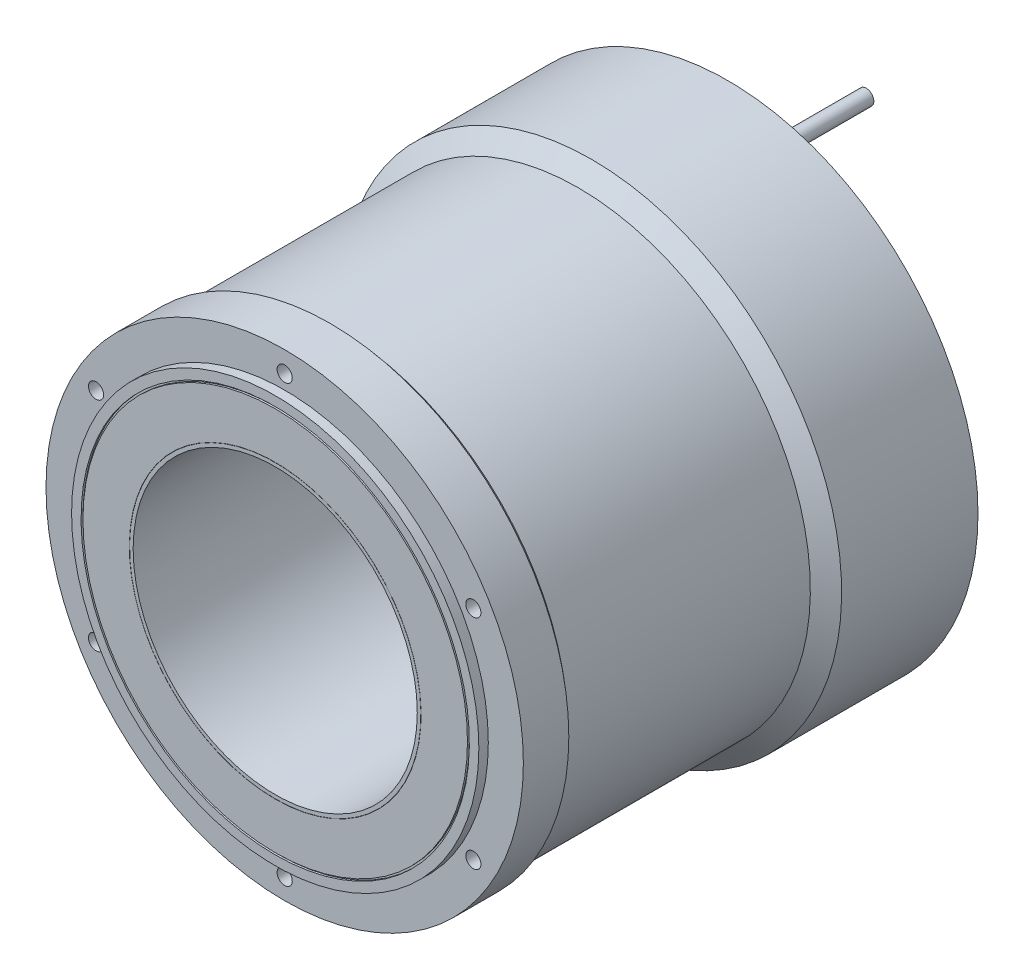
ISO-10303-21;
HEADER;
FILE_DESCRIPTION(('STEP AP214'),'2;1');
FILE_NAME('part.step','',(''),(''),'','','');
FILE_SCHEMA(('AUTOMOTIVE_DESIGN { 1 0 10303 214 1 1 1 1 }'));
ENDSEC;
DATA;
#1=APPLICATION_CONTEXT('core data for automotive mechanical design processes');
#2=APPLICATION_PROTOCOL_DEFINITION('international standard','automotive_design',2000,#1);
#3=PRODUCT_CONTEXT('',#1,'mechanical');
#4=PRODUCT('Part','Part','',(#3));
#5=PRODUCT_RELATED_PRODUCT_CATEGORY('part','',(#4));
#6=PRODUCT_DEFINITION_FORMATION('','',#4);
#7=PRODUCT_DEFINITION_CONTEXT('part definition',#1,'design');
#8=PRODUCT_DEFINITION('design','',#6,#7);
#9=PRODUCT_DEFINITION_SHAPE('','',#8);
#10=(LENGTH_UNIT() NAMED_UNIT(*) SI_UNIT(.MILLI.,.METRE.));
#11=(NAMED_UNIT(*) PLANE_ANGLE_UNIT() SI_UNIT($,.RADIAN.));
#12=(NAMED_UNIT(*) SI_UNIT($,.STERADIAN.) SOLID_ANGLE_UNIT());
#13=UNCERTAINTY_MEASURE_WITH_UNIT(LENGTH_MEASURE(1.E-05),#10,'distance_accuracy_value','');
#14=(GEOMETRIC_REPRESENTATION_CONTEXT(3) GLOBAL_UNCERTAINTY_ASSIGNED_CONTEXT((#13)) GLOBAL_UNIT_ASSIGNED_CONTEXT((#10,
#11,#12)) REPRESENTATION_CONTEXT('',''));
#15=CARTESIAN_POINT('',(0.,0.,0.));
#16=DIRECTION('',(0.,0.,1.));
#17=DIRECTION('',(1.,0.,0.));
#18=AXIS2_PLACEMENT_3D('',#15,#16,#17);
#19=CARTESIAN_POINT('',(-98.111250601,51.970329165,233.));
#20=DIRECTION('',(0.,0.,1.));
#21=DIRECTION('',(0.499999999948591,0.86602540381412,0.));
#22=AXIS2_PLACEMENT_3D('',#19,#20,#21);
#23=PLANE('',#22);
#24=CARTESIAN_POINT('',(-99.592921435,57.5,233.));
#25=DIRECTION('',(0.,0.,1.));
#26=DIRECTION('',(0.,-1.,0.));
#27=AXIS2_PLACEMENT_3D('',#24,#25,#26);
#28=CIRCLE('',#27,4.);
#29=CARTESIAN_POINT('',(-99.592921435,53.5,233.));
#30=VERTEX_POINT('',#29);
#31=EDGE_CURVE('E20',#30,#30,#28,.F.);
#32=ORIENTED_EDGE('',*,*,#31,.F.);
#33=EDGE_LOOP('',(#32));
#34=FACE_BOUND('',#33,.T.);
#35=ADVANCED_FACE('F16',(#34),#23,.T.);
#36=CARTESIAN_POINT('',(-94.063250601,-58.981670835,233.));
#37=DIRECTION('',(0.,0.,1.));
#38=DIRECTION('',(-0.499999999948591,0.86602540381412,0.));
#39=AXIS2_PLACEMENT_3D('',#36,#37,#38);
#40=PLANE('',#39);
#41=CARTESIAN_POINT('',(-99.592921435,-57.5,233.));
#42=DIRECTION('',(0.,0.,1.));
#43=DIRECTION('',(1.,0.,0.));
#44=AXIS2_PLACEMENT_3D('',#41,#42,#43);
#45=CIRCLE('',#44,4.);
#46=CARTESIAN_POINT('',(-95.592921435,-57.5,233.));
#47=VERTEX_POINT('',#46);
#48=EDGE_CURVE('E492',#47,#47,#45,.F.);
#49=ORIENTED_EDGE('',*,*,#48,.F.);
#50=EDGE_LOOP('',(#49));
#51=FACE_BOUND('',#50,.T.);
#52=ADVANCED_FACE('F502',(#51),#40,.T.);
#53=CARTESIAN_POINT('',(4.048,-110.952,233.));
#54=DIRECTION('',(0.,0.,1.));
#55=DIRECTION('',(-1.,0.,0.));
#56=AXIS2_PLACEMENT_3D('',#53,#54,#55);
#57=PLANE('',#56);
#58=CARTESIAN_POINT('',(0.,-115.,233.));
#59=DIRECTION('',(0.,0.,1.));
#60=DIRECTION('',(1.,0.,0.));
#61=AXIS2_PLACEMENT_3D('',#58,#59,#60);
#62=CIRCLE('',#61,4.);
#63=CARTESIAN_POINT('',(4.,-115.,233.));
#64=VERTEX_POINT('',#63);
#65=EDGE_CURVE('E490',#64,#64,#62,.F.);
#66=ORIENTED_EDGE('',*,*,#65,.F.);
#67=EDGE_LOOP('',(#66));
#68=FACE_BOUND('',#67,.T.);
#69=ADVANCED_FACE('F508',(#68),#57,.T.);
#70=CARTESIAN_POINT('',(98.111250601,-51.970329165,233.));
#71=DIRECTION('',(0.,0.,1.));
#72=DIRECTION('',(-0.499999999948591,-0.86602540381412,0.));
#73=AXIS2_PLACEMENT_3D('',#70,#71,#72);
#74=PLANE('',#73);
#75=CARTESIAN_POINT('',(99.592921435,-57.5,233.));
#76=DIRECTION('',(0.,0.,1.));
#77=DIRECTION('',(1.,0.,0.));
#78=AXIS2_PLACEMENT_3D('',#75,#76,#77);
#79=CIRCLE('',#78,4.);
#80=CARTESIAN_POINT('',(103.592921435,-57.5,233.));
#81=VERTEX_POINT('',#80);
#82=EDGE_CURVE('E487',#81,#81,#79,.F.);
#83=ORIENTED_EDGE('',*,*,#82,.F.);
#84=EDGE_LOOP('',(#83));
#85=FACE_BOUND('',#84,.T.);
#86=ADVANCED_FACE('F2398',(#85),#74,.T.);
#87=CARTESIAN_POINT('',(94.063250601,58.981670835,233.));
#88=DIRECTION('',(0.,0.,1.));
#89=DIRECTION('',(0.499999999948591,-0.86602540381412,0.));
#90=AXIS2_PLACEMENT_3D('',#87,#88,#89);
#91=PLANE('',#90);
#92=CARTESIAN_POINT('',(99.592921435,57.5,233.));
#93=DIRECTION('',(0.,0.,1.));
#94=DIRECTION('',(0.,-1.,0.));
#95=AXIS2_PLACEMENT_3D('',#92,#93,#94);
#96=CIRCLE('',#95,4.);
#97=CARTESIAN_POINT('',(99.592921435,53.5,233.));
#98=VERTEX_POINT('',#97);
#99=EDGE_CURVE('E484',#98,#98,#96,.F.);
#100=ORIENTED_EDGE('',*,*,#99,.F.);
#101=EDGE_LOOP('',(#100));
#102=FACE_BOUND('',#101,.T.);
#103=ADVANCED_FACE('F1381',(#102),#91,.T.);
#104=CARTESIAN_POINT('',(-4.048,110.952,233.));
#105=DIRECTION('',(0.,0.,1.));
#106=DIRECTION('',(1.,0.,0.));
#107=AXIS2_PLACEMENT_3D('',#104,#105,#106);
#108=PLANE('',#107);
#109=CARTESIAN_POINT('',(0.,115.,233.));
#110=DIRECTION('',(0.,0.,1.));
#111=DIRECTION('',(0.,-1.,0.));
#112=AXIS2_PLACEMENT_3D('',#109,#110,#111);
#113=CIRCLE('',#112,4.);
#114=CARTESIAN_POINT('',(0.,111.,233.));
#115=VERTEX_POINT('',#114);
#116=EDGE_CURVE('E481',#115,#115,#113,.F.);
#117=ORIENTED_EDGE('',*,*,#116,.F.);
#118=EDGE_LOOP('',(#117));
#119=FACE_BOUND('',#118,.T.);
#120=ADVANCED_FACE('F1376',(#119),#108,.T.);
#121=CARTESIAN_POINT('',(-99.592921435,57.5,233.));
#122=DIRECTION('',(0.,0.,1.));
#123=DIRECTION('',(0.,-1.,0.));
#124=AXIS2_PLACEMENT_3D('',#121,#122,#123);
#125=CYLINDRICAL_SURFACE('',#124,4.);
#126=CARTESIAN_POINT('',(-99.592921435,57.5,245.));
#127=DIRECTION('',(0.,0.,1.));
#128=DIRECTION('',(0.,-1.,0.));
#129=AXIS2_PLACEMENT_3D('',#126,#127,#128);
#130=CIRCLE('',#129,4.);
#131=CARTESIAN_POINT('',(-99.592921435,53.5,245.));
#132=VERTEX_POINT('',#131);
#133=EDGE_CURVE('E475',#132,#132,#130,.F.);
#134=ORIENTED_EDGE('',*,*,#133,.F.);
#135=EDGE_LOOP('',(#134));
#136=FACE_BOUND('',#135,.T.);
#137=ORIENTED_EDGE('',*,*,#31,.T.);
#138=EDGE_LOOP('',(#137));
#139=FACE_BOUND('',#138,.T.);
#140=ADVANCED_FACE('F499',(#136,#139),#125,.F.);
#141=CARTESIAN_POINT('',(-99.592921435,-57.5,233.));
#142=DIRECTION('',(0.,0.,1.));
#143=DIRECTION('',(1.,0.,0.));
#144=AXIS2_PLACEMENT_3D('',#141,#142,#143);
#145=CYLINDRICAL_SURFACE('',#144,4.);
#146=CARTESIAN_POINT('',(-99.592921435,-57.5,245.));
#147=DIRECTION('',(0.,0.,1.));
#148=DIRECTION('',(1.,0.,0.));
#149=AXIS2_PLACEMENT_3D('',#146,#147,#148);
#150=CIRCLE('',#149,4.);
#151=CARTESIAN_POINT('',(-95.592921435,-57.5,245.));
#152=VERTEX_POINT('',#151);
#153=EDGE_CURVE('E472',#152,#152,#150,.F.);
#154=ORIENTED_EDGE('',*,*,#153,.F.);
#155=EDGE_LOOP('',(#154));
#156=FACE_BOUND('',#155,.T.);
#157=ORIENTED_EDGE('',*,*,#48,.T.);
#158=EDGE_LOOP('',(#157));
#159=FACE_BOUND('',#158,.T.);
#160=ADVANCED_FACE('F1371',(#156,#159),#145,.F.);
#161=CARTESIAN_POINT('',(0.,-115.,233.));
#162=DIRECTION('',(0.,0.,1.));
#163=DIRECTION('',(1.,0.,0.));
#164=AXIS2_PLACEMENT_3D('',#161,#162,#163);
#165=CYLINDRICAL_SURFACE('',#164,4.);
#166=CARTESIAN_POINT('',(0.,-115.,245.));
#167=DIRECTION('',(0.,0.,1.));
#168=DIRECTION('',(1.,0.,0.));
#169=AXIS2_PLACEMENT_3D('',#166,#167,#168);
#170=CIRCLE('',#169,4.);
#171=CARTESIAN_POINT('',(4.00000000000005,-115.,245.));
#172=VERTEX_POINT('',#171);
#173=EDGE_CURVE('E469',#172,#172,#170,.F.);
#174=ORIENTED_EDGE('',*,*,#173,.F.);
#175=EDGE_LOOP('',(#174));
#176=FACE_BOUND('',#175,.T.);
#177=ORIENTED_EDGE('',*,*,#65,.T.);
#178=EDGE_LOOP('',(#177));
#179=FACE_BOUND('',#178,.T.);
#180=ADVANCED_FACE('F1367',(#176,#179),#165,.F.);
#181=CARTESIAN_POINT('',(99.592921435,-57.5,233.));
#182=DIRECTION('',(0.,0.,1.));
#183=DIRECTION('',(1.,0.,0.));
#184=AXIS2_PLACEMENT_3D('',#181,#182,#183);
#185=CYLINDRICAL_SURFACE('',#184,4.);
#186=CARTESIAN_POINT('',(99.5929214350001,-57.5,245.));
#187=DIRECTION('',(0.,0.,1.));
#188=DIRECTION('',(1.,0.,0.));
#189=AXIS2_PLACEMENT_3D('',#186,#187,#188);
#190=CIRCLE('',#189,4.);
#191=CARTESIAN_POINT('',(103.592921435,-57.5,245.));
#192=VERTEX_POINT('',#191);
#193=EDGE_CURVE('E466',#192,#192,#190,.F.);
#194=ORIENTED_EDGE('',*,*,#193,.F.);
#195=EDGE_LOOP('',(#194));
#196=FACE_BOUND('',#195,.T.);
#197=ORIENTED_EDGE('',*,*,#82,.T.);
#198=EDGE_LOOP('',(#197));
#199=FACE_BOUND('',#198,.T.);
#200=ADVANCED_FACE('F1363',(#196,#199),#185,.F.);
#201=CARTESIAN_POINT('',(99.592921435,57.5,233.));
#202=DIRECTION('',(0.,0.,1.));
#203=DIRECTION('',(0.,-1.,0.));
#204=AXIS2_PLACEMENT_3D('',#201,#202,#203);
#205=CYLINDRICAL_SURFACE('',#204,4.);
#206=CARTESIAN_POINT('',(99.592921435,57.5,245.));
#207=DIRECTION('',(0.,0.,1.));
#208=DIRECTION('',(0.,-1.,0.));
#209=AXIS2_PLACEMENT_3D('',#206,#207,#208);
#210=CIRCLE('',#209,4.);
#211=CARTESIAN_POINT('',(99.592921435,53.5,245.));
#212=VERTEX_POINT('',#211);
#213=EDGE_CURVE('E463',#212,#212,#210,.F.);
#214=ORIENTED_EDGE('',*,*,#213,.F.);
#215=EDGE_LOOP('',(#214));
#216=FACE_BOUND('',#215,.T.);
#217=ORIENTED_EDGE('',*,*,#99,.T.);
#218=EDGE_LOOP('',(#217));
#219=FACE_BOUND('',#218,.T.);
#220=ADVANCED_FACE('F1359',(#216,#219),#205,.F.);
#221=CARTESIAN_POINT('',(0.,115.,233.));
#222=DIRECTION('',(0.,0.,1.));
#223=DIRECTION('',(0.,-1.,0.));
#224=AXIS2_PLACEMENT_3D('',#221,#222,#223);
#225=CYLINDRICAL_SURFACE('',#224,4.);
#226=CARTESIAN_POINT('',(0.,115.,245.));
#227=DIRECTION('',(0.,0.,1.));
#228=DIRECTION('',(0.,-1.,0.));
#229=AXIS2_PLACEMENT_3D('',#226,#227,#228);
#230=CIRCLE('',#229,4.);
#231=CARTESIAN_POINT('',(0.,111.,245.));
#232=VERTEX_POINT('',#231);
#233=EDGE_CURVE('E460',#232,#232,#230,.F.);
#234=ORIENTED_EDGE('',*,*,#233,.F.);
#235=EDGE_LOOP('',(#234));
#236=FACE_BOUND('',#235,.T.);
#237=ORIENTED_EDGE('',*,*,#116,.T.);
#238=EDGE_LOOP('',(#237));
#239=FACE_BOUND('',#238,.T.);
#240=ADVANCED_FACE('F1355',(#236,#239),#225,.F.);
#241=CARTESIAN_POINT('',(0.,0.,250.));
#242=DIRECTION('',(0.,0.,-1.));
#243=DIRECTION('',(-1.,0.,0.));
#244=AXIS2_PLACEMENT_3D('',#241,#242,#243);
#245=CYLINDRICAL_SURFACE('',#244,107.5);
#246=CARTESIAN_POINT('',(0.,0.,250.));
#247=DIRECTION('',(0.,0.,-1.));
#248=DIRECTION('',(-1.,0.,0.));
#249=AXIS2_PLACEMENT_3D('',#246,#247,#248);
#250=CIRCLE('',#249,107.5);
#251=CARTESIAN_POINT('',(-107.5,0.,250.));
#252=VERTEX_POINT('',#251);
#253=EDGE_CURVE('E478',#252,#252,#250,.F.);
#254=ORIENTED_EDGE('',*,*,#253,.F.);
#255=EDGE_LOOP('',(#254));
#256=FACE_BOUND('',#255,.T.);
#257=CARTESIAN_POINT('',(0.,0.,245.));
#258=DIRECTION('',(0.,0.,-1.));
#259=DIRECTION('',(-1.,0.,0.));
#260=AXIS2_PLACEMENT_3D('',#257,#258,#259);
#261=CIRCLE('',#260,107.5);
#262=CARTESIAN_POINT('',(-107.5,0.,245.));
#263=VERTEX_POINT('',#262);
#264=EDGE_CURVE('E457',#263,#263,#261,.T.);
#265=ORIENTED_EDGE('',*,*,#264,.F.);
#266=EDGE_LOOP('',(#265));
#267=FACE_BOUND('',#266,.T.);
#268=ADVANCED_FACE('F1351',(#256,#267),#245,.T.);
#269=CARTESIAN_POINT('',(-108.79,108.79,250.));
#270=DIRECTION('',(0.,0.,1.));
#271=DIRECTION('',(0.,-1.,0.));
#272=AXIS2_PLACEMENT_3D('',#269,#270,#271);
#273=PLANE('',#272);
#274=CARTESIAN_POINT('',(0.,0.,250.));
#275=DIRECTION('',(0.,0.,1.));
#276=DIRECTION('',(0.,-1.,0.));
#277=AXIS2_PLACEMENT_3D('',#274,#275,#276);
#278=CIRCLE('',#277,102.5);
#279=CARTESIAN_POINT('',(0.,-102.5,250.));
#280=VERTEX_POINT('',#279);
#281=EDGE_CURVE('E454',#280,#280,#278,.T.);
#282=ORIENTED_EDGE('',*,*,#281,.F.);
#283=EDGE_LOOP('',(#282));
#284=FACE_BOUND('',#283,.T.);
#285=ORIENTED_EDGE('',*,*,#253,.T.);
#286=EDGE_LOOP('',(#285));
#287=FACE_BOUND('',#286,.T.);
#288=ADVANCED_FACE('F1354',(#284,#287),#273,.T.);
#289=CARTESIAN_POINT('',(-127.512,127.512,245.));
#290=DIRECTION('',(0.,0.,1.));
#291=DIRECTION('',(0.,-1.,0.));
#292=AXIS2_PLACEMENT_3D('',#289,#290,#291);
#293=PLANE('',#292);
#294=ORIENTED_EDGE('',*,*,#264,.T.);
#295=EDGE_LOOP('',(#294));
#296=FACE_BOUND('',#295,.T.);
#297=ORIENTED_EDGE('',*,*,#233,.T.);
#298=EDGE_LOOP('',(#297));
#299=FACE_BOUND('',#298,.T.);
#300=ORIENTED_EDGE('',*,*,#213,.T.);
#301=EDGE_LOOP('',(#300));
#302=FACE_BOUND('',#301,.T.);
#303=ORIENTED_EDGE('',*,*,#193,.T.);
#304=EDGE_LOOP('',(#303));
#305=FACE_BOUND('',#304,.T.);
#306=ORIENTED_EDGE('',*,*,#173,.T.);
#307=EDGE_LOOP('',(#306));
#308=FACE_BOUND('',#307,.T.);
#309=ORIENTED_EDGE('',*,*,#153,.T.);
#310=EDGE_LOOP('',(#309));
#311=FACE_BOUND('',#310,.T.);
#312=ORIENTED_EDGE('',*,*,#133,.T.);
#313=EDGE_LOOP('',(#312));
#314=FACE_BOUND('',#313,.T.);
#315=CARTESIAN_POINT('',(0.,0.,245.));
#316=DIRECTION('',(0.,0.,-1.));
#317=DIRECTION('',(-1.,0.,0.));
#318=AXIS2_PLACEMENT_3D('',#315,#316,#317);
#319=CIRCLE('',#318,126.);
#320=CARTESIAN_POINT('',(-126.,0.,245.));
#321=VERTEX_POINT('',#320);
#322=EDGE_CURVE('E451',#321,#321,#319,.F.);
#323=ORIENTED_EDGE('',*,*,#322,.T.);
#324=EDGE_LOOP('',(#323));
#325=FACE_BOUND('',#324,.T.);
#326=ADVANCED_FACE('F1349',(#296,#299,#302,#305,#308,#311,#314,#325),#293,.T.);
#327=CARTESIAN_POINT('',(0.,0.,249.));
#328=DIRECTION('',(0.,0.,1.));
#329=DIRECTION('',(0.,-1.,0.));
#330=AXIS2_PLACEMENT_3D('',#327,#328,#329);
#331=CYLINDRICAL_SURFACE('',#330,102.5);
#332=ORIENTED_EDGE('',*,*,#281,.T.);
#333=EDGE_LOOP('',(#332));
#334=FACE_BOUND('',#333,.T.);
#335=CARTESIAN_POINT('',(0.,0.,249.));
#336=DIRECTION('',(0.,0.,1.));
#337=DIRECTION('',(0.,-1.,0.));
#338=AXIS2_PLACEMENT_3D('',#335,#336,#337);
#339=CIRCLE('',#338,102.5);
#340=CARTESIAN_POINT('',(0.,-102.5,249.));
#341=VERTEX_POINT('',#340);
#342=EDGE_CURVE('E448',#341,#341,#339,.T.);
#343=ORIENTED_EDGE('',*,*,#342,.F.);
#344=EDGE_LOOP('',(#343));
#345=FACE_BOUND('',#344,.T.);
#346=ADVANCED_FACE('F1345',(#334,#345),#331,.F.);
#347=CARTESIAN_POINT('',(0.,0.,245.));
#348=DIRECTION('',(0.,0.,-1.));
#349=DIRECTION('',(-1.,0.,0.));
#350=AXIS2_PLACEMENT_3D('',#347,#348,#349);
#351=CYLINDRICAL_SURFACE('',#350,126.);
#352=ORIENTED_EDGE('',*,*,#322,.F.);
#353=EDGE_LOOP('',(#352));
#354=FACE_BOUND('',#353,.T.);
#355=CARTESIAN_POINT('',(0.,0.,221.));
#356=DIRECTION('',(0.,0.,1.));
#357=DIRECTION('',(0.,-1.,0.));
#358=AXIS2_PLACEMENT_3D('',#355,#356,#357);
#359=CIRCLE('',#358,126.);
#360=CARTESIAN_POINT('',(0.,-126.,221.));
#361=VERTEX_POINT('',#360);
#362=EDGE_CURVE('E447',#361,#361,#359,.T.);
#363=ORIENTED_EDGE('',*,*,#362,.T.);
#364=EDGE_LOOP('',(#363));
#365=FACE_BOUND('',#364,.T.);
#366=ADVANCED_FACE('F1342',(#354,#365),#351,.T.);
#367=CARTESIAN_POINT('',(-103.73,-103.73,249.));
#368=DIRECTION('',(0.,0.,1.));
#369=DIRECTION('',(1.,0.,0.));
#370=AXIS2_PLACEMENT_3D('',#367,#368,#369);
#371=PLANE('',#370);
#372=CARTESIAN_POINT('',(0.,0.,249.));
#373=DIRECTION('',(0.,0.,1.));
#374=DIRECTION('',(0.,-1.,0.));
#375=AXIS2_PLACEMENT_3D('',#372,#373,#374);
#376=CIRCLE('',#375,101.5);
#377=CARTESIAN_POINT('',(0.,-101.5,249.));
#378=VERTEX_POINT('',#377);
#379=EDGE_CURVE('E444',#378,#378,#376,.F.);
#380=ORIENTED_EDGE('',*,*,#379,.T.);
#381=EDGE_LOOP('',(#380));
#382=FACE_BOUND('',#381,.T.);
#383=ORIENTED_EDGE('',*,*,#342,.T.);
#384=EDGE_LOOP('',(#383));
#385=FACE_BOUND('',#384,.T.);
#386=ADVANCED_FACE('F1337',(#382,#385),#371,.T.);
#387=CARTESIAN_POINT('',(0.,0.,218.));
#388=DIRECTION('',(0.,0.,1.));
#389=DIRECTION('',(1.,0.,0.));
#390=AXIS2_PLACEMENT_3D('',#387,#388,#389);
#391=CONICAL_SURFACE('',#390,122.5,0.862170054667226);
#392=CARTESIAN_POINT('',(0.,0.,218.));
#393=DIRECTION('',(0.,0.,-1.));
#394=DIRECTION('',(0.,1.,0.));
#395=AXIS2_PLACEMENT_3D('',#392,#393,#394);
#396=CIRCLE('',#395,122.5);
#397=CARTESIAN_POINT('',(0.,122.5,218.));
#398=VERTEX_POINT('',#397);
#399=EDGE_CURVE('E443',#398,#398,#396,.F.);
#400=ORIENTED_EDGE('',*,*,#399,.T.);
#401=EDGE_LOOP('',(#400));
#402=FACE_BOUND('',#401,.T.);
#403=ORIENTED_EDGE('',*,*,#362,.F.);
#404=EDGE_LOOP('',(#403));
#405=FACE_BOUND('',#404,.T.);
#406=ADVANCED_FACE('F1331',(#402,#405),#391,.T.);
#407=CARTESIAN_POINT('',(0.,0.,249.));
#408=DIRECTION('',(0.,0.,1.));
#409=DIRECTION('',(0.,-1.,0.));
#410=AXIS2_PLACEMENT_3D('',#407,#408,#409);
#411=CYLINDRICAL_SURFACE('',#410,101.5);
#412=ORIENTED_EDGE('',*,*,#379,.F.);
#413=EDGE_LOOP('',(#412));
#414=FACE_BOUND('',#413,.T.);
#415=CARTESIAN_POINT('',(0.,0.,250.));
#416=DIRECTION('',(0.,0.,1.));
#417=DIRECTION('',(0.,-1.,0.));
#418=AXIS2_PLACEMENT_3D('',#415,#416,#417);
#419=CIRCLE('',#418,101.5);
#420=CARTESIAN_POINT('',(0.,-101.5,250.));
#421=VERTEX_POINT('',#420);
#422=EDGE_CURVE('E420',#421,#421,#419,.T.);
#423=ORIENTED_EDGE('',*,*,#422,.F.);
#424=EDGE_LOOP('',(#423));
#425=FACE_BOUND('',#424,.T.);
#426=ADVANCED_FACE('F1329',(#414,#425),#411,.T.);
#427=CARTESIAN_POINT('',(0.,0.,43.));
#428=DIRECTION('',(0.,0.,-1.));
#429=DIRECTION('',(-1.,0.,0.));
#430=AXIS2_PLACEMENT_3D('',#427,#428,#429);
#431=CYLINDRICAL_SURFACE('',#430,132.1);
#432=DIRECTION('',(0.,0.,1.));
#433=VECTOR('',#432,1.);
#434=CARTESIAN_POINT('',(-127.09227207,36.027272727,33.));
#435=LINE('',#434,#433);
#436=CARTESIAN_POINT('',(-127.092272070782,36.0272727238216,23.));
#437=VERTEX_POINT('',#436);
#438=CARTESIAN_POINT('',(-127.09227206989,36.0272727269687,43.));
#439=VERTEX_POINT('',#438);
#440=EDGE_CURVE('E434',#437,#439,#435,.T.);
#441=ORIENTED_EDGE('',*,*,#440,.F.);
#442=CARTESIAN_POINT('',(0.,0.,23.));
#443=DIRECTION('',(0.,0.,-1.));
#444=DIRECTION('',(-1.,0.,0.));
#445=AXIS2_PLACEMENT_3D('',#442,#443,#444);
#446=CIRCLE('',#445,132.1);
#447=CARTESIAN_POINT('',(-132.076305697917,2.50189393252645,23.));
#448=VERTEX_POINT('',#447);
#449=EDGE_CURVE('E416',#448,#437,#446,.T.);
#450=ORIENTED_EDGE('',*,*,#449,.F.);
#451=DIRECTION('',(0.,0.,1.));
#452=VECTOR('',#451,1.);
#453=CARTESIAN_POINT('',(-132.076305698,2.50189394,33.));
#454=LINE('',#453,#452);
#455=CARTESIAN_POINT('',(-132.076305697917,2.50189393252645,43.));
#456=VERTEX_POINT('',#455);
#457=EDGE_CURVE('E409',#448,#456,#454,.T.);
#458=ORIENTED_EDGE('',*,*,#457,.T.);
#459=CARTESIAN_POINT('',(0.,0.,43.));
#460=DIRECTION('',(0.,0.,-1.));
#461=DIRECTION('',(-1.,0.,0.));
#462=AXIS2_PLACEMENT_3D('',#459,#460,#461);
#463=CIRCLE('',#462,132.1);
#464=EDGE_CURVE('E413',#439,#456,#463,.F.);
#465=ORIENTED_EDGE('',*,*,#464,.F.);
#466=EDGE_LOOP('',(#441,#450,#458,#465));
#467=FACE_BOUND('',#466,.T.);
#468=ADVANCED_FACE('F411',(#467),#431,.T.);
#469=CARTESIAN_POINT('',(0.,0.,40.303698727));
#470=DIRECTION('',(0.,0.,-1.));
#471=DIRECTION('',(-1.,0.,0.));
#472=AXIS2_PLACEMENT_3D('',#469,#470,#471);
#473=CYLINDRICAL_SURFACE('',#472,132.1);
#474=CARTESIAN_POINT('',(-129.451425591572,-26.3199242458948,23.));
#475=CARTESIAN_POINT('',(-129.444691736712,-26.3530441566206,23.0000018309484));
#476=CARTESIAN_POINT('',(-129.437949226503,-26.3861409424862,23.0013710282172));
#477=CARTESIAN_POINT('',(-129.424470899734,-26.4521732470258,23.0068407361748));
#478=CARTESIAN_POINT('',(-129.417735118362,-26.4851083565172,23.0109462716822));
#479=CARTESIAN_POINT('',(-129.397455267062,-26.5840764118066,23.0274819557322));
#480=CARTESIAN_POINT('',(-129.383997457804,-26.6494913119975,23.0441316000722));
#481=CARTESIAN_POINT('',(-129.364307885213,-26.744848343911,23.0771318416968));
#482=CARTESIAN_POINT('',(-129.357823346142,-26.7761933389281,23.0894805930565));
#483=CARTESIAN_POINT('',(-129.345055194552,-26.8378032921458,23.1167926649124));
#484=CARTESIAN_POINT('',(-129.338771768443,-26.8680672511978,23.1317583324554));
#485=CARTESIAN_POINT('',(-129.320057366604,-26.9580517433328,23.1811135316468));
#486=CARTESIAN_POINT('',(-129.308021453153,-27.0157105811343,23.2195299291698));
#487=CARTESIAN_POINT('',(-129.285408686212,-27.1237194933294,23.3058270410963));
#488=CARTESIAN_POINT('',(-129.274831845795,-27.1740695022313,23.3537078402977));
#489=CARTESIAN_POINT('',(-129.255641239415,-27.2652038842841,23.456803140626));
#490=CARTESIAN_POINT('',(-129.246997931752,-27.3061325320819,23.5118834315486));
#491=CARTESIAN_POINT('',(-129.235590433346,-27.3600530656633,23.5992111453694));
#492=CARTESIAN_POINT('',(-129.232047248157,-27.3767824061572,23.6291079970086));
#493=CARTESIAN_POINT('',(-129.225499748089,-27.4076715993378,23.6903025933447));
#494=CARTESIAN_POINT('',(-129.222496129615,-27.4218281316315,23.7216020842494));
#495=CARTESIAN_POINT('',(-129.214480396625,-27.4595834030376,23.8157364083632));
#496=CARTESIAN_POINT('',(-129.210275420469,-27.4793549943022,23.8802484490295));
#497=CARTESIAN_POINT('',(-129.205723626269,-27.5007459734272,23.9787786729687));
#498=CARTESIAN_POINT('',(-129.204498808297,-27.5064993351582,24.0119320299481));
#499=CARTESIAN_POINT('',(-129.202650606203,-27.5151794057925,24.0786202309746));
#500=CARTESIAN_POINT('',(-129.202026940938,-27.5181074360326,24.1121548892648));
#501=CARTESIAN_POINT('',(-129.201386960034,-27.5211120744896,24.1788149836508));
#502=CARTESIAN_POINT('',(-129.201361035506,-27.5212337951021,24.2119383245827));
#503=CARTESIAN_POINT('',(-129.201891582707,-27.5187429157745,24.278038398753));
#504=CARTESIAN_POINT('',(-129.202447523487,-27.5161328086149,24.3110152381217));
#505=CARTESIAN_POINT('',(-129.204985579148,-27.5042138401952,24.409452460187));
#506=CARTESIAN_POINT('',(-129.207837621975,-27.4908177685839,24.4744519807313));
#507=CARTESIAN_POINT('',(-129.215000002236,-27.457130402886,24.589199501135));
#508=CARTESIAN_POINT('',(-129.218933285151,-27.4386187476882,24.6395098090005));
#509=CARTESIAN_POINT('',(-129.228154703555,-27.3951546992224,24.7370719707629));
#510=CARTESIAN_POINT('',(-129.23344142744,-27.3702090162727,24.7843269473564));
#511=CARTESIAN_POINT('',(-129.239361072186,-27.3422301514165,24.8296604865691));
#512=B_SPLINE_CURVE_WITH_KNOTS('',3,(#474,#475,#476,#477,#478,#479,#480,#481,#482,#483,#484,
#485,#486,#487,#488,#489,#490,#491,#492,#493,#494,#495,#496,#497,#498,#499,#500,#501,#502,#503,
#504,#505,#506,#507,#508,#509,#510,#511),.UNSPECIFIED.,.F.,.F.,(4,2,2,2,2,2,2,2,2,2,2,2,2,2,2,2,
2,2,4),(0.,0.101323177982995,0.202832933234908,0.408215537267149,0.511045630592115,
0.613968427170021,0.823817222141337,1.03366789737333,1.2400520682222,1.3432637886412,
1.44660777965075,1.6482526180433,1.74917147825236,1.85004311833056,1.9492920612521,
2.04845051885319,2.24667125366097,2.40746273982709,2.56808720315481),.UNSPECIFIED.);
#513=CARTESIAN_POINT('',(-129.451425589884,-26.319924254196,23.));
#514=VERTEX_POINT('',#513);
#515=CARTESIAN_POINT('',(-129.239361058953,-27.3422302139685,24.8296603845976));
#516=VERTEX_POINT('',#515);
#517=EDGE_CURVE('E849',#514,#516,#512,.T.);
#518=ORIENTED_EDGE('',*,*,#517,.T.);
#519=CARTESIAN_POINT('',(-130.674209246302,-19.3561627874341,37.7760698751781));
#520=CARTESIAN_POINT('',(-130.669039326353,-19.3910651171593,37.7194888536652));
#521=CARTESIAN_POINT('',(-130.663855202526,-19.4259668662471,37.6629087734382));
#522=CARTESIAN_POINT('',(-130.637863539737,-19.600472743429,37.3800130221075));
#523=CARTESIAN_POINT('',(-130.616842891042,-19.7400681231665,37.1537115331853));
#524=CARTESIAN_POINT('',(-130.510601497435,-20.438000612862,36.0222760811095));
#525=CARTESIAN_POINT('',(-130.421967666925,-20.9961952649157,35.1173730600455));
#526=CARTESIAN_POINT('',(-130.169971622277,-22.5199164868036,32.6472312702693));
#527=CARTESIAN_POINT('',(-129.999320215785,-23.4851130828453,31.0825274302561));
#528=CARTESIAN_POINT('',(-129.635939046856,-25.4144998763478,27.9547512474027));
#529=CARTESIAN_POINT('',(-129.443206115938,-26.3786899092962,26.3916791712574));
#530=CARTESIAN_POINT('',(-129.239361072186,-27.3422301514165,24.8296604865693));
#531=B_SPLINE_CURVE_WITH_KNOTS('',3,(#519,#520,#521,#522,#523,#524,#525,#526,#527,#528,#529,
#530),.UNSPECIFIED.,.F.,.F.,(4,2,2,2,2,4),(0.,0.200042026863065,1.00021040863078,
4.20090157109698,9.73982612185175,15.2795464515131),.UNSPECIFIED.);
#532=CARTESIAN_POINT('',(-130.674209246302,-19.356162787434,37.7760698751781));
#533=VERTEX_POINT('',#532);
#534=EDGE_CURVE('E843',#533,#516,#531,.T.);
#535=ORIENTED_EDGE('',*,*,#534,.F.);
#536=CARTESIAN_POINT('',(-130.674209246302,-19.356162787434,37.7760698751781));
#537=CARTESIAN_POINT('',(-130.679429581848,-19.3209196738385,37.8332156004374));
#538=CARTESIAN_POINT('',(-130.684801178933,-19.2845577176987,37.8896698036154));
#539=CARTESIAN_POINT('',(-130.70138833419,-19.1719293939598,38.0571994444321));
#540=CARTESIAN_POINT('',(-130.713041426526,-19.0923539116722,38.1660279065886));
#541=CARTESIAN_POINT('',(-130.737408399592,-18.9247775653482,38.3769456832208));
#542=CARTESIAN_POINT('',(-130.750122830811,-18.8367723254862,38.4790314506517));
#543=CARTESIAN_POINT('',(-130.776458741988,-18.6530547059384,38.6758504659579));
#544=CARTESIAN_POINT('',(-130.790080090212,-18.5573434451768,38.7705847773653));
#545=CARTESIAN_POINT('',(-130.818082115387,-18.3589059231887,38.9521989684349));
#546=CARTESIAN_POINT('',(-130.832462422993,-18.2561830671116,39.0390826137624));
#547=CARTESIAN_POINT('',(-130.85449205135,-18.0973687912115,39.162901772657));
#548=CARTESIAN_POINT('',(-130.861901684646,-18.0437164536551,39.2030416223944));
#549=CARTESIAN_POINT('',(-130.876862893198,-17.9348760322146,39.2811555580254));
#550=CARTESIAN_POINT('',(-130.884414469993,-17.8796879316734,39.3191296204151));
#551=CARTESIAN_POINT('',(-130.907297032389,-17.7116451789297,39.4299240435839));
#552=CARTESIAN_POINT('',(-130.922817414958,-17.5965887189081,39.4994010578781));
#553=CARTESIAN_POINT('',(-130.954209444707,-17.361426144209,39.6292184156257));
#554=CARTESIAN_POINT('',(-130.970081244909,-17.2413178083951,39.6895546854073));
#555=CARTESIAN_POINT('',(-131.002052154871,-16.9966920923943,39.8004941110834));
#556=CARTESIAN_POINT('',(-131.018151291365,-16.8721741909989,39.8510961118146));
#557=CARTESIAN_POINT('',(-131.050432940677,-16.6195734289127,39.9422036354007));
#558=CARTESIAN_POINT('',(-131.066615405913,-16.4914924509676,39.9827143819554));
#559=CARTESIAN_POINT('',(-131.090826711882,-16.2975271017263,40.0358729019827));
#560=CARTESIAN_POINT('',(-131.098875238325,-16.2326591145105,40.0523063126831));
#561=CARTESIAN_POINT('',(-131.114949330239,-16.1023096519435,40.0826481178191));
#562=CARTESIAN_POINT('',(-131.12297488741,-16.0368279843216,40.0965556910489));
#563=CARTESIAN_POINT('',(-131.147225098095,-15.8377201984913,40.1347477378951));
#564=CARTESIAN_POINT('',(-131.163391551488,-15.7032863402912,40.1549900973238));
#565=CARTESIAN_POINT('',(-131.195452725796,-15.4331365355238,40.184558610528));
#566=CARTESIAN_POINT('',(-131.211347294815,-15.2974199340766,40.1938788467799));
#567=CARTESIAN_POINT('',(-131.242779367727,-15.0253668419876,40.2018017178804));
#568=CARTESIAN_POINT('',(-131.258316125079,-14.8890296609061,40.2003836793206));
#569=CARTESIAN_POINT('',(-131.288904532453,-14.6168498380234,40.1866645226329));
#570=CARTESIAN_POINT('',(-131.303956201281,-14.4810071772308,40.1743638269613));
#571=CARTESIAN_POINT('',(-131.333481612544,-14.2107383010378,40.1388374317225));
#572=CARTESIAN_POINT('',(-131.347955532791,-14.0763116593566,40.115615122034));
#573=CARTESIAN_POINT('',(-131.376259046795,-13.8096538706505,40.0585104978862));
#574=CARTESIAN_POINT('',(-131.390088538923,-13.6774230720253,40.0246265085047));
#575=CARTESIAN_POINT('',(-131.417020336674,-13.4161836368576,39.9465013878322));
#576=CARTESIAN_POINT('',(-131.430123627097,-13.2871707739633,39.9022747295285));
#577=CARTESIAN_POINT('',(-131.455559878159,-13.0331143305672,39.8035052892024));
#578=CARTESIAN_POINT('',(-131.467893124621,-12.9080692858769,39.7489663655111));
#579=CARTESIAN_POINT('',(-131.486033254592,-12.7215244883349,39.6585338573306));
#580=CARTESIAN_POINT('',(-131.492135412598,-12.6582887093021,39.6262296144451));
#581=CARTESIAN_POINT('',(-131.504117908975,-12.5331927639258,39.5590425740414));
#582=CARTESIAN_POINT('',(-131.509998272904,-12.471332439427,39.5241600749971));
#583=CARTESIAN_POINT('',(-131.527289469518,-12.2880898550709,39.4157546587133));
#584=CARTESIAN_POINT('',(-131.538364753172,-12.1688981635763,39.3384021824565));
#585=CARTESIAN_POINT('',(-131.55425464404,-11.995476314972,39.2151917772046));
#586=CARTESIAN_POINT('',(-131.55942404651,-11.9386390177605,39.1729886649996));
#587=CARTESIAN_POINT('',(-131.569529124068,-11.8267560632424,39.0862212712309));
#588=CARTESIAN_POINT('',(-131.574464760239,-11.7717107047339,39.0416565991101));
#589=CARTESIAN_POINT('',(-131.588325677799,-11.6160638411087,38.910179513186));
#590=CARTESIAN_POINT('',(-131.59695438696,-11.517839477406,38.8203991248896));
#591=CARTESIAN_POINT('',(-131.613383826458,-11.3285575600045,38.6335007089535));
#592=CARTESIAN_POINT('',(-131.62118455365,-11.2375000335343,38.536382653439));
#593=CARTESIAN_POINT('',(-131.63233308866,-11.1058942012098,38.3843978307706));
#594=CARTESIAN_POINT('',(-131.635994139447,-11.0624075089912,38.3320751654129));
#595=CARTESIAN_POINT('',(-131.643094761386,-10.9775867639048,38.2257183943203));
#596=CARTESIAN_POINT('',(-131.646534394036,-10.9362521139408,38.1716847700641));
#597=CARTESIAN_POINT('',(-131.653215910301,-10.8555236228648,38.0616280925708));
#598=CARTESIAN_POINT('',(-131.656456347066,-10.8161443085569,38.0055943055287));
#599=CARTESIAN_POINT('',(-131.662718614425,-10.7396460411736,37.8919692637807));
#600=CARTESIAN_POINT('',(-131.665740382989,-10.7025277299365,37.8343775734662));
#601=CARTESIAN_POINT('',(-131.668653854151,-10.6665642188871,37.7760694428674));
#602=B_SPLINE_CURVE_WITH_KNOTS('',3,(#536,#537,#538,#539,#540,#541,#542,#543,#544,#545,#546,
#547,#548,#549,#550,#551,#552,#553,#554,#555,#556,#557,#558,#559,#560,#561,#562,#563,#564,#565,
#566,#567,#568,#569,#570,#571,#572,#573,#574,#575,#576,#577,#578,#579,#580,#581,#582,#583,#584,
#585,#586,#587,#588,#589,#590,#591,#592,#593,#594,#595,#596,#597,#598,#599,#600,#601),
.UNSPECIFIED.,.F.,.F.,(4,2,2,2,2,2,2,2,2,2,2,2,2,2,2,2,2,2,2,2,2,2,2,2,2,2,2,2,2,2,2,2,4),(0.,
0.202039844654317,0.607544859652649,1.01326152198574,1.41891937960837,1.82438161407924,
2.0265784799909,2.22877753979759,2.63423112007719,3.03986486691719,3.44554672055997,
3.85101813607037,4.0531742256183,4.25539592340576,4.66563762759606,5.07610149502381,
5.48735579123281,5.89859412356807,6.30970489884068,6.7208802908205,7.13148371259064,
7.54193381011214,7.75569291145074,7.96942730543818,8.39640286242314,8.60929640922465,
8.82222527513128,9.22186310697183,9.62150245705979,9.82585455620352,10.030149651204,
10.2357862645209,10.4414809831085),.UNSPECIFIED.);
#603=CARTESIAN_POINT('',(-131.668653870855,-10.6665640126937,37.7760691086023));
#604=VERTEX_POINT('',#603);
#605=EDGE_CURVE('E874',#533,#604,#602,.T.);
#606=ORIENTED_EDGE('',*,*,#605,.T.);
#607=CARTESIAN_POINT('',(-132.072801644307,-2.68049730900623,24.829660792));
#608=CARTESIAN_POINT('',(-132.072091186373,-2.71550280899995,24.8864090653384));
#609=CARTESIAN_POINT('',(-132.071366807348,-2.75050823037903,24.9431572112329));
#610=CARTESIAN_POINT('',(-132.067675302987,-2.92553497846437,25.226897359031));
#611=CARTESIAN_POINT('',(-132.06449935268,-3.06555509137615,25.4538873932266));
#612=CARTESIAN_POINT('',(-132.047505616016,-3.76565137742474,26.5888306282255));
#613=CARTESIAN_POINT('',(-132.030346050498,-4.32570591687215,27.4967487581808));
#614=CARTESIAN_POINT('',(-131.973952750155,-5.84943350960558,29.9669008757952));
#615=CARTESIAN_POINT('',(-131.927723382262,-6.81303717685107,31.5290223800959));
#616=CARTESIAN_POINT('',(-131.814086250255,-8.74002849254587,34.652915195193));
#617=CARTESIAN_POINT('',(-131.746675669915,-9.70341609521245,36.2146864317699));
#618=CARTESIAN_POINT('',(-131.668653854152,-10.6665642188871,37.7760694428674));
#619=B_SPLINE_CURVE_WITH_KNOTS('',3,(#607,#608,#609,#610,#611,#612,#613,#614,#615,#616,#617,
#618),.UNSPECIFIED.,.F.,.F.,(4,2,2,2,2,4),(0.,0.200040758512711,1.0002040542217,
4.20087399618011,9.70874375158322,15.2173461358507),.UNSPECIFIED.);
#620=CARTESIAN_POINT('',(-132.072801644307,-2.68049730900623,24.829660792));
#621=VERTEX_POINT('',#620);
#622=EDGE_CURVE('E823',#621,#604,#619,.T.);
#623=ORIENTED_EDGE('',*,*,#622,.F.);
#624=CARTESIAN_POINT('',(-132.072801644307,-2.68049730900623,24.829660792));
#625=CARTESIAN_POINT('',(-132.073161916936,-2.66274375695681,24.8009060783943));
#626=CARTESIAN_POINT('',(-132.073494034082,-2.64620545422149,24.7713981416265));
#627=CARTESIAN_POINT('',(-132.07410258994,-2.61565712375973,24.711034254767));
#628=CARTESIAN_POINT('',(-132.074378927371,-2.60165169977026,24.6801759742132));
#629=CARTESIAN_POINT('',(-132.074875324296,-2.57632843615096,24.6173667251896));
#630=CARTESIAN_POINT('',(-132.075095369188,-2.56501129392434,24.5854154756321));
#631=CARTESIAN_POINT('',(-132.075481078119,-2.54507310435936,24.5206790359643));
#632=CARTESIAN_POINT('',(-132.075646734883,-2.5364524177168,24.4878937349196));
#633=CARTESIAN_POINT('',(-132.075923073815,-2.52202242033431,24.421680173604));
#634=CARTESIAN_POINT('',(-132.076033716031,-2.51621515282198,24.3882514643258));
#635=CARTESIAN_POINT('',(-132.07619970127,-2.50748673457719,24.3210156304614));
#636=CARTESIAN_POINT('',(-132.076255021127,-2.50456679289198,24.2872083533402));
#637=CARTESIAN_POINT('',(-132.076339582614,-2.50010902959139,24.1860259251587));
#638=CARTESIAN_POINT('',(-132.076289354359,-2.50277141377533,24.118414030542));
#639=CARTESIAN_POINT('',(-132.075972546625,-2.51943255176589,23.984630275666));
#640=CARTESIAN_POINT('',(-132.07570595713,-2.53343183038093,23.9184584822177));
#641=CARTESIAN_POINT('',(-132.0749533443,-2.57236787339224,23.7893231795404));
#642=CARTESIAN_POINT('',(-132.074467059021,-2.59731769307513,23.7263636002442));
#643=CARTESIAN_POINT('',(-132.073271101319,-2.6574348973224,23.6055244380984));
#644=CARTESIAN_POINT('',(-132.072561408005,-2.69260323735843,23.547645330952));
#645=CARTESIAN_POINT('',(-132.070916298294,-2.77211864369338,23.4386813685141));
#646=CARTESIAN_POINT('',(-132.069981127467,-2.81645571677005,23.3875892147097));
#647=CARTESIAN_POINT('',(-132.067886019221,-2.91304157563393,23.2935406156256));
#648=CARTESIAN_POINT('',(-132.066726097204,-2.96528981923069,23.2505836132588));
#649=CARTESIAN_POINT('',(-132.064184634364,-3.07639836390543,23.173952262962));
#650=CARTESIAN_POINT('',(-132.062802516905,-3.13527574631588,23.1403027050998));
#651=CARTESIAN_POINT('',(-132.059835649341,-3.25784619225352,23.0833835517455));
#652=CARTESIAN_POINT('',(-132.058250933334,-3.32153844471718,23.0601122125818));
#653=CARTESIAN_POINT('',(-132.055259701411,-3.43817243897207,23.0283137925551));
#654=CARTESIAN_POINT('',(-132.053885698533,-3.49056134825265,23.0177161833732));
#655=CARTESIAN_POINT('',(-132.051050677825,-3.5962278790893,23.0035550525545));
#656=CARTESIAN_POINT('',(-132.049589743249,-3.64950461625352,22.9999849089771));
#657=CARTESIAN_POINT('',(-132.048094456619,-3.70280304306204,23.));
#658=B_SPLINE_CURVE_WITH_KNOTS('',3,(#624,#625,#626,#627,#628,#629,#630,#631,#632,#633,#634,
#635,#636,#637,#638,#639,#640,#641,#642,#643,#644,#645,#646,#647,#648,#649,#650,#651,#652,#653,
#654,#655,#656,#657),.UNSPECIFIED.,.F.,.F.,(4,2,2,2,2,2,2,2,2,2,2,2,2,2,2,2,4),(0.,
0.101361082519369,0.202904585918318,0.304474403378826,0.406057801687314,0.507714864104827,
0.609414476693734,0.811371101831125,1.01333707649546,1.21554449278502,1.4177708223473,
1.61977789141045,1.8217711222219,2.02429728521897,2.22678940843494,2.38673780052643,
2.54653540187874),.UNSPECIFIED.);
#659=CARTESIAN_POINT('',(-132.048094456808,-3.70280303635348,23.));
#660=VERTEX_POINT('',#659);
#661=EDGE_CURVE('E815',#621,#660,#658,.T.);
#662=ORIENTED_EDGE('',*,*,#661,.T.);
#663=CARTESIAN_POINT('',(0.,0.,23.));
#664=DIRECTION('',(0.,0.,-1.));
#665=DIRECTION('',(-1.,0.,0.));
#666=AXIS2_PLACEMENT_3D('',#663,#664,#665);
#667=CIRCLE('',#666,132.1);
#668=EDGE_CURVE('E855',#514,#660,#667,.T.);
#669=ORIENTED_EDGE('',*,*,#668,.F.);
#670=EDGE_LOOP('',(#518,#535,#606,#623,#662,#669));
#671=FACE_BOUND('',#670,.T.);
#672=ADVANCED_FACE('F830',(#671),#473,.T.);
#673=CARTESIAN_POINT('',(0.,0.,218.));
#674=DIRECTION('',(0.,0.,-1.));
#675=DIRECTION('',(-1.,0.,0.));
#676=AXIS2_PLACEMENT_3D('',#673,#674,#675);
#677=CYLINDRICAL_SURFACE('',#676,122.5);
#678=ORIENTED_EDGE('',*,*,#399,.F.);
#679=EDGE_LOOP('',(#678));
#680=FACE_BOUND('',#679,.T.);
#681=CARTESIAN_POINT('',(0.,0.,90.));
#682=DIRECTION('',(0.,0.,-1.));
#683=DIRECTION('',(0.,1.,0.));
#684=AXIS2_PLACEMENT_3D('',#681,#682,#683);
#685=CIRCLE('',#684,122.5);
#686=CARTESIAN_POINT('',(0.,122.5,90.));
#687=VERTEX_POINT('',#686);
#688=EDGE_CURVE('E882',#687,#687,#685,.F.);
#689=ORIENTED_EDGE('',*,*,#688,.T.);
#690=EDGE_LOOP('',(#689));
#691=FACE_BOUND('',#690,.T.);
#692=ADVANCED_FACE('F835',(#680,#691),#677,.T.);
#693=CARTESIAN_POINT('',(-102.718,102.718,250.));
#694=DIRECTION('',(0.,0.,1.));
#695=DIRECTION('',(0.,-1.,0.));
#696=AXIS2_PLACEMENT_3D('',#693,#694,#695);
#697=PLANE('',#696);
#698=CARTESIAN_POINT('',(0.,0.,250.));
#699=DIRECTION('',(0.,0.,1.));
#700=DIRECTION('',(0.,-1.,0.));
#701=AXIS2_PLACEMENT_3D('',#698,#699,#700);
#702=CIRCLE('',#701,77.);
#703=CARTESIAN_POINT('',(0.,-77.,250.));
#704=VERTEX_POINT('',#703);
#705=EDGE_CURVE('E880',#704,#704,#702,.T.);
#706=ORIENTED_EDGE('',*,*,#705,.F.);
#707=EDGE_LOOP('',(#706));
#708=FACE_BOUND('',#707,.T.);
#709=ORIENTED_EDGE('',*,*,#422,.T.);
#710=EDGE_LOOP('',(#709));
#711=FACE_BOUND('',#710,.T.);
#712=ADVANCED_FACE('F1323',(#708,#711),#697,.T.);
#713=CARTESIAN_POINT('',(-131.976323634,2.5,43.));
#714=DIRECTION('',(0.0189393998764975,0.999820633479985,0.));
#715=DIRECTION('',(0.,0.,-1.));
#716=AXIS2_PLACEMENT_3D('',#713,#714,#715);
#717=PLANE('',#716);
#718=DIRECTION('',(0.,0.,-1.));
#719=VECTOR('',#718,1.);
#720=CARTESIAN_POINT('',(-131.976323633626,2.50000003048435,47.));
#721=LINE('',#720,#719);
#722=CARTESIAN_POINT('',(-131.976323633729,2.50000002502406,23.000000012));
#723=VERTEX_POINT('',#722);
#724=CARTESIAN_POINT('',(-131.976323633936,2.50000001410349,42.999999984));
#725=VERTEX_POINT('',#724);
#726=EDGE_CURVE('E426',#723,#725,#721,.F.);
#727=ORIENTED_EDGE('',*,*,#726,.T.);
#728=DIRECTION('',(0.999820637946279,-0.018939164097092,0.));
#729=VECTOR('',#728,1.);
#730=CARTESIAN_POINT('',(-132.076305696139,2.5018939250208,43.));
#731=LINE('',#730,#729);
#732=EDGE_CURVE('E419',#456,#725,#731,.T.);
#733=ORIENTED_EDGE('',*,*,#732,.F.);
#734=ORIENTED_EDGE('',*,*,#457,.F.);
#735=DIRECTION('',(-0.999820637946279,0.018939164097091,0.));
#736=VECTOR('',#735,1.);
#737=CARTESIAN_POINT('',(-131.976323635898,2.5000000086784,23.));
#738=LINE('',#737,#736);
#739=EDGE_CURVE('E2483',#723,#448,#738,.T.);
#740=ORIENTED_EDGE('',*,*,#739,.F.);
#741=EDGE_LOOP('',(#727,#733,#734,#740));
#742=FACE_BOUND('',#741,.T.);
#743=ADVANCED_FACE('F424',(#742),#717,.F.);
#744=CARTESIAN_POINT('',(-132.106787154,2.298836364,43.));
#745=DIRECTION('',(0.,0.,1.));
#746=DIRECTION('',(1.,0.,0.));
#747=AXIS2_PLACEMENT_3D('',#744,#745,#746);
#748=PLANE('',#747);
#749=DIRECTION('',(0.962091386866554,-0.27272726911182,0.));
#750=VECTOR('',#749,1.);
#751=CARTESIAN_POINT('',(-127.0441675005,36.0136363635,43.));
#752=LINE('',#751,#750);
#753=CARTESIAN_POINT('',(-126.996062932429,35.999999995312,42.999999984));
#754=VERTEX_POINT('',#753);
#755=EDGE_CURVE('E432',#439,#754,#752,.T.);
#756=ORIENTED_EDGE('',*,*,#755,.F.);
#757=ORIENTED_EDGE('',*,*,#464,.T.);
#758=ORIENTED_EDGE('',*,*,#732,.T.);
#759=CARTESIAN_POINT('',(0.,0.,42.999999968));
#760=DIRECTION('',(0.,0.,-1.));
#761=DIRECTION('',(-1.,0.,0.));
#762=AXIS2_PLACEMENT_3D('',#759,#760,#761);
#763=CIRCLE('',#762,132.);
#764=EDGE_CURVE('E878',#725,#754,#763,.T.);
#765=ORIENTED_EDGE('',*,*,#764,.T.);
#766=EDGE_LOOP('',(#756,#757,#758,#765));
#767=FACE_BOUND('',#766,.T.);
#768=ADVANCED_FACE('F430',(#767),#748,.T.);
#769=CARTESIAN_POINT('',(-126.996062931,36.,43.));
#770=DIRECTION('',(0.27272726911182,0.962091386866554,0.));
#771=DIRECTION('',(0.,0.,-1.));
#772=AXIS2_PLACEMENT_3D('',#769,#770,#771);
#773=PLANE('',#772);
#774=ORIENTED_EDGE('',*,*,#440,.T.);
#775=ORIENTED_EDGE('',*,*,#755,.T.);
#776=DIRECTION('',(0.,0.,1.));
#777=VECTOR('',#776,1.);
#778=CARTESIAN_POINT('',(-126.996062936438,35.9999999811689,47.));
#779=LINE('',#778,#777);
#780=CARTESIAN_POINT('',(-126.996062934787,35.999999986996,23.000000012));
#781=VERTEX_POINT('',#780);
#782=EDGE_CURVE('E875',#754,#781,#779,.F.);
#783=ORIENTED_EDGE('',*,*,#782,.T.);
#784=DIRECTION('',(0.962091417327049,-0.27272716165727,0.));
#785=VECTOR('',#784,1.);
#786=CARTESIAN_POINT('',(-127.092272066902,36.0272727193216,23.));
#787=LINE('',#786,#785);
#788=EDGE_CURVE('E438',#437,#781,#787,.T.);
#789=ORIENTED_EDGE('',*,*,#788,.F.);
#790=EDGE_LOOP('',(#774,#775,#783,#789));
#791=FACE_BOUND('',#790,.T.);
#792=ADVANCED_FACE('F1408',(#791),#773,.T.);
#793=CARTESIAN_POINT('',(-126.965581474,2.298836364,23.));
#794=DIRECTION('',(0.,0.,-1.));
#795=DIRECTION('',(-1.,0.,0.));
#796=AXIS2_PLACEMENT_3D('',#793,#794,#795);
#797=PLANE('',#796);
#798=ORIENTED_EDGE('',*,*,#739,.T.);
#799=ORIENTED_EDGE('',*,*,#449,.T.);
#800=ORIENTED_EDGE('',*,*,#788,.T.);
#801=CARTESIAN_POINT('',(0.,0.,23.000000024));
#802=DIRECTION('',(0.,0.,-1.));
#803=DIRECTION('',(-1.,0.,0.));
#804=AXIS2_PLACEMENT_3D('',#801,#802,#803);
#805=CIRCLE('',#804,132.);
#806=EDGE_CURVE('E877',#781,#723,#805,.F.);
#807=ORIENTED_EDGE('',*,*,#806,.T.);
#808=EDGE_LOOP('',(#798,#799,#800,#807));
#809=FACE_BOUND('',#808,.T.);
#810=ADVANCED_FACE('F1411',(#809),#797,.T.);
#811=CARTESIAN_POINT('',(-131.674119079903,-10.6116095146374,37.6868494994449));
#812=CARTESIAN_POINT('',(-131.672632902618,-10.6299549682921,37.7165895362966));
#813=CARTESIAN_POINT('',(-131.671146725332,-10.6483004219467,37.7463295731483));
#814=CARTESIAN_POINT('',(-131.669660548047,-10.6666458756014,37.77606961));
#815=CARTESIAN_POINT('',(-131.65108333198,-10.8959640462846,38.1478200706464));
#816=CARTESIAN_POINT('',(-131.628500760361,-11.1675928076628,38.483477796));
#817=CARTESIAN_POINT('',(-131.573385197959,-11.799222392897,39.087228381));
#818=CARTESIAN_POINT('',(-131.541767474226,-12.14853812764,39.344564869));
#819=CARTESIAN_POINT('',(-131.48726898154,-12.7205196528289,39.66258338));
#820=CARTESIAN_POINT('',(-131.468194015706,-12.9163303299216,39.755711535));
#821=CARTESIAN_POINT('',(-131.42808777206,-13.3182345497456,39.916211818));
#822=CARTESIAN_POINT('',(-131.406978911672,-13.525070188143,39.983775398));
#823=CARTESIAN_POINT('',(-131.340964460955,-14.1565195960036,40.146683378));
#824=CARTESIAN_POINT('',(-131.294094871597,-14.585207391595,40.200657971));
#825=CARTESIAN_POINT('',(-131.194775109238,-15.453109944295,40.199352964));
#826=CARTESIAN_POINT('',(-131.143867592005,-15.879003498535,40.144562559));
#827=CARTESIAN_POINT('',(-131.039192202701,-16.7208512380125,39.925097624));
#828=CARTESIAN_POINT('',(-130.987439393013,-17.120594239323,39.764545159));
#829=CARTESIAN_POINT('',(-130.885788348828,-17.8811194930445,39.339963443));
#830=CARTESIAN_POINT('',(-130.837668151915,-18.2286073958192,39.083096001));
#831=CARTESIAN_POINT('',(-130.748584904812,-18.8569637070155,38.481417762));
#832=CARTESIAN_POINT('',(-130.709011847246,-19.1281020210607,38.1460218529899));
#833=CARTESIAN_POINT('',(-130.675208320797,-19.356310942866,37.77606961));
#834=CARTESIAN_POINT('',(-131.67311234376,-10.61152838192,37.6868494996));
#835=CARTESIAN_POINT('',(-131.67162617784,-10.62987369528,37.7165895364));
#836=CARTESIAN_POINT('',(-131.67014001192,-10.64821900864,37.7463295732));
#837=CARTESIAN_POINT('',(-131.668653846,-10.666564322,37.77606961));
#838=CARTESIAN_POINT('',(-131.650076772,-10.895880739,38.14782007));
#839=CARTESIAN_POINT('',(-131.627494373,-11.167507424,38.483477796));
#840=CARTESIAN_POINT('',(-131.572379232,-11.79913218,39.087228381));
#841=CARTESIAN_POINT('',(-131.54076175,-12.148445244,39.344564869));
#842=CARTESIAN_POINT('',(-131.486263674,-12.720422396,39.66258338));
#843=CARTESIAN_POINT('',(-131.467188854,-12.916231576,39.755711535));
#844=CARTESIAN_POINT('',(-131.427082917,-13.318132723,39.916211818));
#845=CARTESIAN_POINT('',(-131.405974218,-13.52496678,39.983775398));
#846=CARTESIAN_POINT('',(-131.339960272,-14.15641136,40.146683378));
#847=CARTESIAN_POINT('',(-131.293091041,-14.585095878,40.200657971));
#848=CARTESIAN_POINT('',(-131.193772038,-15.452991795,40.199352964));
#849=CARTESIAN_POINT('',(-131.14286491,-15.878882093,40.144562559));
#850=CARTESIAN_POINT('',(-131.038190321,-16.720723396,39.925097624));
#851=CARTESIAN_POINT('',(-130.986437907,-17.120463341,39.764545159));
#852=CARTESIAN_POINT('',(-130.88478764,-17.88098278,39.339963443));
#853=CARTESIAN_POINT('',(-130.836667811,-18.228468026,39.083096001));
#854=CARTESIAN_POINT('',(-130.747585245,-18.856819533,38.481417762));
#855=CARTESIAN_POINT('',(-130.70801249,-19.127955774,38.146021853));
#856=CARTESIAN_POINT('',(-130.674209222,-19.356162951,37.77606961));
#857=CARTESIAN_POINT('',(-131.57343549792,-10.6034954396,37.68684951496));
#858=CARTESIAN_POINT('',(-131.57195045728,-10.6218268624,37.71658954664));
#859=CARTESIAN_POINT('',(-131.57046541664,-10.6401582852,37.74632957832));
#860=CARTESIAN_POINT('',(-131.568980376,-10.658489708,37.77606961));
#861=CARTESIAN_POINT('',(-131.550417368,-10.887632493,38.147820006));
#862=CARTESIAN_POINT('',(-131.52785206,-11.159053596,38.483477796));
#863=CARTESIAN_POINT('',(-131.472778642,-11.79020021,39.087228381));
#864=CARTESIAN_POINT('',(-131.441185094,-12.139248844,39.344564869));
#865=CARTESIAN_POINT('',(-131.386728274,-12.710793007,39.66258338));
#866=CARTESIAN_POINT('',(-131.367667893,-12.90645396,39.755711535));
#867=CARTESIAN_POINT('',(-131.327592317,-13.308050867,39.916211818));
#868=CARTESIAN_POINT('',(-131.306499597,-13.51472835,39.983775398));
#869=CARTESIAN_POINT('',(-131.240535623,-14.145694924,40.146683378));
#870=CARTESIAN_POINT('',(-131.193701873,-14.574054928,40.200657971));
#871=CARTESIAN_POINT('',(-131.094458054,-15.441293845,40.199352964));
#872=CARTESIAN_POINT('',(-131.043589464,-15.866861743,40.144562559));
#873=CARTESIAN_POINT('',(-130.938994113,-16.708065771,39.925097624));
#874=CARTESIAN_POINT('',(-130.887280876,-17.107503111,39.764545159));
#875=CARTESIAN_POINT('',(-130.785707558,-17.867446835,39.339963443));
#876=CARTESIAN_POINT('',(-130.737624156,-18.214669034,39.083096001));
#877=CARTESIAN_POINT('',(-130.648609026,-18.842544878,38.481417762));
#878=CARTESIAN_POINT('',(-130.609066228,-19.113475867,38.146021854));
#879=CARTESIAN_POINT('',(-130.575288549,-19.341510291,37.77606961));
#880=CARTESIAN_POINT('',(-131.572438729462,-10.6034151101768,37.6868495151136));
#881=CARTESIAN_POINT('',(-131.570953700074,-10.6217463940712,37.7165895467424));
#882=CARTESIAN_POINT('',(-131.569468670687,-10.6400776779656,37.7463295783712));
#883=CARTESIAN_POINT('',(-131.5679836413,-10.65840896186,37.77606961));
#884=CARTESIAN_POINT('',(-131.54942077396,-10.88755001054,38.14782000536));
#885=CARTESIAN_POINT('',(-131.52685563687,-11.15896905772,38.483477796));
#886=CARTESIAN_POINT('',(-131.4717826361,-11.7901108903,39.087228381));
#887=CARTESIAN_POINT('',(-131.44018932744,-12.13915688,39.344564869));
#888=CARTESIAN_POINT('',(-131.38573292,-12.71069671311,39.66258338));
#889=CARTESIAN_POINT('',(-131.36667268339,-12.90635618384,39.755711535));
#890=CARTESIAN_POINT('',(-131.326597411,-13.30795004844,39.916211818));
#891=CARTESIAN_POINT('',(-131.30550485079,-13.5146259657,39.983775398));
#892=CARTESIAN_POINT('',(-131.23954137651,-14.14558775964,40.146683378));
#893=CARTESIAN_POINT('',(-131.19270798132,-14.5739445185,40.200657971));
#894=CARTESIAN_POINT('',(-131.09346491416,-15.4411768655,40.199352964));
#895=CARTESIAN_POINT('',(-131.04259670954,-15.8667415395,40.144562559));
#896=CARTESIAN_POINT('',(-130.93800215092,-16.70793919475,39.925097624));
#897=CARTESIAN_POINT('',(-130.88628930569,-17.1073735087,39.764545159));
#898=CARTESIAN_POINT('',(-130.78471675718,-17.86731147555,39.339963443));
#899=CARTESIAN_POINT('',(-130.73663371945,-18.21453104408,39.083096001));
#900=CARTESIAN_POINT('',(-130.64761926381,-18.84240213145,38.481417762));
#901=CARTESIAN_POINT('',(-130.60807676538,-19.11333106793,38.14602185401));
#902=CARTESIAN_POINT('',(-130.57429934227,-19.3413637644,37.77606961));
#903=B_SPLINE_SURFACE_WITH_KNOTS('',1,3,((#811,#812,#813,#814,#815,#816,#817,#818,#819,#820,
#821,#822,#823,#824,#825,#826,#827,#828,#829,#830,#831,#832,#833),(#834,#835,#836,#837,#838,
#839,#840,#841,#842,#843,#844,#845,#846,#847,#848,#849,#850,#851,#852,#853,#854,#855,#856),
(#857,#858,#859,#860,#861,#862,#863,#864,#865,#866,#867,#868,#869,#870,#871,#872,#873,#874,#875,
#876,#877,#878,#879),(#880,#881,#882,#883,#884,#885,#886,#887,#888,#889,#890,#891,#892,#893,
#894,#895,#896,#897,#898,#899,#900,#901,#902)),.UNSPECIFIED.,.F.,.F.,.F.,(2,1,1,2),(4,3,2,2,2,2,
2,2,2,2,4),(-0.0101,0.,1.,1.01),(-0.01,0.,0.125,0.25,0.3125,0.375,0.5,0.625,0.75,0.875,1.),.UNSPECIFIED.);
#904=CARTESIAN_POINT('',(-130.575288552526,-19.3415102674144,37.7760696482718));
#905=CARTESIAN_POINT('',(-130.580454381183,-19.3066351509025,37.8326612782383));
#906=CARTESIAN_POINT('',(-130.585768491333,-19.2706632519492,37.8885755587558));
#907=CARTESIAN_POINT('',(-130.602171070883,-19.1592946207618,38.054493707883));
#908=CARTESIAN_POINT('',(-130.613688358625,-19.0806555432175,38.1622993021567));
#909=CARTESIAN_POINT('',(-130.637770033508,-18.9150743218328,38.3713705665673));
#910=CARTESIAN_POINT('',(-130.650335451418,-18.8281239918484,38.47262962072));
#911=CARTESIAN_POINT('',(-130.676509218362,-18.6456035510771,38.6690648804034));
#912=CARTESIAN_POINT('',(-130.69012771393,-18.5499474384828,38.7641597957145));
#913=CARTESIAN_POINT('',(-130.718138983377,-18.3515173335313,38.9465456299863));
#914=CARTESIAN_POINT('',(-130.732531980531,-18.2487412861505,39.0338342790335));
#915=CARTESIAN_POINT('',(-130.761986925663,-18.0364703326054,39.1999852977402));
#916=CARTESIAN_POINT('',(-130.777049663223,-17.9269674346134,39.2788373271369));
#917=CARTESIAN_POINT('',(-130.807678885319,-17.7020907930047,39.4275408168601));
#918=CARTESIAN_POINT('',(-130.823245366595,-17.5867170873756,39.4973923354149));
#919=CARTESIAN_POINT('',(-130.855812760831,-17.3427919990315,39.6323599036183));
#920=CARTESIAN_POINT('',(-130.872838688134,-17.2138800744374,39.696819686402));
#921=CARTESIAN_POINT('',(-130.907141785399,-16.9510408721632,39.8144922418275));
#922=CARTESIAN_POINT('',(-130.924418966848,-16.81711336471,39.8677044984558));
#923=CARTESIAN_POINT('',(-130.959052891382,-16.5452481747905,39.9625093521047));
#924=CARTESIAN_POINT('',(-130.976409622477,-16.407311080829,40.004103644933));
#925=CARTESIAN_POINT('',(-131.0110409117,-16.1284502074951,40.0756935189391));
#926=CARTESIAN_POINT('',(-131.028315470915,-15.9875264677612,40.105689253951));
#927=CARTESIAN_POINT('',(-131.06271455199,-15.7030396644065,40.1536214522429));
#928=CARTESIAN_POINT('',(-131.079838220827,-15.559468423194,40.171510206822));
#929=CARTESIAN_POINT('',(-131.113725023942,-15.2712855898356,40.194948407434));
#930=CARTESIAN_POINT('',(-131.130488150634,-15.1266739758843,40.2004975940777));
#931=CARTESIAN_POINT('',(-131.163530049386,-14.8374381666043,40.1994632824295));
#932=CARTESIAN_POINT('',(-131.179808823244,-14.6928139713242,40.1928798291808));
#933=CARTESIAN_POINT('',(-131.211770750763,-14.404590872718,40.1673445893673));
#934=CARTESIAN_POINT('',(-131.22745391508,-14.2609919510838,40.1483930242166));
#935=CARTESIAN_POINT('',(-131.258052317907,-13.9765542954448,40.0983998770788));
#936=CARTESIAN_POINT('',(-131.272970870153,-13.8357056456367,40.0674165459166));
#937=CARTESIAN_POINT('',(-131.302044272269,-13.5570200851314,39.9937495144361));
#938=CARTESIAN_POINT('',(-131.316199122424,-13.4191831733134,39.9510658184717));
#939=CARTESIAN_POINT('',(-131.343673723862,-13.1475478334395,39.8540557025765));
#940=CARTESIAN_POINT('',(-131.356993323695,-13.0137501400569,39.7997271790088));
#941=CARTESIAN_POINT('',(-131.382738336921,-12.7512145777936,39.6798180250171));
#942=CARTESIAN_POINT('',(-131.39516375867,-12.6224766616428,39.6142374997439));
#943=CARTESIAN_POINT('',(-131.419066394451,-12.3711311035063,39.4726334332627));
#944=CARTESIAN_POINT('',(-131.430545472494,-12.2485116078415,39.3966312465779));
#945=CARTESIAN_POINT('',(-131.452543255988,-12.0101293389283,39.2343869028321));
#946=CARTESIAN_POINT('',(-131.46306188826,-11.8943670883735,39.1481439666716));
#947=CARTESIAN_POINT('',(-131.483108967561,-11.6706755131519,38.9661502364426));
#948=CARTESIAN_POINT('',(-131.492638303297,-11.5627391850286,38.8704081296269));
#949=CARTESIAN_POINT('',(-131.510722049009,-11.3552110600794,38.6702280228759));
#950=CARTESIAN_POINT('',(-131.519276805,-11.2556163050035,38.5657931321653));
#951=CARTESIAN_POINT('',(-131.53128205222,-11.1141363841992,38.4041250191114));
#952=CARTESIAN_POINT('',(-131.535111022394,-11.0687191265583,38.3499759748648));
#953=CARTESIAN_POINT('',(-131.542529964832,-10.9801994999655,38.2398185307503));
#954=CARTESIAN_POINT('',(-131.546119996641,-10.9370965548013,38.1838105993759));
#955=CARTESIAN_POINT('',(-131.553056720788,-10.8533419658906,38.0701315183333));
#956=CARTESIAN_POINT('',(-131.55640383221,-10.8126861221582,38.0124634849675));
#957=CARTESIAN_POINT('',(-131.562865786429,-10.7337742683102,37.8954738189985));
#958=CARTESIAN_POINT('',(-131.56598056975,-10.6955188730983,37.8361517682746));
#959=CARTESIAN_POINT('',(-131.568980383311,-10.6584896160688,37.776069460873));
#960=B_SPLINE_CURVE_WITH_KNOTS('',3,(#904,#905,#906,#907,#908,#909,#910,#911,#912,#913,#914,
#915,#916,#917,#918,#919,#920,#921,#922,#923,#924,#925,#926,#927,#928,#929,#930,#931,#932,#933,
#934,#935,#936,#937,#938,#939,#940,#941,#942,#943,#944,#945,#946,#947,#948,#949,#950,#951,#952,
#953,#954,#955,#956,#957,#958,#959),.UNSPECIFIED.,.F.,.F.,(4,2,2,2,2,2,2,2,2,2,2,2,2,2,2,2,2,2,
2,2,2,2,2,2,2,2,2,4),(0.,0.200038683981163,0.601402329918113,1.0031654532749,1.4094504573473,
1.8158532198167,2.22274851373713,2.62964117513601,3.0645231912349,3.49942515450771,
3.93426360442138,4.36909628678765,4.80563264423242,5.2421781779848,5.67872209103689,
6.11525818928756,6.54970666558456,6.98415498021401,7.41868184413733,7.85320464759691,
8.28685003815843,8.72052844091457,9.1538138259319,9.58694489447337,9.79922648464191,
10.0114549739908,10.2233081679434,10.4352154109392),.UNSPECIFIED.);
#961=CARTESIAN_POINT('',(-130.575288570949,-19.3415101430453,37.7760698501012));
#962=VERTEX_POINT('',#961);
#963=CARTESIAN_POINT('',(-131.568980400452,-10.6584894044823,37.7760691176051));
#964=VERTEX_POINT('',#963);
#965=EDGE_CURVE('E758',#962,#964,#960,.T.);
#966=DIRECTION('',(0.996734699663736,0.0807461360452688,0.));
#967=VECTOR('',#966,1.);
#968=CARTESIAN_POINT('',(-131.618817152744,-10.6625264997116,37.7760687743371));
#969=LINE('',#968,#967);
#970=EDGE_CURVE('E871',#604,#964,#969,.T.);
#971=DIRECTION('',(-0.989206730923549,-0.146526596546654,0.));
#972=VECTOR('',#971,1.);
#973=CARTESIAN_POINT('',(-130.624748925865,-19.3488363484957,37.7760700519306));
#974=LINE('',#973,#972);
#975=EDGE_CURVE('E1293',#962,#533,#974,.T.);
#976=ORIENTED_EDGE('',*,*,#965,.T.);
#977=ORIENTED_EDGE('',*,*,#970,.F.);
#978=ORIENTED_EDGE('',*,*,#605,.F.);
#979=ORIENTED_EDGE('',*,*,#975,.F.);
#980=EDGE_LOOP('',(#976,#977,#978,#979));
#981=FACE_BOUND('',#980,.T.);
#982=ADVANCED_FACE('F1312',(#981),#903,.F.);
#983=CARTESIAN_POINT('',(-132.074425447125,-2.6004896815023,24.6999584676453));
#984=CARTESIAN_POINT('',(-132.041098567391,-2.59983348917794,24.6999584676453));
#985=CARTESIAN_POINT('',(-132.007771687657,-2.59917729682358,24.6999584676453));
#986=CARTESIAN_POINT('',(-131.974444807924,-2.59852110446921,24.6999584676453));
#987=CARTESIAN_POINT('',(-132.073884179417,-2.6271588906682,24.7431925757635));
#988=CARTESIAN_POINT('',(-132.040557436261,-2.6264959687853,24.7431925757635));
#989=CARTESIAN_POINT('',(-132.007230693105,-2.62583304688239,24.7431925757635));
#990=CARTESIAN_POINT('',(-131.973903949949,-2.62517012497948,24.7431925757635));
#991=CARTESIAN_POINT('',(-132.073342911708,-2.6538280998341,24.7864266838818));
#992=CARTESIAN_POINT('',(-132.04001630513,-2.65315844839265,24.7864266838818));
#993=CARTESIAN_POINT('',(-132.006689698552,-2.65248879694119,24.7864266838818));
#994=CARTESIAN_POINT('',(-131.973363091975,-2.65181914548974,24.7864266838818));
#995=CARTESIAN_POINT('',(-132.072801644,-2.680497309,24.829660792));
#996=CARTESIAN_POINT('',(-132.039475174,-2.679820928,24.829660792));
#997=CARTESIAN_POINT('',(-132.006148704,-2.679144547,24.829660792));
#998=CARTESIAN_POINT('',(-131.972822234,-2.678468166,24.829660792));
#999=CARTESIAN_POINT('',(-132.018685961,-5.346871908,29.152185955));
#1000=CARTESIAN_POINT('',(-131.985373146,-5.345522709,29.152185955));
#1001=CARTESIAN_POINT('',(-131.952060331,-5.344173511,29.152185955));
#1002=CARTESIAN_POINT('',(-131.918747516,-5.342824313,29.152185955));
#1003=CARTESIAN_POINT('',(-131.883887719,-8.009705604,33.468970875));
#1004=CARTESIAN_POINT('',(-131.850608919,-8.007684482,33.468970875));
#1005=CARTESIAN_POINT('',(-131.817330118,-8.005663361,33.468970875));
#1006=CARTESIAN_POINT('',(-131.784051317,-8.003642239,33.468970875));
#1007=CARTESIAN_POINT('',(-131.668653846,-10.666564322,37.77606961));
#1008=CARTESIAN_POINT('',(-131.635429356,-10.663872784,37.77606961));
#1009=CARTESIAN_POINT('',(-131.602204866,-10.661181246,37.77606961));
#1010=CARTESIAN_POINT('',(-131.568980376,-10.658489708,37.77606961));
#1011=(BOUNDED_SURFACE() B_SPLINE_SURFACE(3,3,((#983,#984,#985,#986),(#987,#988,#989,#990),
(#991,#992,#993,#994),(#995,#996,#997,#998),(#999,#1000,#1001,#1002),(#1003,#1004,#1005,#1006),
(#1007,#1008,#1009,#1010)),.UNSPECIFIED.,.F.,.F.,.F.) B_SPLINE_SURFACE_WITH_KNOTS((4,3,4),(4,4),
(0.252460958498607,0.252536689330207,0.260109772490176),(0.,1.),
.UNSPECIFIED.) GEOMETRIC_REPRESENTATION_ITEM() RATIONAL_B_SPLINE_SURFACE(((0.500051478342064,
0.500051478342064,0.500051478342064,0.500051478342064),(0.500051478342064,0.500051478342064,
0.500051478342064,0.500051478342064),(0.500051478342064,0.500051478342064,0.500051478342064,
0.500051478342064),(0.500051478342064,0.500051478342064,0.500051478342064,0.500051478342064),
(0.500153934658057,0.500153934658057,0.500153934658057,0.500153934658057),(0.50040932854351,
0.50040932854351,0.50040932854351,0.50040932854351),(0.500817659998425,0.500817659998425,
0.500817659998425,0.500817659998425))) REPRESENTATION_ITEM('') SURFACE());
#1012=DIRECTION('',(-0.999794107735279,-0.0202914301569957,0.));
#1013=VECTOR('',#1012,1.);
#1014=CARTESIAN_POINT('',(-132.022811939,-2.6794827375,24.829660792));
#1015=LINE('',#1014,#1013);
#1016=CARTESIAN_POINT('',(-131.972822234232,-2.67846813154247,24.8296607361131));
#1017=VERTEX_POINT('',#1016);
#1018=EDGE_CURVE('E822',#1017,#621,#1015,.T.);
#1019=CARTESIAN_POINT('',(-131.568980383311,-10.6584896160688,37.776069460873));
#1020=CARTESIAN_POINT('',(-131.571812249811,-10.6235328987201,37.719357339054));
#1021=CARTESIAN_POINT('',(-131.574630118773,-10.5885758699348,37.6626447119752));
#1022=CARTESIAN_POINT('',(-131.588649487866,-10.4137891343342,37.3790789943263));
#1023=CARTESIAN_POINT('',(-131.599641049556,-10.2739547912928,37.1522183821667));
#1024=CARTESIAN_POINT('',(-131.653479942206,-9.57475614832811,36.0178716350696));
#1025=CARTESIAN_POINT('',(-131.692969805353,-9.01531992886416,35.1102688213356));
#1026=CARTESIAN_POINT('',(-131.790671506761,-7.49328172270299,32.6409861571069));
#1027=CARTESIAN_POINT('',(-131.841878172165,-6.53055403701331,31.0791023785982));
#1028=CARTESIAN_POINT('',(-131.923179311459,-4.60472551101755,27.9547294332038));
#1029=CARTESIAN_POINT('',(-131.953270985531,-3.64162463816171,26.3922402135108));
#1030=CARTESIAN_POINT('',(-131.972822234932,-2.67846809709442,24.8296606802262));
#1031=B_SPLINE_CURVE_WITH_KNOTS('',3,(#1019,#1020,#1021,#1022,#1023,#1024,#1025,#1026,#1027,
#1028,#1029,#1030),.UNSPECIFIED.,.F.,.F.,(4,2,2,2,2,4),(0.,0.200040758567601,1.00020405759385,
4.20087416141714,9.7071549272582,15.2141656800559),.UNSPECIFIED.);
#1032=EDGE_CURVE('E788',#964,#1017,#1031,.T.);
#1033=ORIENTED_EDGE('',*,*,#1018,.T.);
#1034=ORIENTED_EDGE('',*,*,#622,.T.);
#1035=ORIENTED_EDGE('',*,*,#970,.T.);
#1036=ORIENTED_EDGE('',*,*,#1032,.T.);
#1037=EDGE_LOOP('',(#1033,#1034,#1035,#1036));
#1038=FACE_BOUND('',#1037,.T.);
#1039=ADVANCED_FACE('F799',(#1038),#1011,.T.);
#1040=CARTESIAN_POINT('',(-132.048387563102,-3.72838281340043,23.));
#1041=CARTESIAN_POINT('',(-132.048626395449,-3.71986565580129,23.));
#1042=CARTESIAN_POINT('',(-132.048865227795,-3.71134849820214,23.));
#1043=CARTESIAN_POINT('',(-132.049104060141,-3.702831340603,23.));
#1044=CARTESIAN_POINT('',(-132.055074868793,-3.4899024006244,23.));
#1045=CARTESIAN_POINT('',(-132.060415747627,-3.2798627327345,23.056735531));
#1046=CARTESIAN_POINT('',(-132.069065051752,-2.9108354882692,23.272970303));
#1047=CARTESIAN_POINT('',(-132.072247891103,-2.7584425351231,23.428691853));
#1048=CARTESIAN_POINT('',(-132.076429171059,-2.5503971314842,23.800814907));
#1049=CARTESIAN_POINT('',(-132.077394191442,-2.4977602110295,24.011038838));
#1050=CARTESIAN_POINT('',(-132.077268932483,-2.5043720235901,24.331573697));
#1051=CARTESIAN_POINT('',(-132.07696552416,-2.5205032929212,24.436027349));
#1052=CARTESIAN_POINT('',(-132.075796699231,-2.5810240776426,24.641524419));
#1053=CARTESIAN_POINT('',(-132.074952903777,-2.6242757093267,24.738486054));
#1054=CARTESIAN_POINT('',(-132.073811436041,-2.6805178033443,24.829660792));
#1055=CARTESIAN_POINT('',(-132.04737796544,-3.72835430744,23.));
#1056=CARTESIAN_POINT('',(-132.04761679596,-3.71983721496,23.));
#1057=CARTESIAN_POINT('',(-132.04785562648,-3.71132012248,23.));
#1058=CARTESIAN_POINT('',(-132.048094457,-3.70280303,23.));
#1059=CARTESIAN_POINT('',(-132.05406522,-3.489875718,23.));
#1060=CARTESIAN_POINT('',(-132.059406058,-3.279837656,23.056735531));
#1061=CARTESIAN_POINT('',(-132.068055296,-2.910813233,23.272970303));
#1062=CARTESIAN_POINT('',(-132.071238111,-2.758421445,23.428691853));
#1063=CARTESIAN_POINT('',(-132.075419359,-2.550377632,23.800814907));
#1064=CARTESIAN_POINT('',(-132.076384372,-2.497741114,24.011038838));
#1065=CARTESIAN_POINT('',(-132.076259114,-2.504352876,24.331573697));
#1066=CARTESIAN_POINT('',(-132.075955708,-2.520484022,24.436027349));
#1067=CARTESIAN_POINT('',(-132.074786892,-2.581004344,24.641524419));
#1068=CARTESIAN_POINT('',(-132.073943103,-2.624255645,24.738486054));
#1069=CARTESIAN_POINT('',(-132.072801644,-2.680497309,24.829660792));
#1070=CARTESIAN_POINT('',(-131.94741780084,-3.72553193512,23.));
#1071=CARTESIAN_POINT('',(-131.94765645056,-3.71702129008,23.));
#1072=CARTESIAN_POINT('',(-131.94789510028,-3.70851064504,23.));
#1073=CARTESIAN_POINT('',(-131.94813375,-3.7,23.));
#1074=CARTESIAN_POINT('',(-131.954099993,-3.487233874,23.));
#1075=CARTESIAN_POINT('',(-131.959436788,-3.277354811,23.056735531));
#1076=CARTESIAN_POINT('',(-131.968079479,-2.908609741,23.272970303));
#1077=CARTESIAN_POINT('',(-131.971259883,-2.756333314,23.428691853));
#1078=CARTESIAN_POINT('',(-131.975437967,-2.54844699,23.800814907));
#1079=CARTESIAN_POINT('',(-131.976402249,-2.495850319,24.011038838));
#1080=CARTESIAN_POINT('',(-131.976277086,-2.502457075,24.331573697));
#1081=CARTESIAN_POINT('',(-131.97597391,-2.51857601,24.436027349));
#1082=CARTESIAN_POINT('',(-131.974805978,-2.579050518,24.641524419));
#1083=CARTESIAN_POINT('',(-131.973962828,-2.622269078,24.738486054));
#1084=CARTESIAN_POINT('',(-131.972822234,-2.678468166,24.829660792));
#1085=CARTESIAN_POINT('',(-131.946418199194,-3.7255037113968,23.));
#1086=CARTESIAN_POINT('',(-131.946656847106,-3.7169931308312,23.));
#1087=CARTESIAN_POINT('',(-131.946895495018,-3.7084825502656,23.));
#1088=CARTESIAN_POINT('',(-131.94713414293,-3.6999719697,23.));
#1089=CARTESIAN_POINT('',(-131.95310034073,-3.48720745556,23.));
#1090=CARTESIAN_POINT('',(-131.9584370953,-3.27732998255,23.056735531));
#1091=CARTESIAN_POINT('',(-131.96707972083,-2.90858770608,23.272970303));
#1092=CARTESIAN_POINT('',(-131.97026010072,-2.75631243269,23.428691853));
#1093=CARTESIAN_POINT('',(-131.97443815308,-2.54842768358,23.800814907));
#1094=CARTESIAN_POINT('',(-131.97540242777,-2.49583141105,24.011038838));
#1095=CARTESIAN_POINT('',(-131.97527726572,-2.50243811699,24.331573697));
#1096=CARTESIAN_POINT('',(-131.97497409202,-2.51855692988,24.436027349));
#1097=CARTESIAN_POINT('',(-131.97380616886,-2.57903097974,24.641524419));
#1098=CARTESIAN_POINT('',(-131.97296302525,-2.62224921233,24.738486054));
#1099=CARTESIAN_POINT('',(-131.9718224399,-2.67844787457,24.829660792));
#1100=B_SPLINE_SURFACE_WITH_KNOTS('',1,3,((#1040,#1041,#1042,#1043,#1044,#1045,#1046,#1047,
#1048,#1049,#1050,#1051,#1052,#1053,#1054),(#1055,#1056,#1057,#1058,#1059,#1060,#1061,#1062,
#1063,#1064,#1065,#1066,#1067,#1068,#1069),(#1070,#1071,#1072,#1073,#1074,#1075,#1076,#1077,
#1078,#1079,#1080,#1081,#1082,#1083,#1084),(#1085,#1086,#1087,#1088,#1089,#1090,#1091,#1092,
#1093,#1094,#1095,#1096,#1097,#1098,#1099)),.UNSPECIFIED.,.F.,.F.,.F.,(2,1,1,2),(4,3,2,2,2,2,4),
(-0.0101,0.,1.,1.01),(-0.01,0.,0.25,0.5,0.75,0.875,1.),.UNSPECIFIED.);
#1101=CARTESIAN_POINT('',(-131.972822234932,-2.67846809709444,24.8296606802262));
#1102=CARTESIAN_POINT('',(-131.973178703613,-2.66090207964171,24.8011871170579));
#1103=CARTESIAN_POINT('',(-131.973507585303,-2.64452667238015,24.7719763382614));
#1104=CARTESIAN_POINT('',(-131.974110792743,-2.61425194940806,24.7122322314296));
#1105=CARTESIAN_POINT('',(-131.974385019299,-2.60035714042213,24.6816966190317));
#1106=CARTESIAN_POINT('',(-131.974880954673,-2.57506475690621,24.6192182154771));
#1107=CARTESIAN_POINT('',(-131.975102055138,-2.56369621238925,24.5872636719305));
#1108=CARTESIAN_POINT('',(-131.975489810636,-2.54365669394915,24.5225160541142));
#1109=CARTESIAN_POINT('',(-131.975656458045,-2.53498609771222,24.4897228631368));
#1110=CARTESIAN_POINT('',(-131.975934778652,-2.52045490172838,24.423489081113));
#1111=CARTESIAN_POINT('',(-131.976046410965,-2.51459639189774,24.3900480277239));
#1112=CARTESIAN_POINT('',(-131.976214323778,-2.5057674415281,24.3227831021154));
#1113=CARTESIAN_POINT('',(-131.97627058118,-2.50279820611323,24.2889590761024));
#1114=CARTESIAN_POINT('',(-131.976357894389,-2.4981953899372,24.1877254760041));
#1115=CARTESIAN_POINT('',(-131.976309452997,-2.50076307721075,24.1200732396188));
#1116=CARTESIAN_POINT('',(-131.97599617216,-2.51724003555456,23.9861926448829));
#1117=CARTESIAN_POINT('',(-131.975731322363,-2.53114984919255,23.9199643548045));
#1118=CARTESIAN_POINT('',(-131.974982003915,-2.56992205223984,23.7906871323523));
#1119=CARTESIAN_POINT('',(-131.97449722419,-2.59479995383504,23.7276428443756));
#1120=CARTESIAN_POINT('',(-131.973304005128,-2.65479300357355,23.6066258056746));
#1121=CARTESIAN_POINT('',(-131.972595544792,-2.68990911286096,23.5486535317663));
#1122=CARTESIAN_POINT('',(-131.970952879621,-2.76932573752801,23.4395265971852));
#1123=CARTESIAN_POINT('',(-131.970019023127,-2.813612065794,23.3883616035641));
#1124=CARTESIAN_POINT('',(-131.967926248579,-2.91011449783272,23.2941663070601));
#1125=CARTESIAN_POINT('',(-131.966767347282,-2.9623300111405,23.251135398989));
#1126=CARTESIAN_POINT('',(-131.964228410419,-3.07335373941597,23.1743887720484));
#1127=CARTESIAN_POINT('',(-131.962847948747,-3.13217459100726,23.1406913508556));
#1128=CARTESIAN_POINT('',(-131.959884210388,-3.25464384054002,23.0836758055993));
#1129=CARTESIAN_POINT('',(-131.958300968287,-3.31829141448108,23.0603559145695));
#1130=CARTESIAN_POINT('',(-131.955309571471,-3.43495669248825,23.0284468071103));
#1131=CARTESIAN_POINT('',(-131.953933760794,-3.48742307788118,23.0177997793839));
#1132=CARTESIAN_POINT('',(-131.951094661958,-3.59325295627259,23.0035719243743));
#1133=CARTESIAN_POINT('',(-131.949631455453,-3.64661557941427,22.9999846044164));
#1134=CARTESIAN_POINT('',(-131.948133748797,-3.7000000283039,23.));
#1135=B_SPLINE_CURVE_WITH_KNOTS('',3,(#1101,#1102,#1103,#1104,#1105,#1106,#1107,#1108,#1109,
#1110,#1111,#1112,#1113,#1114,#1115,#1116,#1117,#1118,#1119,#1120,#1121,#1122,#1123,#1124,#1125,
#1126,#1127,#1128,#1129,#1130,#1131,#1132,#1133,#1134),.UNSPECIFIED.,.F.,.F.,(4,2,2,2,2,2,2,2,2,
2,2,2,2,2,2,2,4),(0.,0.1003483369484,0.200877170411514,0.30250748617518,0.404152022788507,
0.505871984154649,0.607634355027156,0.809700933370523,1.01177717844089,1.21414014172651,
1.41652210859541,1.61859328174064,1.82064941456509,2.0230989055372,2.2255139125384,
2.38571593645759,2.54577055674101),.UNSPECIFIED.);
#1136=CARTESIAN_POINT('',(-131.948133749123,-3.70000001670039,23.000000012));
#1137=VERTEX_POINT('',#1136);
#1138=EDGE_CURVE('E782',#1017,#1137,#1135,.T.);
#1139=DIRECTION('',(0.999607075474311,0.0280302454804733,0.));
#1140=VECTOR('',#1139,1.);
#1141=CARTESIAN_POINT('',(-132.048094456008,-3.70280302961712,23.));
#1142=LINE('',#1141,#1140);
#1143=EDGE_CURVE('E824',#660,#1137,#1142,.T.);
#1144=ORIENTED_EDGE('',*,*,#1138,.T.);
#1145=ORIENTED_EDGE('',*,*,#1143,.F.);
#1146=ORIENTED_EDGE('',*,*,#661,.F.);
#1147=ORIENTED_EDGE('',*,*,#1018,.F.);
#1148=EDGE_LOOP('',(#1144,#1145,#1146,#1147));
#1149=FACE_BOUND('',#1148,.T.);
#1150=ADVANCED_FACE('F793',(#1149),#1100,.F.);
#1151=CARTESIAN_POINT('',(-132.06426244,-26.455643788,23.));
#1152=DIRECTION('',(0.,0.,-1.));
#1153=DIRECTION('',(0.,1.,0.));
#1154=AXIS2_PLACEMENT_3D('',#1151,#1152,#1153);
#1155=PLANE('',#1154);
#1156=DIRECTION('',(-0.979950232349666,-0.199242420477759,0.));
#1157=VECTOR('',#1156,1.);
#1158=CARTESIAN_POINT('',(-129.4024280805,-26.309962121,23.));
#1159=LINE('',#1158,#1157);
#1160=CARTESIAN_POINT('',(-129.35343056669,-26.300000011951,23.000000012));
#1161=VERTEX_POINT('',#1160);
#1162=EDGE_CURVE('E854',#1161,#514,#1159,.T.);
#1163=ORIENTED_EDGE('',*,*,#1162,.T.);
#1164=ORIENTED_EDGE('',*,*,#668,.T.);
#1165=ORIENTED_EDGE('',*,*,#1143,.T.);
#1166=CARTESIAN_POINT('',(0.,0.,23.000000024));
#1167=DIRECTION('',(0.,0.,-1.));
#1168=DIRECTION('',(-1.,0.,0.));
#1169=AXIS2_PLACEMENT_3D('',#1166,#1167,#1168);
#1170=CIRCLE('',#1169,132.);
#1171=EDGE_CURVE('E787',#1137,#1161,#1170,.F.);
#1172=ORIENTED_EDGE('',*,*,#1171,.T.);
#1173=EDGE_LOOP('',(#1163,#1164,#1165,#1172));
#1174=FACE_BOUND('',#1173,.T.);
#1175=ADVANCED_FACE('F798',(#1174),#1155,.T.);
#1176=CARTESIAN_POINT('',(-129.240349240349,-27.342439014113,24.829660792));
#1177=CARTESIAN_POINT('',(-129.216622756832,-27.4545877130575,24.6478551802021));
#1178=CARTESIAN_POINT('',(-129.203338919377,-27.5167961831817,24.437866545));
#1179=CARTESIAN_POINT('',(-129.20204905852,-27.5228517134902,24.114771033));
#1180=CARTESIAN_POINT('',(-129.204683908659,-27.5104931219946,24.008377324));
#1181=CARTESIAN_POINT('',(-129.215947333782,-27.4575405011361,23.800258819));
#1182=CARTESIAN_POINT('',(-129.224465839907,-27.4174610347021,23.700921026));
#1183=CARTESIAN_POINT('',(-129.257922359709,-27.2594560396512,23.422475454));
#1184=CARTESIAN_POINT('',(-129.290211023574,-27.1063301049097,23.26856852));
#1185=CARTESIAN_POINT('',(-129.366420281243,-26.7402524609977,23.056102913));
#1186=CARTESIAN_POINT('',(-129.40931995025,-26.5320850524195,23.));
#1187=CARTESIAN_POINT('',(-129.452415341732,-26.3201254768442,23.));
#1188=CARTESIAN_POINT('',(-129.239361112,-27.342229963,24.829660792));
#1189=CARTESIAN_POINT('',(-129.21563481,-27.454377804,24.647855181));
#1190=CARTESIAN_POINT('',(-129.202351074,-27.516585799,24.437866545));
#1191=CARTESIAN_POINT('',(-129.201061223,-27.522641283,24.114771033));
#1192=CARTESIAN_POINT('',(-129.203696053,-27.510282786,24.008377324));
#1193=CARTESIAN_POINT('',(-129.214959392,-27.45733057,23.800258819));
#1194=CARTESIAN_POINT('',(-129.223477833,-27.41725141,23.700921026));
#1195=CARTESIAN_POINT('',(-129.256934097,-27.259247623,23.422475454));
#1196=CARTESIAN_POINT('',(-129.289222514,-27.106122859,23.26856852));
#1197=CARTESIAN_POINT('',(-129.365431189,-26.740048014,23.056102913));
#1198=CARTESIAN_POINT('',(-129.40833053,-26.531882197,23.));
#1199=CARTESIAN_POINT('',(-129.451425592,-26.319924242,23.));
#1200=CARTESIAN_POINT('',(-129.141526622,-27.321531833,24.829660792));
#1201=CARTESIAN_POINT('',(-129.117818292,-27.433594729,24.64785526));
#1202=CARTESIAN_POINT('',(-129.104544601,-27.495755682,24.437866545));
#1203=CARTESIAN_POINT('',(-129.103255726,-27.501806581,24.114771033));
#1204=CARTESIAN_POINT('',(-129.105888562,-27.48945744,24.008377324));
#1205=CARTESIAN_POINT('',(-129.117143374,-27.436545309,23.800258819));
#1206=CARTESIAN_POINT('',(-129.125655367,-27.396496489,23.700921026));
#1207=CARTESIAN_POINT('',(-129.159086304,-27.238612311,23.422475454));
#1208=CARTESIAN_POINT('',(-129.191350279,-27.085603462,23.26856852));
#1209=CARTESIAN_POINT('',(-129.267501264,-26.719805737,23.056102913));
#1210=CARTESIAN_POINT('',(-129.310368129,-26.511797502,23.));
#1211=CARTESIAN_POINT('',(-129.353430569,-26.3,23.));
#1212=CARTESIAN_POINT('',(-129.1405482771,-27.3213248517,24.829660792));
#1213=CARTESIAN_POINT('',(-129.11684012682,-27.43338689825,24.64785526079));
#1214=CARTESIAN_POINT('',(-129.10356653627,-27.49554738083,24.437866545));
#1215=CARTESIAN_POINT('',(-129.10227767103,-27.50159823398,24.114771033));
#1216=CARTESIAN_POINT('',(-129.10491048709,-27.48924918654,24.008377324));
#1217=CARTESIAN_POINT('',(-129.11616521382,-27.43633745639,23.800258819));
#1218=CARTESIAN_POINT('',(-129.12467714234,-27.39628893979,23.700921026));
#1219=CARTESIAN_POINT('',(-129.15810782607,-27.23840595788,23.422475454));
#1220=CARTESIAN_POINT('',(-129.19037155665,-27.08539826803,23.26856852));
#1221=CARTESIAN_POINT('',(-129.26652196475,-26.71960331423,23.056102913));
#1222=CARTESIAN_POINT('',(-129.30938850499,-26.51159665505,23.));
#1223=CARTESIAN_POINT('',(-129.35245061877,-26.29980075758,23.));
#1224=B_SPLINE_SURFACE_WITH_KNOTS('',1,3,((#1176,#1177,#1178,#1179,#1180,#1181,#1182,#1183,
#1184,#1185,#1186,#1187),(#1188,#1189,#1190,#1191,#1192,#1193,#1194,#1195,#1196,#1197,#1198,
#1199),(#1200,#1201,#1202,#1203,#1204,#1205,#1206,#1207,#1208,#1209,#1210,#1211),(#1212,#1213,
#1214,#1215,#1216,#1217,#1218,#1219,#1220,#1221,#1222,#1223)),.UNSPECIFIED.,.F.,.F.,.F.,(2,1,1,
2),(4,2,2,2,2,4),(-0.0101,0.,1.,1.01),(0.,0.25,0.375,0.5,0.75,1.),.UNSPECIFIED.);
#1225=DIRECTION('',(0.978344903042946,0.206981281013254,0.));
#1226=VECTOR('',#1225,1.);
#1227=CARTESIAN_POINT('',(-129.19044380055,-27.3318812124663,24.8296602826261));
#1228=LINE('',#1227,#1226);
#1229=CARTESIAN_POINT('',(-129.141526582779,-27.3215320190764,24.8296604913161));
#1230=VERTEX_POINT('',#1229);
#1231=EDGE_CURVE('E853',#516,#1230,#1228,.T.);
#1232=CARTESIAN_POINT('',(-129.353430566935,-26.3000000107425,23.));
#1233=CARTESIAN_POINT('',(-129.346763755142,-26.3327901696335,23.0000017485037));
#1234=CARTESIAN_POINT('',(-129.340088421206,-26.3655578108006,23.0013458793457));
#1235=CARTESIAN_POINT('',(-129.326744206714,-26.4309354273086,23.0067154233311));
#1236=CARTESIAN_POINT('',(-129.320075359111,-26.4635450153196,23.0107456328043));
#1237=CARTESIAN_POINT('',(-129.299998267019,-26.5615305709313,23.0269754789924));
#1238=CARTESIAN_POINT('',(-129.286673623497,-26.6263052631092,23.0433147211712));
#1239=CARTESIAN_POINT('',(-129.267169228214,-26.7207785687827,23.0757031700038));
#1240=CARTESIAN_POINT('',(-129.260744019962,-26.7518415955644,23.0878234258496));
#1241=CARTESIAN_POINT('',(-129.248088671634,-26.812917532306,23.1146317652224));
#1242=CARTESIAN_POINT('',(-129.241858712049,-26.8429294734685,23.1293221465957));
#1243=CARTESIAN_POINT('',(-129.223181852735,-26.9327509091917,23.1780700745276));
#1244=CARTESIAN_POINT('',(-129.211127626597,-26.9905083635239,23.2161799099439));
#1245=CARTESIAN_POINT('',(-129.188466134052,-27.098769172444,23.3018807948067));
#1246=CARTESIAN_POINT('',(-129.177858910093,-27.1492723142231,23.3494721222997));
#1247=CARTESIAN_POINT('',(-129.158587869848,-27.2408027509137,23.4520514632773));
#1248=CARTESIAN_POINT('',(-129.149895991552,-27.2819671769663,23.5069107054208));
#1249=CARTESIAN_POINT('',(-129.13840847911,-27.3362725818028,23.5939349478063));
#1250=CARTESIAN_POINT('',(-129.134837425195,-27.3531354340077,23.6237353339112));
#1251=CARTESIAN_POINT('',(-129.128231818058,-27.3843020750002,23.6847523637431));
#1252=CARTESIAN_POINT('',(-129.125197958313,-27.3986025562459,23.7159707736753));
#1253=CARTESIAN_POINT('',(-129.117084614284,-27.4368208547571,23.8099117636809));
#1254=CARTESIAN_POINT('',(-129.11281078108,-27.456917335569,23.8743068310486));
#1255=CARTESIAN_POINT('',(-129.106607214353,-27.4860728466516,24.0056500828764));
#1256=CARTESIAN_POINT('',(-129.104676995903,-27.4951341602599,24.0725977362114));
#1257=CARTESIAN_POINT('',(-129.103605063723,-27.5001664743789,24.1728659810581));
#1258=CARTESIAN_POINT('',(-129.103545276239,-27.5004472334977,24.2060075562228));
#1259=CARTESIAN_POINT('',(-129.104007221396,-27.4982785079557,24.2721651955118));
#1260=CARTESIAN_POINT('',(-129.104528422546,-27.4958315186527,24.3051813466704));
#1261=CARTESIAN_POINT('',(-129.106964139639,-27.4843934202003,24.4037566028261));
#1262=CARTESIAN_POINT('',(-129.109750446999,-27.4713066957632,24.4688731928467));
#1263=CARTESIAN_POINT('',(-129.11685210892,-27.4379069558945,24.5847386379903));
#1264=CARTESIAN_POINT('',(-129.120813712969,-27.4192632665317,24.6360048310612));
#1265=CARTESIAN_POINT('',(-129.130141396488,-27.3753001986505,24.7353957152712));
#1266=CARTESIAN_POINT('',(-129.135506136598,-27.3499871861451,24.7835233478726));
#1267=CARTESIAN_POINT('',(-129.141526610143,-27.3215318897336,24.829660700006));
#1268=B_SPLINE_CURVE_WITH_KNOTS('',3,(#1232,#1233,#1234,#1235,#1236,#1237,#1238,#1239,#1240,
#1241,#1242,#1243,#1244,#1245,#1246,#1247,#1248,#1249,#1250,#1251,#1252,#1253,#1254,#1255,#1256,
#1257,#1258,#1259,#1260,#1261,#1262,#1263,#1264,#1265,#1266,#1267),.UNSPECIFIED.,.F.,.F.,(4,2,2,
2,2,2,2,2,2,2,2,2,2,2,2,2,2,4),(0.,0.100315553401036,0.200810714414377,0.404095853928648,
0.505875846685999,0.607747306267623,0.81734907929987,1.02695699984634,1.23325257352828,
1.33642008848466,1.43971982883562,1.64145738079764,1.84315318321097,1.94247682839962,
2.04170968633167,2.24008440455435,2.40367730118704,2.56711460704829),.UNSPECIFIED.);
#1269=EDGE_CURVE('E775',#1161,#1230,#1268,.T.);
#1270=ORIENTED_EDGE('',*,*,#1231,.F.);
#1271=ORIENTED_EDGE('',*,*,#517,.F.);
#1272=ORIENTED_EDGE('',*,*,#1162,.F.);
#1273=ORIENTED_EDGE('',*,*,#1269,.T.);
#1274=EDGE_LOOP('',(#1270,#1271,#1272,#1273));
#1275=FACE_BOUND('',#1274,.T.);
#1276=ADVANCED_FACE('F801',(#1275),#1224,.F.);
#1277=CARTESIAN_POINT('',(-130.687120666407,-19.2758219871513,37.906548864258));
#1278=CARTESIAN_POINT('',(-130.686790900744,-19.2757733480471,37.906548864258));
#1279=CARTESIAN_POINT('',(-130.68646113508,-19.2757247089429,37.906548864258));
#1280=CARTESIAN_POINT('',(-130.686131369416,-19.2756760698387,37.906548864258));
#1281=CARTESIAN_POINT('',(-130.653154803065,-19.2708121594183,37.906548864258));
#1282=CARTESIAN_POINT('',(-130.620178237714,-19.2659482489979,37.906548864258));
#1283=CARTESIAN_POINT('',(-130.587201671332,-19.2610843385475,37.906548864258));
#1284=CARTESIAN_POINT('',(-130.683146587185,-19.3026511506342,37.8630557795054));
#1285=CARTESIAN_POINT('',(-130.682816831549,-19.3026024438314,37.8630557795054));
#1286=CARTESIAN_POINT('',(-130.682487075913,-19.3025537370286,37.8630557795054));
#1287=CARTESIAN_POINT('',(-130.682157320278,-19.3025050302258,37.8630557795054));
#1288=CARTESIAN_POINT('',(-130.64918175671,-19.2976343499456,37.8630557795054));
#1289=CARTESIAN_POINT('',(-130.616206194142,-19.2927636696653,37.8630557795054));
#1290=CARTESIAN_POINT('',(-130.583230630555,-19.287892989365,37.8630557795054));
#1291=CARTESIAN_POINT('',(-130.679172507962,-19.3294803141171,37.8195626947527));
#1292=CARTESIAN_POINT('',(-130.678842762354,-19.3294315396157,37.8195626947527));
#1293=CARTESIAN_POINT('',(-130.678513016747,-19.3293827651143,37.8195626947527));
#1294=CARTESIAN_POINT('',(-130.678183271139,-19.3293339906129,37.8195626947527));
#1295=CARTESIAN_POINT('',(-130.645208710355,-19.3244565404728,37.8195626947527));
#1296=CARTESIAN_POINT('',(-130.612234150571,-19.3195790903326,37.8195626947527));
#1297=CARTESIAN_POINT('',(-130.579259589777,-19.3147016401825,37.8195626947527));
#1298=CARTESIAN_POINT('',(-130.67519842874,-19.3563094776,37.77606961));
#1299=CARTESIAN_POINT('',(-130.67486869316,-19.3562606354,37.77606961));
#1300=CARTESIAN_POINT('',(-130.67453895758,-19.3562117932,37.77606961));
#1301=CARTESIAN_POINT('',(-130.674209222,-19.356162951,37.77606961));
#1302=CARTESIAN_POINT('',(-130.641235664,-19.351278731,37.77606961));
#1303=CARTESIAN_POINT('',(-130.608262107,-19.346394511,37.77606961));
#1304=CARTESIAN_POINT('',(-130.575288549,-19.341510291,37.77606961));
#1305=CARTESIAN_POINT('',(-130.27840628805,-22.03506866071,33.433500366));
#1306=CARTESIAN_POINT('',(-130.2780775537,-22.03501305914,33.433500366));
#1307=CARTESIAN_POINT('',(-130.27774881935,-22.03495745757,33.433500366));
#1308=CARTESIAN_POINT('',(-130.277420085,-22.034901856,33.433500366));
#1309=CARTESIAN_POINT('',(-130.24454665,-22.029341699,33.433500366));
#1310=CARTESIAN_POINT('',(-130.211673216,-22.023781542,33.433500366));
#1311=CARTESIAN_POINT('',(-130.178799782,-22.018221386,33.433500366));
#1312=CARTESIAN_POINT('',(-129.79981980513,-24.69792393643,29.116713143));
#1313=CARTESIAN_POINT('',(-129.79949227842,-24.69786161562,29.116713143));
#1314=CARTESIAN_POINT('',(-129.79916475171,-24.69779929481,29.116713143));
#1315=CARTESIAN_POINT('',(-129.798837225,-24.697736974,29.116713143));
#1316=CARTESIAN_POINT('',(-129.766084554,-24.691504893,29.116713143));
#1317=CARTESIAN_POINT('',(-129.733331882,-24.685272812,29.116713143));
#1318=CARTESIAN_POINT('',(-129.700579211,-24.679040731,29.116713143));
#1319=CARTESIAN_POINT('',(-129.24033945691,-27.34243694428,24.829660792));
#1320=CARTESIAN_POINT('',(-129.24001334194,-27.34236795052,24.829660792));
#1321=CARTESIAN_POINT('',(-129.23968722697,-27.34229895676,24.829660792));
#1322=CARTESIAN_POINT('',(-129.239361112,-27.342229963,24.829660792));
#1323=CARTESIAN_POINT('',(-129.206749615,-27.335330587,24.829660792));
#1324=CARTESIAN_POINT('',(-129.174138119,-27.32843121,24.829660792));
#1325=CARTESIAN_POINT('',(-129.141526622,-27.321531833,24.829660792));
#1326=CARTESIAN_POINT('',(-129.240317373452,-27.3425413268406,24.8294915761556));
#1327=CARTESIAN_POINT('',(-129.239991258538,-27.3424723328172,24.8294915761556));
#1328=CARTESIAN_POINT('',(-129.239665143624,-27.3424033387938,24.8294915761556));
#1329=CARTESIAN_POINT('',(-129.239339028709,-27.3423343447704,24.8294915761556));
#1330=CARTESIAN_POINT('',(-129.206727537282,-27.3354349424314,24.8294915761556));
#1331=CARTESIAN_POINT('',(-129.174116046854,-27.3285355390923,24.8294915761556));
#1332=CARTESIAN_POINT('',(-129.141504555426,-27.3216361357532,24.8294915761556));
#1333=CARTESIAN_POINT('',(-129.240295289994,-27.3426457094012,24.8293223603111));
#1334=CARTESIAN_POINT('',(-129.239969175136,-27.3425767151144,24.8293223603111));
#1335=CARTESIAN_POINT('',(-129.239643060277,-27.3425077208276,24.8293223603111));
#1336=CARTESIAN_POINT('',(-129.239316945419,-27.3424387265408,24.8293223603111));
#1337=CARTESIAN_POINT('',(-129.206705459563,-27.3355392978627,24.8293223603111));
#1338=CARTESIAN_POINT('',(-129.174093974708,-27.3286398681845,24.8293223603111));
#1339=CARTESIAN_POINT('',(-129.141482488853,-27.3217404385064,24.8293223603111));
#1340=CARTESIAN_POINT('',(-129.240273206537,-27.3427500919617,24.8291531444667));
#1341=CARTESIAN_POINT('',(-129.239947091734,-27.3426810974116,24.8291531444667));
#1342=CARTESIAN_POINT('',(-129.239620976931,-27.3426121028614,24.8291531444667));
#1343=CARTESIAN_POINT('',(-129.239294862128,-27.3425431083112,24.8291531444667));
#1344=CARTESIAN_POINT('',(-129.206683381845,-27.3356436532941,24.8291531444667));
#1345=CARTESIAN_POINT('',(-129.174071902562,-27.3287441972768,24.8291531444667));
#1346=CARTESIAN_POINT('',(-129.141460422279,-27.3218447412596,24.8291531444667));
#1347=(BOUNDED_SURFACE() B_SPLINE_SURFACE(3,3,((#1277,#1278,#1279,#1280,#1281,#1282,#1283),
(#1284,#1285,#1286,#1287,#1288,#1289,#1290),(#1291,#1292,#1293,#1294,#1295,#1296,#1297),(#1298,
#1299,#1300,#1301,#1302,#1303,#1304),(#1305,#1306,#1307,#1308,#1309,#1310,#1311),(#1312,#1313,
#1314,#1315,#1316,#1317,#1318),(#1319,#1320,#1321,#1322,#1323,#1324,#1325),(#1326,#1327,#1328,
#1329,#1330,#1331,#1332),(#1333,#1334,#1335,#1336,#1337,#1338,#1339),(#1340,#1341,#1342,#1343,
#1344,#1345,#1346)),.UNSPECIFIED.,.F.,.F.,.F.) B_SPLINE_SURFACE_WITH_KNOTS((4,3,3,4),(4,3,4),
(0.768337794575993,0.768415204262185,0.77615586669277,0.776156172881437),(-0.01,0.,1.),
.UNSPECIFIED.) GEOMETRIC_REPRESENTATION_ITEM() RATIONAL_B_SPLINE_SURFACE(((0.502712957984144,
0.502712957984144,0.502712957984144,0.502712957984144,0.502712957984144,0.502712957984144,
0.502712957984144),(0.502712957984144,0.502712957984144,0.502712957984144,0.502712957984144,
0.502712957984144,0.502712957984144,0.502712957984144),(0.502712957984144,0.502712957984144,
0.502712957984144,0.502712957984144,0.502712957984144,0.502712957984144,0.502712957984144),
(0.502712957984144,0.502712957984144,0.502712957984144,0.502712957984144,0.502712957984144,
0.502712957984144,0.502712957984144),(0.503473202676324,0.503473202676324,0.503473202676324,
0.503473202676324,0.503473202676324,0.503473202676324,0.503473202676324),(0.50439322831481,
0.50439322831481,0.50439322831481,0.50439322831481,0.50439322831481,0.50439322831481,
0.50439322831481),(0.505473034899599,0.505473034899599,0.505473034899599,0.505473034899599,
0.505473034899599,0.505473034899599,0.505473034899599),(0.505473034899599,0.505473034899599,
0.505473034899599,0.505473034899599,0.505473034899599,0.505473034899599,0.505473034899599),
(0.505473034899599,0.505473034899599,0.505473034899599,0.505473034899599,0.505473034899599,
0.505473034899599,0.505473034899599),(0.505473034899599,0.505473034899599,0.505473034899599,
0.505473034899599,0.505473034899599,0.505473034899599,0.505473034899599))) REPRESENTATION_ITEM('') SURFACE());
#1348=CARTESIAN_POINT('',(-129.141526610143,-27.3215318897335,24.8296607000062));
#1349=CARTESIAN_POINT('',(-129.148883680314,-27.2867569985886,24.8860778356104));
#1350=CARTESIAN_POINT('',(-129.156226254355,-27.2519812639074,24.9424963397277));
#1351=CARTESIAN_POINT('',(-129.192866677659,-27.0780983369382,25.2245957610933));
#1352=CARTESIAN_POINT('',(-129.221947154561,-26.9389785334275,25.4502971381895));
#1353=CARTESIAN_POINT('',(-129.366192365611,-26.2433099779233,26.5789168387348));
#1354=CARTESIAN_POINT('',(-129.477883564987,-25.6865621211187,27.482158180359));
#1355=CARTESIAN_POINT('',(-129.772739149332,-24.1660829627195,29.9489115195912));
#1356=CARTESIAN_POINT('',(-129.948555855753,-23.2019573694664,31.5130631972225));
#1357=CARTESIAN_POINT('',(-130.278305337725,-21.2725377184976,34.6432622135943));
#1358=CARTESIAN_POINT('',(-130.432234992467,-20.3072435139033,36.2093097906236));
#1359=CARTESIAN_POINT('',(-130.575288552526,-19.3415102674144,37.7760696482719));
#1360=B_SPLINE_CURVE_WITH_KNOTS('',3,(#1348,#1349,#1350,#1351,#1352,#1353,#1354,#1355,#1356,
#1357,#1358,#1359),.UNSPECIFIED.,.F.,.F.,(4,2,2,2,2,4),(0.,0.200042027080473,1.00021042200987,
4.20090223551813,9.73819914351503,15.2762848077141),.UNSPECIFIED.);
#1361=EDGE_CURVE('E768',#1230,#962,#1360,.T.);
#1362=ORIENTED_EDGE('',*,*,#975,.T.);
#1363=ORIENTED_EDGE('',*,*,#534,.T.);
#1364=ORIENTED_EDGE('',*,*,#1231,.T.);
#1365=ORIENTED_EDGE('',*,*,#1361,.T.);
#1366=EDGE_LOOP('',(#1362,#1363,#1364,#1365));
#1367=FACE_BOUND('',#1366,.T.);
#1368=ADVANCED_FACE('F1298',(#1367),#1347,.T.);
#1369=CARTESIAN_POINT('',(0.,0.,90.));
#1370=DIRECTION('',(0.,0.,-1.));
#1371=DIRECTION('',(-1.,0.,0.));
#1372=AXIS2_PLACEMENT_3D('',#1369,#1370,#1371);
#1373=CONICAL_SURFACE('',#1372,122.5,0.935769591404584);
#1374=ORIENTED_EDGE('',*,*,#688,.F.);
#1375=EDGE_LOOP('',(#1374));
#1376=FACE_BOUND('',#1375,.T.);
#1377=CARTESIAN_POINT('',(0.,0.,83.));
#1378=DIRECTION('',(0.,0.,-1.));
#1379=DIRECTION('',(0.,1.,0.));
#1380=AXIS2_PLACEMENT_3D('',#1377,#1378,#1379);
#1381=CIRCLE('',#1380,132.);
#1382=CARTESIAN_POINT('',(0.,132.,83.));
#1383=VERTEX_POINT('',#1382);
#1384=EDGE_CURVE('E1281',#1383,#1383,#1381,.F.);
#1385=ORIENTED_EDGE('',*,*,#1384,.T.);
#1386=EDGE_LOOP('',(#1385));
#1387=FACE_BOUND('',#1386,.T.);
#1388=ADVANCED_FACE('F2251',(#1376,#1387),#1373,.T.);
#1389=CARTESIAN_POINT('',(0.,0.,249.));
#1390=DIRECTION('',(0.,0.,1.));
#1391=DIRECTION('',(0.,-1.,0.));
#1392=AXIS2_PLACEMENT_3D('',#1389,#1390,#1391);
#1393=CYLINDRICAL_SURFACE('',#1392,77.);
#1394=ORIENTED_EDGE('',*,*,#705,.T.);
#1395=EDGE_LOOP('',(#1394));
#1396=FACE_BOUND('',#1395,.T.);
#1397=CARTESIAN_POINT('',(0.,0.,249.));
#1398=DIRECTION('',(0.,0.,1.));
#1399=DIRECTION('',(0.,-1.,0.));
#1400=AXIS2_PLACEMENT_3D('',#1397,#1398,#1399);
#1401=CIRCLE('',#1400,77.);
#1402=CARTESIAN_POINT('',(0.,-77.,249.));
#1403=VERTEX_POINT('',#1402);
#1404=EDGE_CURVE('E1279',#1403,#1403,#1401,.T.);
#1405=ORIENTED_EDGE('',*,*,#1404,.F.);
#1406=EDGE_LOOP('',(#1405));
#1407=FACE_BOUND('',#1406,.T.);
#1408=ADVANCED_FACE('F752',(#1396,#1407),#1393,.F.);
#1409=CARTESIAN_POINT('',(0.,0.,83.));
#1410=DIRECTION('',(0.,0.,-1.));
#1411=DIRECTION('',(-1.,0.,0.));
#1412=AXIS2_PLACEMENT_3D('',#1409,#1410,#1411);
#1413=CYLINDRICAL_SURFACE('',#1412,132.);
#1414=ORIENTED_EDGE('',*,*,#1384,.F.);
#1415=EDGE_LOOP('',(#1414));
#1416=FACE_BOUND('',#1415,.T.);
#1417=CARTESIAN_POINT('',(0.,0.,11.));
#1418=DIRECTION('',(0.,0.,-1.));
#1419=DIRECTION('',(-1.,0.,0.));
#1420=AXIS2_PLACEMENT_3D('',#1417,#1418,#1419);
#1421=CIRCLE('',#1420,132.);
#1422=CARTESIAN_POINT('',(-132.,0.,11.));
#1423=VERTEX_POINT('',#1422);
#1424=EDGE_CURVE('E1277',#1423,#1423,#1421,.T.);
#1425=ORIENTED_EDGE('',*,*,#1424,.F.);
#1426=EDGE_LOOP('',(#1425));
#1427=FACE_BOUND('',#1426,.T.);
#1428=ORIENTED_EDGE('',*,*,#1269,.F.);
#1429=ORIENTED_EDGE('',*,*,#1171,.F.);
#1430=ORIENTED_EDGE('',*,*,#1138,.F.);
#1431=ORIENTED_EDGE('',*,*,#1032,.F.);
#1432=ORIENTED_EDGE('',*,*,#965,.F.);
#1433=ORIENTED_EDGE('',*,*,#1361,.F.);
#1434=EDGE_LOOP('',(#1428,#1429,#1430,#1431,#1432,#1433));
#1435=FACE_BOUND('',#1434,.T.);
#1436=ORIENTED_EDGE('',*,*,#782,.F.);
#1437=ORIENTED_EDGE('',*,*,#764,.F.);
#1438=ORIENTED_EDGE('',*,*,#726,.F.);
#1439=ORIENTED_EDGE('',*,*,#806,.F.);
#1440=EDGE_LOOP('',(#1436,#1437,#1438,#1439));
#1441=FACE_BOUND('',#1440,.T.);
#1442=ADVANCED_FACE('F747',(#1416,#1427,#1435,#1441),#1413,.T.);
#1443=CARTESIAN_POINT('',(-77.924,-77.924,249.));
#1444=DIRECTION('',(0.,0.,1.));
#1445=DIRECTION('',(1.,0.,0.));
#1446=AXIS2_PLACEMENT_3D('',#1443,#1444,#1445);
#1447=PLANE('',#1446);
#1448=CARTESIAN_POINT('',(0.,0.,249.));
#1449=DIRECTION('',(0.,0.,1.));
#1450=DIRECTION('',(0.,-1.,0.));
#1451=AXIS2_PLACEMENT_3D('',#1448,#1449,#1450);
#1452=CIRCLE('',#1451,76.9);
#1453=CARTESIAN_POINT('',(0.,-76.9,249.));
#1454=VERTEX_POINT('',#1453);
#1455=EDGE_CURVE('E1274',#1454,#1454,#1452,.F.);
#1456=ORIENTED_EDGE('',*,*,#1455,.T.);
#1457=EDGE_LOOP('',(#1456));
#1458=FACE_BOUND('',#1457,.T.);
#1459=ORIENTED_EDGE('',*,*,#1404,.T.);
#1460=EDGE_LOOP('',(#1459));
#1461=FACE_BOUND('',#1460,.T.);
#1462=ADVANCED_FACE('F751',(#1458,#1461),#1447,.T.);
#1463=CARTESIAN_POINT('',(-133.584,-133.584,11.));
#1464=DIRECTION('',(0.,0.,-1.));
#1465=DIRECTION('',(0.,1.,0.));
#1466=AXIS2_PLACEMENT_3D('',#1463,#1464,#1465);
#1467=PLANE('',#1466);
#1468=CARTESIAN_POINT('',(0.,0.,11.));
#1469=DIRECTION('',(0.,0.,-1.));
#1470=DIRECTION('',(-1.,0.,0.));
#1471=AXIS2_PLACEMENT_3D('',#1468,#1469,#1470);
#1472=CIRCLE('',#1471,130.);
#1473=CARTESIAN_POINT('',(-130.,0.,11.));
#1474=VERTEX_POINT('',#1473);
#1475=EDGE_CURVE('E1271',#1474,#1474,#1472,.T.);
#1476=ORIENTED_EDGE('',*,*,#1475,.F.);
#1477=EDGE_LOOP('',(#1476));
#1478=FACE_BOUND('',#1477,.T.);
#1479=ORIENTED_EDGE('',*,*,#1424,.T.);
#1480=EDGE_LOOP('',(#1479));
#1481=FACE_BOUND('',#1480,.T.);
#1482=ADVANCED_FACE('F1419',(#1478,#1481),#1467,.T.);
#1483=CARTESIAN_POINT('',(-2.6818,-90.6818,-62.));
#1484=DIRECTION('',(0.,0.,-1.));
#1485=DIRECTION('',(0.,1.,0.));
#1486=AXIS2_PLACEMENT_3D('',#1483,#1484,#1485);
#1487=PLANE('',#1486);
#1488=CARTESIAN_POINT('',(0.,-88.,-62.));
#1489=DIRECTION('',(0.,0.,1.));
#1490=DIRECTION('',(1.,0.,0.));
#1491=AXIS2_PLACEMENT_3D('',#1488,#1489,#1490);
#1492=CIRCLE('',#1491,2.65);
#1493=CARTESIAN_POINT('',(2.65,-88.,-62.));
#1494=VERTEX_POINT('',#1493);
#1495=EDGE_CURVE('E1268',#1494,#1494,#1492,.F.);
#1496=ORIENTED_EDGE('',*,*,#1495,.T.);
#1497=EDGE_LOOP('',(#1496));
#1498=FACE_BOUND('',#1497,.T.);
#1499=ADVANCED_FACE('F745',(#1498),#1487,.T.);
#1500=CARTESIAN_POINT('',(0.,0.,249.));
#1501=DIRECTION('',(0.,0.,1.));
#1502=DIRECTION('',(0.,-1.,0.));
#1503=AXIS2_PLACEMENT_3D('',#1500,#1501,#1502);
#1504=CYLINDRICAL_SURFACE('',#1503,76.9);
#1505=ORIENTED_EDGE('',*,*,#1455,.F.);
#1506=EDGE_LOOP('',(#1505));
#1507=FACE_BOUND('',#1506,.T.);
#1508=CARTESIAN_POINT('',(0.,0.,250.));
#1509=DIRECTION('',(0.,0.,1.));
#1510=DIRECTION('',(0.,-1.,0.));
#1511=AXIS2_PLACEMENT_3D('',#1508,#1509,#1510);
#1512=CIRCLE('',#1511,76.9);
#1513=CARTESIAN_POINT('',(0.,-76.9,250.));
#1514=VERTEX_POINT('',#1513);
#1515=EDGE_CURVE('E1265',#1514,#1514,#1512,.T.);
#1516=ORIENTED_EDGE('',*,*,#1515,.F.);
#1517=EDGE_LOOP('',(#1516));
#1518=FACE_BOUND('',#1517,.T.);
#1519=ADVANCED_FACE('F741',(#1507,#1518),#1504,.T.);
#1520=CARTESIAN_POINT('',(0.,0.,12.));
#1521=DIRECTION('',(0.,0.,-1.));
#1522=DIRECTION('',(-1.,0.,0.));
#1523=AXIS2_PLACEMENT_3D('',#1520,#1521,#1522);
#1524=CYLINDRICAL_SURFACE('',#1523,130.);
#1525=ORIENTED_EDGE('',*,*,#1475,.T.);
#1526=EDGE_LOOP('',(#1525));
#1527=FACE_BOUND('',#1526,.T.);
#1528=CARTESIAN_POINT('',(0.,0.,12.));
#1529=DIRECTION('',(0.,0.,-1.));
#1530=DIRECTION('',(-1.,0.,0.));
#1531=AXIS2_PLACEMENT_3D('',#1528,#1529,#1530);
#1532=CIRCLE('',#1531,130.);
#1533=CARTESIAN_POINT('',(-130.,0.,12.));
#1534=VERTEX_POINT('',#1533);
#1535=EDGE_CURVE('E1261',#1534,#1534,#1532,.T.);
#1536=ORIENTED_EDGE('',*,*,#1535,.F.);
#1537=EDGE_LOOP('',(#1536));
#1538=FACE_BOUND('',#1537,.T.);
#1539=ADVANCED_FACE('F737',(#1527,#1538),#1524,.F.);
#1540=CARTESIAN_POINT('',(0.,-88.,-62.));
#1541=DIRECTION('',(0.,0.,1.));
#1542=DIRECTION('',(1.,0.,0.));
#1543=AXIS2_PLACEMENT_3D('',#1540,#1541,#1542);
#1544=CYLINDRICAL_SURFACE('',#1543,2.65);
#1545=CARTESIAN_POINT('',(0.,-88.,6.00000000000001));
#1546=DIRECTION('',(0.,0.,1.));
#1547=DIRECTION('',(1.,0.,0.));
#1548=AXIS2_PLACEMENT_3D('',#1545,#1546,#1547);
#1549=CIRCLE('',#1548,2.65);
#1550=CARTESIAN_POINT('',(2.65,-88.,6.00000000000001));
#1551=VERTEX_POINT('',#1550);
#1552=EDGE_CURVE('E1256',#1551,#1551,#1549,.T.);
#1553=ORIENTED_EDGE('',*,*,#1552,.F.);
#1554=EDGE_LOOP('',(#1553));
#1555=FACE_BOUND('',#1554,.T.);
#1556=ORIENTED_EDGE('',*,*,#1495,.F.);
#1557=EDGE_LOOP('',(#1556));
#1558=FACE_BOUND('',#1557,.T.);
#1559=ADVANCED_FACE('F733',(#1555,#1558),#1544,.T.);
#1560=CARTESIAN_POINT('',(37.190828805,-0.415088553,49.));
#1561=DIRECTION('',(0.,0.,1.));
#1562=DIRECTION('',(1.,0.,0.));
#1563=AXIS2_PLACEMENT_3D('',#1560,#1561,#1562);
#1564=PLANE('',#1563);
#1565=CARTESIAN_POINT('',(42.5,73.612159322,49.));
#1566=DIRECTION('',(0.,0.,-1.));
#1567=DIRECTION('',(0.,1.,0.));
#1568=AXIS2_PLACEMENT_3D('',#1565,#1566,#1567);
#1569=CIRCLE('',#1568,10.);
#1570=CARTESIAN_POINT('',(37.5000000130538,64.9519052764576,49.));
#1571=VERTEX_POINT('',#1570);
#1572=CARTESIAN_POINT('',(48.2849354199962,65.4552896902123,49.));
#1573=VERTEX_POINT('',#1572);
#1574=EDGE_CURVE('E1184',#1571,#1573,#1569,.F.);
#1575=ORIENTED_EDGE('',*,*,#1574,.T.);
#1576=DIRECTION('',(0.815686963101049,0.578493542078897,0.));
#1577=VECTOR('',#1576,1.);
#1578=CARTESIAN_POINT('',(49.872357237,66.5811054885,49.));
#1579=LINE('',#1578,#1577);
#1580=CARTESIAN_POINT('',(51.4597790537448,67.706921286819,49.));
#1581=VERTEX_POINT('',#1580);
#1582=EDGE_CURVE('E1191',#1573,#1581,#1579,.T.);
#1583=ORIENTED_EDGE('',*,*,#1582,.T.);
#1584=CARTESIAN_POINT('',(56.08772739,61.181425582,49.));
#1585=DIRECTION('',(0.,0.,-1.));
#1586=DIRECTION('',(0.,1.,0.));
#1587=AXIS2_PLACEMENT_3D('',#1584,#1585,#1586);
#1588=CIRCLE('',#1587,8.);
#1589=CARTESIAN_POINT('',(61.493773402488,67.0784304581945,49.));
#1590=VERTEX_POINT('',#1589);
#1591=EDGE_CURVE('E1188',#1590,#1581,#1588,.F.);
#1592=ORIENTED_EDGE('',*,*,#1591,.F.);
#1593=CARTESIAN_POINT('',(0.,0.,49.));
#1594=DIRECTION('',(0.,0.,-1.));
#1595=DIRECTION('',(0.,1.,0.));
#1596=AXIS2_PLACEMENT_3D('',#1593,#1594,#1595);
#1597=CIRCLE('',#1596,91.);
#1598=CARTESIAN_POINT('',(88.8385115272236,19.7159546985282,49.));
#1599=VERTEX_POINT('',#1598);
#1600=EDGE_CURVE('E1193',#1599,#1590,#1597,.F.);
#1601=ORIENTED_EDGE('',*,*,#1600,.F.);
#1602=CARTESIAN_POINT('',(81.028532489,17.98268397,49.));
#1603=DIRECTION('',(0.,0.,-1.));
#1604=DIRECTION('',(0.,1.,0.));
#1605=AXIS2_PLACEMENT_3D('',#1602,#1603,#1604);
#1606=CIRCLE('',#1605,8.00000000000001);
#1607=CARTESIAN_POINT('',(84.3658033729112,10.7120152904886,49.));
#1608=VERTEX_POINT('',#1607);
#1609=EDGE_CURVE('E1196',#1608,#1599,#1606,.F.);
#1610=ORIENTED_EDGE('',*,*,#1609,.F.);
#1611=DIRECTION('',(0.908833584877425,0.41715886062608,0.));
#1612=VECTOR('',#1611,1.);
#1613=CARTESIAN_POINT('',(82.597107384,9.90017557,49.));
#1614=LINE('',#1613,#1612);
#1615=CARTESIAN_POINT('',(80.8284113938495,9.08833584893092,49.));
#1616=VERTEX_POINT('',#1615);
#1617=EDGE_CURVE('E1655',#1616,#1608,#1614,.T.);
#1618=ORIENTED_EDGE('',*,*,#1617,.F.);
#1619=CARTESIAN_POINT('',(85.,0.,49.));
#1620=DIRECTION('',(0.,0.,-1.));
#1621=DIRECTION('',(0.,1.,0.));
#1622=AXIS2_PLACEMENT_3D('',#1619,#1620,#1621);
#1623=CIRCLE('',#1622,10.);
#1624=CARTESIAN_POINT('',(75.,-7.6913596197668E-09,49.));
#1625=VERTEX_POINT('',#1624);
#1626=EDGE_CURVE('E1199',#1616,#1625,#1623,.F.);
#1627=ORIENTED_EDGE('',*,*,#1626,.T.);
#1628=CARTESIAN_POINT('',(0.,0.,49.));
#1629=DIRECTION('',(0.,0.,-1.));
#1630=DIRECTION('',(-1.,0.,0.));
#1631=AXIS2_PLACEMENT_3D('',#1628,#1629,#1630);
#1632=CIRCLE('',#1631,75.);
#1633=EDGE_CURVE('E1180',#1571,#1625,#1632,.T.);
#1634=ORIENTED_EDGE('',*,*,#1633,.F.);
#1635=EDGE_LOOP('',(#1575,#1583,#1592,#1601,#1610,#1618,#1627,#1634));
#1636=FACE_BOUND('',#1635,.T.);
#1637=ADVANCED_FACE('F736',(#1636),#1564,.F.);
#1638=CARTESIAN_POINT('',(37.190828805,-69.596514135,49.));
#1639=DIRECTION('',(0.,0.,1.));
#1640=DIRECTION('',(1.,0.,0.));
#1641=AXIS2_PLACEMENT_3D('',#1638,#1639,#1640);
#1642=PLANE('',#1641);
#1643=CARTESIAN_POINT('',(85.,0.,49.));
#1644=DIRECTION('',(0.,0.,-1.));
#1645=DIRECTION('',(0.,1.,0.));
#1646=AXIS2_PLACEMENT_3D('',#1643,#1644,#1645);
#1647=CIRCLE('',#1646,10.);
#1648=CARTESIAN_POINT('',(80.8284113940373,-9.08833584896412,49.));
#1649=VERTEX_POINT('',#1648);
#1650=EDGE_CURVE('E1202',#1625,#1649,#1647,.F.);
#1651=ORIENTED_EDGE('',*,*,#1650,.T.);
#1652=DIRECTION('',(0.908833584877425,-0.41715886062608,0.));
#1653=VECTOR('',#1652,1.);
#1654=CARTESIAN_POINT('',(82.597107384,-9.90017557,49.));
#1655=LINE('',#1654,#1653);
#1656=CARTESIAN_POINT('',(84.3658033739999,-10.7120152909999,49.));
#1657=VERTEX_POINT('',#1656);
#1658=EDGE_CURVE('E1209',#1649,#1657,#1655,.T.);
#1659=ORIENTED_EDGE('',*,*,#1658,.T.);
#1660=CARTESIAN_POINT('',(81.028532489,-17.98268397,49.));
#1661=DIRECTION('',(0.,0.,-1.));
#1662=DIRECTION('',(0.,1.,0.));
#1663=AXIS2_PLACEMENT_3D('',#1660,#1661,#1662);
#1664=CIRCLE('',#1663,8.00000000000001);
#1665=CARTESIAN_POINT('',(88.8385115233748,-19.7159547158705,49.));
#1666=VERTEX_POINT('',#1665);
#1667=EDGE_CURVE('E1206',#1666,#1657,#1664,.F.);
#1668=ORIENTED_EDGE('',*,*,#1667,.F.);
#1669=CARTESIAN_POINT('',(0.,0.,49.));
#1670=DIRECTION('',(0.,0.,-1.));
#1671=DIRECTION('',(0.,1.,0.));
#1672=AXIS2_PLACEMENT_3D('',#1669,#1670,#1671);
#1673=CIRCLE('',#1672,91.);
#1674=CARTESIAN_POINT('',(61.4937733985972,-67.0784304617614,49.));
#1675=VERTEX_POINT('',#1674);
#1676=EDGE_CURVE('E1211',#1675,#1666,#1673,.F.);
#1677=ORIENTED_EDGE('',*,*,#1676,.F.);
#1678=CARTESIAN_POINT('',(56.08772739,-61.181425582,49.));
#1679=DIRECTION('',(0.,0.,-1.));
#1680=DIRECTION('',(0.,1.,0.));
#1681=AXIS2_PLACEMENT_3D('',#1678,#1679,#1680);
#1682=CIRCLE('',#1681,8.);
#1683=CARTESIAN_POINT('',(51.4597790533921,-67.7069212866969,49.));
#1684=VERTEX_POINT('',#1683);
#1685=EDGE_CURVE('E1214',#1684,#1675,#1682,.F.);
#1686=ORIENTED_EDGE('',*,*,#1685,.F.);
#1687=DIRECTION('',(0.815686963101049,-0.578493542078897,0.));
#1688=VECTOR('',#1687,1.);
#1689=CARTESIAN_POINT('',(49.872357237,-66.5811054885,49.));
#1690=LINE('',#1689,#1688);
#1691=CARTESIAN_POINT('',(48.2849354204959,-65.4552896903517,49.));
#1692=VERTEX_POINT('',#1691);
#1693=EDGE_CURVE('E1668',#1692,#1684,#1690,.T.);
#1694=ORIENTED_EDGE('',*,*,#1693,.F.);
#1695=CARTESIAN_POINT('',(42.5,-73.612159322,49.));
#1696=DIRECTION('',(0.,0.,-1.));
#1697=DIRECTION('',(0.,1.,0.));
#1698=AXIS2_PLACEMENT_3D('',#1695,#1696,#1697);
#1699=CIRCLE('',#1698,10.);
#1700=CARTESIAN_POINT('',(37.499999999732,-64.951905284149,49.));
#1701=VERTEX_POINT('',#1700);
#1702=EDGE_CURVE('E1217',#1692,#1701,#1699,.F.);
#1703=ORIENTED_EDGE('',*,*,#1702,.T.);
#1704=CARTESIAN_POINT('',(0.,0.,49.));
#1705=DIRECTION('',(0.,0.,-1.));
#1706=DIRECTION('',(-1.,0.,0.));
#1707=AXIS2_PLACEMENT_3D('',#1704,#1705,#1706);
#1708=CIRCLE('',#1707,75.);
#1709=EDGE_CURVE('E1177',#1625,#1701,#1708,.T.);
#1710=ORIENTED_EDGE('',*,*,#1709,.F.);
#1711=EDGE_LOOP('',(#1651,#1659,#1668,#1677,#1686,#1694,#1703,#1710));
#1712=FACE_BOUND('',#1711,.T.);
#1713=ADVANCED_FACE('F1429',(#1712),#1642,.F.);
#1714=CARTESIAN_POINT('',(-77.8228,77.8228,250.));
#1715=DIRECTION('',(0.,0.,1.));
#1716=DIRECTION('',(0.,-1.,0.));
#1717=AXIS2_PLACEMENT_3D('',#1714,#1715,#1716);
#1718=PLANE('',#1717);
#1719=CARTESIAN_POINT('',(0.,0.,250.));
#1720=DIRECTION('',(0.,0.,-1.));
#1721=DIRECTION('',(-1.,0.,0.));
#1722=AXIS2_PLACEMENT_3D('',#1719,#1720,#1721);
#1723=CIRCLE('',#1722,75.);
#1724=CARTESIAN_POINT('',(-75.,0.,250.));
#1725=VERTEX_POINT('',#1724);
#1726=EDGE_CURVE('E1173',#1725,#1725,#1723,.F.);
#1727=ORIENTED_EDGE('',*,*,#1726,.F.);
#1728=EDGE_LOOP('',(#1727));
#1729=FACE_BOUND('',#1728,.T.);
#1730=ORIENTED_EDGE('',*,*,#1515,.T.);
#1731=EDGE_LOOP('',(#1730));
#1732=FACE_BOUND('',#1731,.T.);
#1733=ADVANCED_FACE('F1433',(#1729,#1732),#1718,.T.);
#1734=CARTESIAN_POINT('',(-89.337703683,-69.596514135,49.));
#1735=DIRECTION('',(0.,0.,1.));
#1736=DIRECTION('',(1.,0.,0.));
#1737=AXIS2_PLACEMENT_3D('',#1734,#1735,#1736);
#1738=PLANE('',#1737);
#1739=CARTESIAN_POINT('',(-42.5,-73.612159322,49.));
#1740=DIRECTION('',(0.,0.,-1.));
#1741=DIRECTION('',(0.,1.,0.));
#1742=AXIS2_PLACEMENT_3D('',#1739,#1740,#1741);
#1743=CIRCLE('',#1742,9.99999999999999);
#1744=CARTESIAN_POINT('',(-37.4999999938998,-64.9519052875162,49.));
#1745=VERTEX_POINT('',#1744);
#1746=CARTESIAN_POINT('',(-48.2849354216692,-65.4552896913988,49.));
#1747=VERTEX_POINT('',#1746);
#1748=EDGE_CURVE('E1221',#1745,#1747,#1743,.F.);
#1749=ORIENTED_EDGE('',*,*,#1748,.T.);
#1750=DIRECTION('',(0.815686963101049,0.578493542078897,0.));
#1751=VECTOR('',#1750,1.);
#1752=CARTESIAN_POINT('',(-49.872357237,-66.5811054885,49.));
#1753=LINE('',#1752,#1751);
#1754=CARTESIAN_POINT('',(-51.4597790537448,-67.706921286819,49.));
#1755=VERTEX_POINT('',#1754);
#1756=EDGE_CURVE('E1223',#1755,#1747,#1753,.T.);
#1757=ORIENTED_EDGE('',*,*,#1756,.F.);
#1758=CARTESIAN_POINT('',(-56.08772739,-61.181425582,49.));
#1759=DIRECTION('',(0.,0.,-1.));
#1760=DIRECTION('',(0.,1.,0.));
#1761=AXIS2_PLACEMENT_3D('',#1758,#1759,#1760);
#1762=CIRCLE('',#1761,8.);
#1763=CARTESIAN_POINT('',(-61.4937734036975,-67.0784304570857,49.));
#1764=VERTEX_POINT('',#1763);
#1765=EDGE_CURVE('E1224',#1764,#1755,#1762,.F.);
#1766=ORIENTED_EDGE('',*,*,#1765,.F.);
#1767=CARTESIAN_POINT('',(0.,0.,49.));
#1768=DIRECTION('',(0.,0.,-1.));
#1769=DIRECTION('',(0.,1.,0.));
#1770=AXIS2_PLACEMENT_3D('',#1767,#1768,#1769);
#1771=CIRCLE('',#1770,91.);
#1772=CARTESIAN_POINT('',(-88.8385115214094,-19.7159547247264,49.));
#1773=VERTEX_POINT('',#1772);
#1774=EDGE_CURVE('E1228',#1773,#1764,#1771,.F.);
#1775=ORIENTED_EDGE('',*,*,#1774,.F.);
#1776=CARTESIAN_POINT('',(-81.028532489,-17.98268397,49.));
#1777=DIRECTION('',(0.,0.,-1.));
#1778=DIRECTION('',(0.,1.,0.));
#1779=AXIS2_PLACEMENT_3D('',#1776,#1777,#1778);
#1780=CIRCLE('',#1779,7.99999999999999);
#1781=CARTESIAN_POINT('',(-84.3658033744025,-10.712015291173,49.));
#1782=VERTEX_POINT('',#1781);
#1783=EDGE_CURVE('E1231',#1782,#1773,#1780,.F.);
#1784=ORIENTED_EDGE('',*,*,#1783,.F.);
#1785=DIRECTION('',(0.908833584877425,0.41715886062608,0.));
#1786=VECTOR('',#1785,1.);
#1787=CARTESIAN_POINT('',(-82.597107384,-9.90017557,49.));
#1788=LINE('',#1787,#1786);
#1789=CARTESIAN_POINT('',(-80.8284113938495,-9.08833584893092,49.));
#1790=VERTEX_POINT('',#1789);
#1791=EDGE_CURVE('E1236',#1782,#1790,#1788,.T.);
#1792=ORIENTED_EDGE('',*,*,#1791,.T.);
#1793=CARTESIAN_POINT('',(-85.,0.,49.));
#1794=DIRECTION('',(0.,0.,-1.));
#1795=DIRECTION('',(0.,1.,0.));
#1796=AXIS2_PLACEMENT_3D('',#1793,#1794,#1795);
#1797=CIRCLE('',#1796,9.99999999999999);
#1798=CARTESIAN_POINT('',(-75.,-1.44258696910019E-08,49.));
#1799=VERTEX_POINT('',#1798);
#1800=EDGE_CURVE('E1234',#1790,#1799,#1797,.F.);
#1801=ORIENTED_EDGE('',*,*,#1800,.T.);
#1802=CARTESIAN_POINT('',(0.,0.,49.));
#1803=DIRECTION('',(0.,0.,-1.));
#1804=DIRECTION('',(-1.,0.,0.));
#1805=AXIS2_PLACEMENT_3D('',#1802,#1803,#1804);
#1806=CIRCLE('',#1805,75.);
#1807=EDGE_CURVE('E1169',#1745,#1799,#1806,.T.);
#1808=ORIENTED_EDGE('',*,*,#1807,.F.);
#1809=EDGE_LOOP('',(#1749,#1757,#1766,#1775,#1784,#1792,#1801,#1808));
#1810=FACE_BOUND('',#1809,.T.);
#1811=ADVANCED_FACE('F1437',(#1810),#1738,.F.);
#1812=CARTESIAN_POINT('',(-89.337703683,-0.415088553,49.));
#1813=DIRECTION('',(0.,0.,1.));
#1814=DIRECTION('',(1.,0.,0.));
#1815=AXIS2_PLACEMENT_3D('',#1812,#1813,#1814);
#1816=PLANE('',#1815);
#1817=CARTESIAN_POINT('',(-85.,0.,49.));
#1818=DIRECTION('',(0.,0.,-1.));
#1819=DIRECTION('',(0.,1.,0.));
#1820=AXIS2_PLACEMENT_3D('',#1817,#1818,#1819);
#1821=CIRCLE('',#1820,9.99999999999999);
#1822=CARTESIAN_POINT('',(-80.8284113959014,9.08833584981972,49.));
#1823=VERTEX_POINT('',#1822);
#1824=EDGE_CURVE('E1238',#1799,#1823,#1821,.F.);
#1825=ORIENTED_EDGE('',*,*,#1824,.T.);
#1826=DIRECTION('',(0.908833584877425,-0.41715886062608,0.));
#1827=VECTOR('',#1826,1.);
#1828=CARTESIAN_POINT('',(-82.597107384,9.90017557,49.));
#1829=LINE('',#1828,#1827);
#1830=CARTESIAN_POINT('',(-84.3658033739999,10.7120152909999,49.));
#1831=VERTEX_POINT('',#1830);
#1832=EDGE_CURVE('E1240',#1831,#1823,#1829,.T.);
#1833=ORIENTED_EDGE('',*,*,#1832,.F.);
#1834=CARTESIAN_POINT('',(-81.028532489,17.98268397,49.));
#1835=DIRECTION('',(0.,0.,-1.));
#1836=DIRECTION('',(0.,1.,0.));
#1837=AXIS2_PLACEMENT_3D('',#1834,#1835,#1836);
#1838=CIRCLE('',#1837,7.99999999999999);
#1839=CARTESIAN_POINT('',(-88.8385115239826,19.7159547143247,49.));
#1840=VERTEX_POINT('',#1839);
#1841=EDGE_CURVE('E1241',#1840,#1831,#1838,.F.);
#1842=ORIENTED_EDGE('',*,*,#1841,.F.);
#1843=CARTESIAN_POINT('',(0.,0.,49.));
#1844=DIRECTION('',(0.,0.,-1.));
#1845=DIRECTION('',(0.,1.,0.));
#1846=AXIS2_PLACEMENT_3D('',#1843,#1844,#1845);
#1847=CIRCLE('',#1846,91.);
#1848=CARTESIAN_POINT('',(-61.4937734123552,67.0784304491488,49.));
#1849=VERTEX_POINT('',#1848);
#1850=EDGE_CURVE('E1245',#1849,#1840,#1847,.F.);
#1851=ORIENTED_EDGE('',*,*,#1850,.F.);
#1852=CARTESIAN_POINT('',(-56.08772739,61.181425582,49.));
#1853=DIRECTION('',(0.,0.,-1.));
#1854=DIRECTION('',(0.,1.,0.));
#1855=AXIS2_PLACEMENT_3D('',#1852,#1853,#1854);
#1856=CIRCLE('',#1855,8.);
#1857=CARTESIAN_POINT('',(-51.4597790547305,67.7069212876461,49.));
#1858=VERTEX_POINT('',#1857);
#1859=EDGE_CURVE('E1249',#1858,#1849,#1856,.F.);
#1860=ORIENTED_EDGE('',*,*,#1859,.F.);
#1861=DIRECTION('',(0.815686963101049,-0.578493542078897,0.));
#1862=VECTOR('',#1861,1.);
#1863=CARTESIAN_POINT('',(-49.872357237,66.5811054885,49.));
#1864=LINE('',#1863,#1862);
#1865=CARTESIAN_POINT('',(-48.2849354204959,65.4552896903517,49.));
#1866=VERTEX_POINT('',#1865);
#1867=EDGE_CURVE('E1254',#1858,#1866,#1864,.T.);
#1868=ORIENTED_EDGE('',*,*,#1867,.T.);
#1869=CARTESIAN_POINT('',(-42.5,73.612159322,49.));
#1870=DIRECTION('',(0.,0.,-1.));
#1871=DIRECTION('',(0.,1.,0.));
#1872=AXIS2_PLACEMENT_3D('',#1869,#1870,#1871);
#1873=CIRCLE('',#1872,9.99999999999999);
#1874=CARTESIAN_POINT('',(-37.4999999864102,64.9519052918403,49.));
#1875=VERTEX_POINT('',#1874);
#1876=EDGE_CURVE('E1252',#1866,#1875,#1873,.F.);
#1877=ORIENTED_EDGE('',*,*,#1876,.T.);
#1878=CARTESIAN_POINT('',(0.,0.,49.));
#1879=DIRECTION('',(0.,0.,-1.));
#1880=DIRECTION('',(-1.,0.,0.));
#1881=AXIS2_PLACEMENT_3D('',#1878,#1879,#1880);
#1882=CIRCLE('',#1881,75.);
#1883=EDGE_CURVE('E1166',#1799,#1875,#1882,.T.);
#1884=ORIENTED_EDGE('',*,*,#1883,.F.);
#1885=EDGE_LOOP('',(#1825,#1833,#1842,#1851,#1860,#1868,#1877,#1884));
#1886=FACE_BOUND('',#1885,.T.);
#1887=ADVANCED_FACE('F1441',(#1886),#1816,.F.);
#1888=CARTESIAN_POINT('',(-41.018329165,68.082488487,12.));
#1889=DIRECTION('',(0.,0.,-1.));
#1890=DIRECTION('',(-0.86602540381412,0.499999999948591,0.));
#1891=AXIS2_PLACEMENT_3D('',#1888,#1889,#1890);
#1892=PLANE('',#1891);
#1893=CARTESIAN_POINT('',(-42.5,73.612159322,12.));
#1894=DIRECTION('',(0.,0.,-1.));
#1895=DIRECTION('',(-1.,0.,0.));
#1896=AXIS2_PLACEMENT_3D('',#1893,#1894,#1895);
#1897=CIRCLE('',#1896,4.);
#1898=CARTESIAN_POINT('',(-46.5,73.612159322,12.));
#1899=VERTEX_POINT('',#1898);
#1900=EDGE_CURVE('E1162',#1899,#1899,#1897,.F.);
#1901=ORIENTED_EDGE('',*,*,#1900,.F.);
#1902=EDGE_LOOP('',(#1901));
#1903=FACE_BOUND('',#1902,.T.);
#1904=ADVANCED_FACE('F1445',(#1903),#1892,.T.);
#1905=CARTESIAN_POINT('',(-79.470329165,-1.481670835,12.));
#1906=DIRECTION('',(0.,0.,-1.));
#1907=DIRECTION('',(-0.86602540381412,-0.499999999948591,0.));
#1908=AXIS2_PLACEMENT_3D('',#1905,#1906,#1907);
#1909=PLANE('',#1908);
#1910=CARTESIAN_POINT('',(-85.,0.,12.));
#1911=DIRECTION('',(0.,0.,-1.));
#1912=DIRECTION('',(-1.,0.,0.));
#1913=AXIS2_PLACEMENT_3D('',#1910,#1911,#1912);
#1914=CIRCLE('',#1913,4.);
#1915=CARTESIAN_POINT('',(-89.,0.,12.));
#1916=VERTEX_POINT('',#1915);
#1917=EDGE_CURVE('E1159',#1916,#1916,#1914,.F.);
#1918=ORIENTED_EDGE('',*,*,#1917,.F.);
#1919=EDGE_LOOP('',(#1918));
#1920=FACE_BOUND('',#1919,.T.);
#1921=ADVANCED_FACE('F1449',(#1920),#1909,.T.);
#1922=CARTESIAN_POINT('',(-38.452,-69.564159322,12.));
#1923=DIRECTION('',(0.,0.,-1.));
#1924=DIRECTION('',(0.,-1.,0.));
#1925=AXIS2_PLACEMENT_3D('',#1922,#1923,#1924);
#1926=PLANE('',#1925);
#1927=CARTESIAN_POINT('',(-42.5,-73.612159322,12.));
#1928=DIRECTION('',(0.,0.,-1.));
#1929=DIRECTION('',(-1.,0.,0.));
#1930=AXIS2_PLACEMENT_3D('',#1927,#1928,#1929);
#1931=CIRCLE('',#1930,3.99999999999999);
#1932=CARTESIAN_POINT('',(-46.5,-73.612159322,12.));
#1933=VERTEX_POINT('',#1932);
#1934=EDGE_CURVE('E1156',#1933,#1933,#1931,.F.);
#1935=ORIENTED_EDGE('',*,*,#1934,.F.);
#1936=EDGE_LOOP('',(#1935));
#1937=FACE_BOUND('',#1936,.T.);
#1938=ADVANCED_FACE('F1453',(#1937),#1926,.T.);
#1939=CARTESIAN_POINT('',(41.018329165,-68.082488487,12.));
#1940=DIRECTION('',(0.,0.,-1.));
#1941=DIRECTION('',(0.86602540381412,-0.499999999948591,0.));
#1942=AXIS2_PLACEMENT_3D('',#1939,#1940,#1941);
#1943=PLANE('',#1942);
#1944=CARTESIAN_POINT('',(42.5,-73.612159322,12.));
#1945=DIRECTION('',(0.,0.,-1.));
#1946=DIRECTION('',(-1.,0.,0.));
#1947=AXIS2_PLACEMENT_3D('',#1944,#1945,#1946);
#1948=CIRCLE('',#1947,3.99999999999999);
#1949=CARTESIAN_POINT('',(38.5,-73.612159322,12.));
#1950=VERTEX_POINT('',#1949);
#1951=EDGE_CURVE('E1153',#1950,#1950,#1948,.F.);
#1952=ORIENTED_EDGE('',*,*,#1951,.F.);
#1953=EDGE_LOOP('',(#1952));
#1954=FACE_BOUND('',#1953,.T.);
#1955=ADVANCED_FACE('F1457',(#1954),#1943,.T.);
#1956=CARTESIAN_POINT('',(79.470329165,1.481670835,12.));
#1957=DIRECTION('',(0.,0.,-1.));
#1958=DIRECTION('',(0.86602540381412,0.499999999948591,0.));
#1959=AXIS2_PLACEMENT_3D('',#1956,#1957,#1958);
#1960=PLANE('',#1959);
#1961=CARTESIAN_POINT('',(85.,0.,12.));
#1962=DIRECTION('',(0.,0.,-1.));
#1963=DIRECTION('',(-1.,0.,0.));
#1964=AXIS2_PLACEMENT_3D('',#1961,#1962,#1963);
#1965=CIRCLE('',#1964,4.);
#1966=CARTESIAN_POINT('',(81.,0.,12.));
#1967=VERTEX_POINT('',#1966);
#1968=EDGE_CURVE('E1150',#1967,#1967,#1965,.F.);
#1969=ORIENTED_EDGE('',*,*,#1968,.F.);
#1970=EDGE_LOOP('',(#1969));
#1971=FACE_BOUND('',#1970,.T.);
#1972=ADVANCED_FACE('F1461',(#1971),#1960,.T.);
#1973=CARTESIAN_POINT('',(38.452,69.564159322,12.));
#1974=DIRECTION('',(0.,0.,-1.));
#1975=DIRECTION('',(0.,1.,0.));
#1976=AXIS2_PLACEMENT_3D('',#1973,#1974,#1975);
#1977=PLANE('',#1976);
#1978=CARTESIAN_POINT('',(42.5,73.612159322,12.));
#1979=DIRECTION('',(0.,0.,-1.));
#1980=DIRECTION('',(-1.,0.,0.));
#1981=AXIS2_PLACEMENT_3D('',#1978,#1979,#1980);
#1982=CIRCLE('',#1981,4.);
#1983=CARTESIAN_POINT('',(38.5,73.612159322,12.));
#1984=VERTEX_POINT('',#1983);
#1985=EDGE_CURVE('E1147',#1984,#1984,#1982,.F.);
#1986=ORIENTED_EDGE('',*,*,#1985,.F.);
#1987=EDGE_LOOP('',(#1986));
#1988=FACE_BOUND('',#1987,.T.);
#1989=ADVANCED_FACE('F1465',(#1988),#1977,.T.);
#1990=CARTESIAN_POINT('',(-131.56,-131.56,12.));
#1991=DIRECTION('',(0.,0.,-1.));
#1992=DIRECTION('',(0.,1.,0.));
#1993=AXIS2_PLACEMENT_3D('',#1990,#1991,#1992);
#1994=PLANE('',#1993);
#1995=CARTESIAN_POINT('',(0.,0.,12.));
#1996=DIRECTION('',(0.,0.,-1.));
#1997=DIRECTION('',(-1.,0.,0.));
#1998=AXIS2_PLACEMENT_3D('',#1995,#1996,#1997);
#1999=CIRCLE('',#1998,129.5);
#2000=CARTESIAN_POINT('',(-129.5,0.,12.));
#2001=VERTEX_POINT('',#2000);
#2002=EDGE_CURVE('E1143',#2001,#2001,#1999,.F.);
#2003=ORIENTED_EDGE('',*,*,#2002,.T.);
#2004=EDGE_LOOP('',(#2003));
#2005=FACE_BOUND('',#2004,.T.);
#2006=ORIENTED_EDGE('',*,*,#1535,.T.);
#2007=EDGE_LOOP('',(#2006));
#2008=FACE_BOUND('',#2007,.T.);
#2009=ADVANCED_FACE('F1469',(#2005,#2008),#1994,.T.);
#2010=CARTESIAN_POINT('',(20.899914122,-97.262590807,12.));
#2011=DIRECTION('',(0.,0.,-1.));
#2012=DIRECTION('',(0.,-1.,0.));
#2013=AXIS2_PLACEMENT_3D('',#2010,#2011,#2012);
#2014=PLANE('',#2013);
#2015=CARTESIAN_POINT('',(17.712114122,-100.450390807,12.));
#2016=DIRECTION('',(0.,0.,-1.));
#2017=DIRECTION('',(-1.,0.,0.));
#2018=AXIS2_PLACEMENT_3D('',#2015,#2016,#2017);
#2019=CIRCLE('',#2018,3.15000000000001);
#2020=CARTESIAN_POINT('',(14.562114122,-100.450390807,12.));
#2021=VERTEX_POINT('',#2020);
#2022=EDGE_CURVE('E1140',#2021,#2021,#2019,.F.);
#2023=ORIENTED_EDGE('',*,*,#2022,.F.);
#2024=EDGE_LOOP('',(#2023));
#2025=FACE_BOUND('',#2024,.T.);
#2026=ADVANCED_FACE('F1473',(#2025),#2014,.T.);
#2027=CARTESIAN_POINT('',(89.255594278,39.919262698,12.));
#2028=DIRECTION('',(0.,0.,-1.));
#2029=DIRECTION('',(0.,1.,0.));
#2030=AXIS2_PLACEMENT_3D('',#2027,#2028,#2029);
#2031=PLANE('',#2030);
#2032=CARTESIAN_POINT('',(92.443394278,43.107062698,12.));
#2033=DIRECTION('',(0.,0.,-1.));
#2034=DIRECTION('',(-1.,0.,0.));
#2035=AXIS2_PLACEMENT_3D('',#2032,#2033,#2034);
#2036=CIRCLE('',#2035,3.15);
#2037=CARTESIAN_POINT('',(89.293394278,43.107062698,12.));
#2038=VERTEX_POINT('',#2037);
#2039=EDGE_CURVE('E1137',#2038,#2038,#2036,.F.);
#2040=ORIENTED_EDGE('',*,*,#2039,.F.);
#2041=EDGE_LOOP('',(#2040));
#2042=FACE_BOUND('',#2041,.T.);
#2043=ADVANCED_FACE('F1477',(#2042),#2031,.T.);
#2044=CARTESIAN_POINT('',(-95.631194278,39.919262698,12.));
#2045=DIRECTION('',(0.,0.,-1.));
#2046=DIRECTION('',(0.,1.,0.));
#2047=AXIS2_PLACEMENT_3D('',#2044,#2045,#2046);
#2048=PLANE('',#2047);
#2049=CARTESIAN_POINT('',(-92.443394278,43.107062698,12.));
#2050=DIRECTION('',(0.,0.,-1.));
#2051=DIRECTION('',(-1.,0.,0.));
#2052=AXIS2_PLACEMENT_3D('',#2049,#2050,#2051);
#2053=CIRCLE('',#2052,3.15);
#2054=CARTESIAN_POINT('',(-95.593394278,43.107062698,12.));
#2055=VERTEX_POINT('',#2054);
#2056=EDGE_CURVE('E1134',#2055,#2055,#2053,.F.);
#2057=ORIENTED_EDGE('',*,*,#2056,.F.);
#2058=EDGE_LOOP('',(#2057));
#2059=FACE_BOUND('',#2058,.T.);
#2060=ADVANCED_FACE('F1481',(#2059),#2048,.T.);
#2061=CARTESIAN_POINT('',(-20.899914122,97.262590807,12.));
#2062=DIRECTION('',(0.,0.,-1.));
#2063=DIRECTION('',(0.,1.,0.));
#2064=AXIS2_PLACEMENT_3D('',#2061,#2062,#2063);
#2065=PLANE('',#2064);
#2066=CARTESIAN_POINT('',(-17.712114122,100.450390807,12.));
#2067=DIRECTION('',(0.,0.,-1.));
#2068=DIRECTION('',(-1.,0.,0.));
#2069=AXIS2_PLACEMENT_3D('',#2066,#2067,#2068);
#2070=CIRCLE('',#2069,3.14999999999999);
#2071=CARTESIAN_POINT('',(-20.862114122,100.450390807,12.));
#2072=VERTEX_POINT('',#2071);
#2073=EDGE_CURVE('E1131',#2072,#2072,#2070,.F.);
#2074=ORIENTED_EDGE('',*,*,#2073,.F.);
#2075=EDGE_LOOP('',(#2074));
#2076=FACE_BOUND('',#2075,.T.);
#2077=ADVANCED_FACE('F1485',(#2076),#2065,.T.);
#2078=CARTESIAN_POINT('',(14.524314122,97.262590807,12.));
#2079=DIRECTION('',(0.,0.,-1.));
#2080=DIRECTION('',(0.,1.,0.));
#2081=AXIS2_PLACEMENT_3D('',#2078,#2079,#2080);
#2082=PLANE('',#2081);
#2083=CARTESIAN_POINT('',(17.712114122,100.450390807,12.));
#2084=DIRECTION('',(0.,0.,-1.));
#2085=DIRECTION('',(-1.,0.,0.));
#2086=AXIS2_PLACEMENT_3D('',#2083,#2084,#2085);
#2087=CIRCLE('',#2086,3.14999999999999);
#2088=CARTESIAN_POINT('',(14.562114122,100.450390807,12.));
#2089=VERTEX_POINT('',#2088);
#2090=EDGE_CURVE('E1128',#2089,#2089,#2087,.F.);
#2091=ORIENTED_EDGE('',*,*,#2090,.F.);
#2092=EDGE_LOOP('',(#2091));
#2093=FACE_BOUND('',#2092,.T.);
#2094=ADVANCED_FACE('F1489',(#2093),#2082,.T.);
#2095=CARTESIAN_POINT('',(-14.524314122,-97.262590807,12.));
#2096=DIRECTION('',(0.,0.,-1.));
#2097=DIRECTION('',(0.,-1.,0.));
#2098=AXIS2_PLACEMENT_3D('',#2095,#2096,#2097);
#2099=PLANE('',#2098);
#2100=CARTESIAN_POINT('',(-17.712114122,-100.450390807,12.));
#2101=DIRECTION('',(0.,0.,-1.));
#2102=DIRECTION('',(-1.,0.,0.));
#2103=AXIS2_PLACEMENT_3D('',#2100,#2101,#2102);
#2104=CIRCLE('',#2103,3.15000000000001);
#2105=CARTESIAN_POINT('',(-20.862114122,-100.450390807,12.));
#2106=VERTEX_POINT('',#2105);
#2107=EDGE_CURVE('E1125',#2106,#2106,#2104,.F.);
#2108=ORIENTED_EDGE('',*,*,#2107,.F.);
#2109=EDGE_LOOP('',(#2108));
#2110=FACE_BOUND('',#2109,.T.);
#2111=ADVANCED_FACE('F1493',(#2110),#2099,.T.);
#2112=CARTESIAN_POINT('',(95.631194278,-39.919262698,12.));
#2113=DIRECTION('',(0.,0.,-1.));
#2114=DIRECTION('',(0.,-1.,0.));
#2115=AXIS2_PLACEMENT_3D('',#2112,#2113,#2114);
#2116=PLANE('',#2115);
#2117=CARTESIAN_POINT('',(92.443394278,-43.107062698,12.));
#2118=DIRECTION('',(0.,0.,-1.));
#2119=DIRECTION('',(-1.,0.,0.));
#2120=AXIS2_PLACEMENT_3D('',#2117,#2118,#2119);
#2121=CIRCLE('',#2120,3.15000000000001);
#2122=CARTESIAN_POINT('',(89.293394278,-43.107062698,12.));
#2123=VERTEX_POINT('',#2122);
#2124=EDGE_CURVE('E1121',#2123,#2123,#2121,.F.);
#2125=ORIENTED_EDGE('',*,*,#2124,.F.);
#2126=EDGE_LOOP('',(#2125));
#2127=FACE_BOUND('',#2126,.T.);
#2128=ADVANCED_FACE('F1497',(#2127),#2116,.T.);
#2129=CARTESIAN_POINT('',(-19.5,-90.111042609,0.));
#2130=DIRECTION('',(-1.,0.,0.));
#2131=DIRECTION('',(0.,0.,1.));
#2132=AXIS2_PLACEMENT_3D('',#2129,#2130,#2131);
#2133=PLANE('',#2132);
#2134=DIRECTION('',(0.,0.,1.));
#2135=VECTOR('',#2134,1.);
#2136=CARTESIAN_POINT('',(-19.5,-89.,5.5));
#2137=LINE('',#2136,#2135);
#2138=CARTESIAN_POINT('',(-19.5,-89.,11.));
#2139=VERTEX_POINT('',#2138);
#2140=CARTESIAN_POINT('',(-19.5,-89.,0.));
#2141=VERTEX_POINT('',#2140);
#2142=EDGE_CURVE('E1628',#2139,#2141,#2137,.F.);
#2143=ORIENTED_EDGE('',*,*,#2142,.F.);
#2144=DIRECTION('',(0.,1.,0.));
#2145=VECTOR('',#2144,1.);
#2146=CARTESIAN_POINT('',(-19.5,-89.5555213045,11.));
#2147=LINE('',#2146,#2145);
#2148=CARTESIAN_POINT('',(-19.5,-90.1110426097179,11.));
#2149=VERTEX_POINT('',#2148);
#2150=EDGE_CURVE('E1264',#2149,#2139,#2147,.T.);
#2151=ORIENTED_EDGE('',*,*,#2150,.F.);
#2152=DIRECTION('',(0.,0.,1.));
#2153=VECTOR('',#2152,1.);
#2154=CARTESIAN_POINT('',(-19.5,-90.1110426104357,5.5));
#2155=LINE('',#2154,#2153);
#2156=CARTESIAN_POINT('',(-19.5,-90.1110426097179,0.));
#2157=VERTEX_POINT('',#2156);
#2158=EDGE_CURVE('E1633',#2149,#2157,#2155,.F.);
#2159=ORIENTED_EDGE('',*,*,#2158,.T.);
#2160=DIRECTION('',(0.,-1.,0.));
#2161=VECTOR('',#2160,1.);
#2162=CARTESIAN_POINT('',(-19.5,-89.5555213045,0.));
#2163=LINE('',#2162,#2161);
#2164=EDGE_CURVE('E1701',#2141,#2157,#2163,.T.);
#2165=ORIENTED_EDGE('',*,*,#2164,.F.);
#2166=EDGE_LOOP('',(#2143,#2151,#2159,#2165));
#2167=FACE_BOUND('',#2166,.T.);
#2168=ADVANCED_FACE('F1501',(#2167),#2133,.F.);
#2169=CARTESIAN_POINT('',(19.5,-90.111042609,11.));
#2170=DIRECTION('',(1.,0.,0.));
#2171=DIRECTION('',(0.,0.,-1.));
#2172=AXIS2_PLACEMENT_3D('',#2169,#2170,#2171);
#2173=PLANE('',#2172);
#2174=DIRECTION('',(0.,0.,-1.));
#2175=VECTOR('',#2174,1.);
#2176=CARTESIAN_POINT('',(19.5,-90.1110426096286,5.5));
#2177=LINE('',#2176,#2175);
#2178=CARTESIAN_POINT('',(19.5,-90.1110426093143,0.));
#2179=VERTEX_POINT('',#2178);
#2180=CARTESIAN_POINT('',(19.5,-90.1110426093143,11.));
#2181=VERTEX_POINT('',#2180);
#2182=EDGE_CURVE('E1618',#2179,#2181,#2177,.F.);
#2183=ORIENTED_EDGE('',*,*,#2182,.T.);
#2184=DIRECTION('',(0.,-1.,0.));
#2185=VECTOR('',#2184,1.);
#2186=CARTESIAN_POINT('',(19.5,-89.5555213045,11.));
#2187=LINE('',#2186,#2185);
#2188=CARTESIAN_POINT('',(19.5,-89.0000000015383,11.));
#2189=VERTEX_POINT('',#2188);
#2190=EDGE_CURVE('E1699',#2189,#2181,#2187,.T.);
#2191=ORIENTED_EDGE('',*,*,#2190,.F.);
#2192=DIRECTION('',(0.,0.,-1.));
#2193=VECTOR('',#2192,1.);
#2194=CARTESIAN_POINT('',(19.5,-89.0000000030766,5.5));
#2195=LINE('',#2194,#2193);
#2196=CARTESIAN_POINT('',(19.5,-89.0000000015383,0.));
#2197=VERTEX_POINT('',#2196);
#2198=EDGE_CURVE('E1622',#2197,#2189,#2195,.F.);
#2199=ORIENTED_EDGE('',*,*,#2198,.F.);
#2200=DIRECTION('',(0.,1.,0.));
#2201=VECTOR('',#2200,1.);
#2202=CARTESIAN_POINT('',(19.5,-89.5555213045,0.));
#2203=LINE('',#2202,#2201);
#2204=EDGE_CURVE('E1260',#2179,#2197,#2203,.T.);
#2205=ORIENTED_EDGE('',*,*,#2204,.F.);
#2206=EDGE_LOOP('',(#2183,#2191,#2199,#2205));
#2207=FACE_BOUND('',#2206,.T.);
#2208=ADVANCED_FACE('F1505',(#2207),#2173,.F.);
#2209=CARTESIAN_POINT('',(-5.566,-93.566,6.));
#2210=DIRECTION('',(0.,0.,-1.));
#2211=DIRECTION('',(0.,1.,0.));
#2212=AXIS2_PLACEMENT_3D('',#2209,#2210,#2211);
#2213=PLANE('',#2212);
#2214=ORIENTED_EDGE('',*,*,#1552,.T.);
#2215=EDGE_LOOP('',(#2214));
#2216=FACE_BOUND('',#2215,.T.);
#2217=CARTESIAN_POINT('',(0.,-88.,6.));
#2218=DIRECTION('',(0.,0.,1.));
#2219=DIRECTION('',(1.,0.,0.));
#2220=AXIS2_PLACEMENT_3D('',#2217,#2218,#2219);
#2221=CIRCLE('',#2220,5.50000000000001);
#2222=CARTESIAN_POINT('',(5.50000000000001,-88.,6.));
#2223=VERTEX_POINT('',#2222);
#2224=EDGE_CURVE('E1117',#2223,#2223,#2221,.F.);
#2225=ORIENTED_EDGE('',*,*,#2224,.T.);
#2226=EDGE_LOOP('',(#2225));
#2227=FACE_BOUND('',#2226,.T.);
#2228=ADVANCED_FACE('F1509',(#2216,#2227),#2213,.T.);
#2229=CARTESIAN_POINT('',(-19.5,89.,0.));
#2230=DIRECTION('',(-1.,0.,0.));
#2231=DIRECTION('',(0.,0.,1.));
#2232=AXIS2_PLACEMENT_3D('',#2229,#2230,#2231);
#2233=PLANE('',#2232);
#2234=DIRECTION('',(0.,0.,-1.));
#2235=VECTOR('',#2234,1.);
#2236=CARTESIAN_POINT('',(-19.5,90.1110426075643,5.5));
#2237=LINE('',#2236,#2235);
#2238=CARTESIAN_POINT('',(-19.5,90.1110426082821,0.));
#2239=VERTEX_POINT('',#2238);
#2240=CARTESIAN_POINT('',(-19.5,90.1110426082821,11.));
#2241=VERTEX_POINT('',#2240);
#2242=EDGE_CURVE('E1124',#2239,#2241,#2237,.F.);
#2243=ORIENTED_EDGE('',*,*,#2242,.T.);
#2244=DIRECTION('',(0.,1.,0.));
#2245=VECTOR('',#2244,1.);
#2246=CARTESIAN_POINT('',(-19.5,89.5555213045,11.));
#2247=LINE('',#2246,#2245);
#2248=CARTESIAN_POINT('',(-19.5,88.9999999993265,11.));
#2249=VERTEX_POINT('',#2248);
#2250=EDGE_CURVE('E1259',#2249,#2241,#2247,.T.);
#2251=ORIENTED_EDGE('',*,*,#2250,.F.);
#2252=DIRECTION('',(0.,0.,-1.));
#2253=VECTOR('',#2252,1.);
#2254=CARTESIAN_POINT('',(-19.5,88.9999999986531,5.5));
#2255=LINE('',#2254,#2253);
#2256=CARTESIAN_POINT('',(-19.5,88.9999999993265,0.));
#2257=VERTEX_POINT('',#2256);
#2258=EDGE_CURVE('E1116',#2257,#2249,#2255,.F.);
#2259=ORIENTED_EDGE('',*,*,#2258,.F.);
#2260=DIRECTION('',(0.,-1.,0.));
#2261=VECTOR('',#2260,1.);
#2262=CARTESIAN_POINT('',(-19.5,89.5555213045,0.));
#2263=LINE('',#2262,#2261);
#2264=EDGE_CURVE('E1255',#2239,#2257,#2263,.T.);
#2265=ORIENTED_EDGE('',*,*,#2264,.F.);
#2266=EDGE_LOOP('',(#2243,#2251,#2259,#2265));
#2267=FACE_BOUND('',#2266,.T.);
#2268=ADVANCED_FACE('F731',(#2267),#2233,.F.);
#2269=CARTESIAN_POINT('',(-42.5,73.612159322,49.));
#2270=DIRECTION('',(0.,0.,-1.));
#2271=DIRECTION('',(0.,1.,0.));
#2272=AXIS2_PLACEMENT_3D('',#2269,#2270,#2271);
#2273=CYLINDRICAL_SURFACE('',#2272,9.99999999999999);
#2274=DIRECTION('',(0.,0.,1.));
#2275=VECTOR('',#2274,1.);
#2276=CARTESIAN_POINT('',(-37.4999999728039,64.9519052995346,125.));
#2277=LINE('',#2276,#2275);
#2278=CARTESIAN_POINT('',(-37.4999999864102,64.9519052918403,0.));
#2279=VERTEX_POINT('',#2278);
#2280=EDGE_CURVE('E1165',#1875,#2279,#2277,.F.);
#2281=ORIENTED_EDGE('',*,*,#2280,.F.);
#2282=ORIENTED_EDGE('',*,*,#1876,.F.);
#2283=DIRECTION('',(0.,0.,-1.));
#2284=VECTOR('',#2283,1.);
#2285=CARTESIAN_POINT('',(-48.28493542,65.45528969,24.5));
#2286=LINE('',#2285,#2284);
#2287=CARTESIAN_POINT('',(-48.2849353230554,65.4552896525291,0.));
#2288=VERTEX_POINT('',#2287);
#2289=EDGE_CURVE('E1694',#1866,#2288,#2286,.T.);
#2290=ORIENTED_EDGE('',*,*,#2289,.T.);
#2291=CARTESIAN_POINT('',(-42.5,73.612159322,0.));
#2292=DIRECTION('',(0.,0.,-1.));
#2293=DIRECTION('',(0.,1.,0.));
#2294=AXIS2_PLACEMENT_3D('',#2291,#2292,#2293);
#2295=CIRCLE('',#2294,9.99999999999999);
#2296=EDGE_CURVE('E1084',#2279,#2288,#2295,.T.);
#2297=ORIENTED_EDGE('',*,*,#2296,.F.);
#2298=EDGE_LOOP('',(#2281,#2282,#2290,#2297));
#2299=FACE_BOUND('',#2298,.T.);
#2300=ADVANCED_FACE('F728',(#2299),#2273,.T.);
#2301=CARTESIAN_POINT('',(-48.28493542,65.45528969,0.));
#2302=DIRECTION('',(0.578493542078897,0.815686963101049,0.));
#2303=DIRECTION('',(-0.815686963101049,0.578493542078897,0.));
#2304=AXIS2_PLACEMENT_3D('',#2301,#2302,#2303);
#2305=PLANE('',#2304);
#2306=ORIENTED_EDGE('',*,*,#2289,.F.);
#2307=ORIENTED_EDGE('',*,*,#1867,.F.);
#2308=DIRECTION('',(0.,0.,-1.));
#2309=VECTOR('',#2308,1.);
#2310=CARTESIAN_POINT('',(-51.4597790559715,67.7069212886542,24.5));
#2311=LINE('',#2310,#2309);
#2312=CARTESIAN_POINT('',(-51.4597791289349,67.7069213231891,0.));
#2313=VERTEX_POINT('',#2312);
#2314=EDGE_CURVE('E1251',#2313,#1858,#2311,.F.);
#2315=ORIENTED_EDGE('',*,*,#2314,.F.);
#2316=DIRECTION('',(-0.815686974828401,0.578493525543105,0.));
#2317=VECTOR('',#2316,1.);
#2318=CARTESIAN_POINT('',(-48.284935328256,65.4552896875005,0.));
#2319=LINE('',#2318,#2317);
#2320=EDGE_CURVE('E1081',#2288,#2313,#2319,.T.);
#2321=ORIENTED_EDGE('',*,*,#2320,.F.);
#2322=EDGE_LOOP('',(#2306,#2307,#2315,#2321));
#2323=FACE_BOUND('',#2322,.T.);
#2324=ADVANCED_FACE('F726',(#2323),#2305,.F.);
#2325=CARTESIAN_POINT('',(-56.08772739,61.181425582,49.));
#2326=DIRECTION('',(0.,0.,-1.));
#2327=DIRECTION('',(0.,1.,0.));
#2328=AXIS2_PLACEMENT_3D('',#2325,#2326,#2327);
#2329=CYLINDRICAL_SURFACE('',#2328,8.);
#2330=ORIENTED_EDGE('',*,*,#1859,.T.);
#2331=DIRECTION('',(0.,0.,-1.));
#2332=VECTOR('',#2331,1.);
#2333=CARTESIAN_POINT('',(-61.4937734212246,67.078430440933,24.5));
#2334=LINE('',#2333,#2332);
#2335=CARTESIAN_POINT('',(-61.493773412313,67.0784304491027,0.));
#2336=VERTEX_POINT('',#2335);
#2337=EDGE_CURVE('E1248',#2336,#1849,#2334,.F.);
#2338=ORIENTED_EDGE('',*,*,#2337,.F.);
#2339=CARTESIAN_POINT('',(-56.08772739,61.181425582,0.));
#2340=DIRECTION('',(0.,0.,-1.));
#2341=DIRECTION('',(0.,1.,0.));
#2342=AXIS2_PLACEMENT_3D('',#2339,#2340,#2341);
#2343=CIRCLE('',#2342,8.);
#2344=EDGE_CURVE('E1078',#2313,#2336,#2343,.F.);
#2345=ORIENTED_EDGE('',*,*,#2344,.F.);
#2346=ORIENTED_EDGE('',*,*,#2314,.T.);
#2347=EDGE_LOOP('',(#2330,#2338,#2345,#2346));
#2348=FACE_BOUND('',#2347,.T.);
#2349=ADVANCED_FACE('F722',(#2348),#2329,.F.);
#2350=CARTESIAN_POINT('',(0.,0.,49.));
#2351=DIRECTION('',(0.,0.,-1.));
#2352=DIRECTION('',(0.,1.,0.));
#2353=AXIS2_PLACEMENT_3D('',#2350,#2351,#2352);
#2354=CYLINDRICAL_SURFACE('',#2353,91.);
#2355=ORIENTED_EDGE('',*,*,#1850,.T.);
#2356=DIRECTION('',(0.,0.,-1.));
#2357=VECTOR('',#2356,1.);
#2358=CARTESIAN_POINT('',(-88.8385115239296,19.7159547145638,24.5));
#2359=LINE('',#2358,#2357);
#2360=CARTESIAN_POINT('',(-88.8385115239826,19.7159547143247,0.));
#2361=VERTEX_POINT('',#2360);
#2362=EDGE_CURVE('E1244',#2361,#1840,#2359,.F.);
#2363=ORIENTED_EDGE('',*,*,#2362,.F.);
#2364=CARTESIAN_POINT('',(0.,0.,0.));
#2365=DIRECTION('',(0.,0.,-1.));
#2366=DIRECTION('',(0.,1.,0.));
#2367=AXIS2_PLACEMENT_3D('',#2364,#2365,#2366);
#2368=CIRCLE('',#2367,91.);
#2369=EDGE_CURVE('E1075',#2336,#2361,#2368,.F.);
#2370=ORIENTED_EDGE('',*,*,#2369,.F.);
#2371=ORIENTED_EDGE('',*,*,#2337,.T.);
#2372=EDGE_LOOP('',(#2355,#2363,#2370,#2371));
#2373=FACE_BOUND('',#2372,.T.);
#2374=ADVANCED_FACE('F718',(#2373),#2354,.F.);
#2375=CARTESIAN_POINT('',(-81.028532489,17.98268397,49.));
#2376=DIRECTION('',(0.,0.,-1.));
#2377=DIRECTION('',(0.,1.,0.));
#2378=AXIS2_PLACEMENT_3D('',#2375,#2376,#2377);
#2379=CYLINDRICAL_SURFACE('',#2378,7.99999999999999);
#2380=DIRECTION('',(0.,0.,1.));
#2381=VECTOR('',#2380,1.);
#2382=CARTESIAN_POINT('',(-84.365803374,10.712015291,24.5));
#2383=LINE('',#2382,#2381);
#2384=CARTESIAN_POINT('',(-84.3658033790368,10.7120153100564,0.));
#2385=VERTEX_POINT('',#2384);
#2386=EDGE_CURVE('E1243',#2385,#1831,#2383,.T.);
#2387=ORIENTED_EDGE('',*,*,#2386,.F.);
#2388=CARTESIAN_POINT('',(-81.028532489,17.98268397,0.));
#2389=DIRECTION('',(0.,0.,-1.));
#2390=DIRECTION('',(0.,1.,0.));
#2391=AXIS2_PLACEMENT_3D('',#2388,#2389,#2390);
#2392=CIRCLE('',#2391,7.99999999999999);
#2393=EDGE_CURVE('E1072',#2361,#2385,#2392,.F.);
#2394=ORIENTED_EDGE('',*,*,#2393,.F.);
#2395=ORIENTED_EDGE('',*,*,#2362,.T.);
#2396=ORIENTED_EDGE('',*,*,#1841,.T.);
#2397=EDGE_LOOP('',(#2387,#2394,#2395,#2396));
#2398=FACE_BOUND('',#2397,.T.);
#2399=ADVANCED_FACE('F715',(#2398),#2379,.F.);
#2400=CARTESIAN_POINT('',(-80.828411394,9.088335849,0.));
#2401=DIRECTION('',(0.41715886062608,0.908833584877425,0.));
#2402=DIRECTION('',(-0.908833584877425,0.41715886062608,0.));
#2403=AXIS2_PLACEMENT_3D('',#2400,#2401,#2402);
#2404=PLANE('',#2403);
#2405=ORIENTED_EDGE('',*,*,#1832,.T.);
#2406=DIRECTION('',(0.,0.,1.));
#2407=VECTOR('',#2406,1.);
#2408=CARTESIAN_POINT('',(-80.8284113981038,9.0883358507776,24.5));
#2409=LINE('',#2408,#2407);
#2410=CARTESIAN_POINT('',(-80.8284113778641,9.08833585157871,0.));
#2411=VERTEX_POINT('',#2410);
#2412=EDGE_CURVE('E1237',#1823,#2411,#2409,.F.);
#2413=ORIENTED_EDGE('',*,*,#2412,.T.);
#2414=DIRECTION('',(0.908833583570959,-0.41715886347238,0.));
#2415=VECTOR('',#2414,1.);
#2416=CARTESIAN_POINT('',(-84.365803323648,10.7120153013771,0.));
#2417=LINE('',#2416,#2415);
#2418=EDGE_CURVE('E1069',#2385,#2411,#2417,.T.);
#2419=ORIENTED_EDGE('',*,*,#2418,.F.);
#2420=ORIENTED_EDGE('',*,*,#2386,.T.);
#2421=EDGE_LOOP('',(#2405,#2413,#2419,#2420));
#2422=FACE_BOUND('',#2421,.T.);
#2423=ADVANCED_FACE('F713',(#2422),#2404,.T.);
#2424=CARTESIAN_POINT('',(-85.,0.,49.));
#2425=DIRECTION('',(0.,0.,-1.));
#2426=DIRECTION('',(0.,1.,0.));
#2427=AXIS2_PLACEMENT_3D('',#2424,#2425,#2426);
#2428=CYLINDRICAL_SURFACE('',#2427,9.99999999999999);
#2429=DIRECTION('',(0.,0.,-1.));
#2430=VECTOR('',#2429,1.);
#2431=CARTESIAN_POINT('',(-80.828411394,-9.088335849,24.5));
#2432=LINE('',#2431,#2430);
#2433=CARTESIAN_POINT('',(-80.8284113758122,-9.08833585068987,0.));
#2434=VERTEX_POINT('',#2433);
#2435=EDGE_CURVE('E1683',#1790,#2434,#2432,.T.);
#2436=ORIENTED_EDGE('',*,*,#2435,.T.);
#2437=CARTESIAN_POINT('',(-85.,0.,0.));
#2438=DIRECTION('',(0.,0.,-1.));
#2439=DIRECTION('',(0.,1.,0.));
#2440=AXIS2_PLACEMENT_3D('',#2437,#2438,#2439);
#2441=CIRCLE('',#2440,9.99999999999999);
#2442=EDGE_CURVE('E1066',#2411,#2434,#2441,.T.);
#2443=ORIENTED_EDGE('',*,*,#2442,.F.);
#2444=ORIENTED_EDGE('',*,*,#2412,.F.);
#2445=ORIENTED_EDGE('',*,*,#1824,.F.);
#2446=ORIENTED_EDGE('',*,*,#1800,.F.);
#2447=EDGE_LOOP('',(#2436,#2443,#2444,#2445,#2446));
#2448=FACE_BOUND('',#2447,.T.);
#2449=ADVANCED_FACE('F710',(#2448),#2428,.T.);
#2450=CARTESIAN_POINT('',(-80.828411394,-9.088335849,0.));
#2451=DIRECTION('',(-0.41715886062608,0.908833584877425,0.));
#2452=DIRECTION('',(-0.908833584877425,-0.41715886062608,0.));
#2453=AXIS2_PLACEMENT_3D('',#2450,#2451,#2452);
#2454=PLANE('',#2453);
#2455=ORIENTED_EDGE('',*,*,#2435,.F.);
#2456=ORIENTED_EDGE('',*,*,#1791,.F.);
#2457=DIRECTION('',(0.,0.,-1.));
#2458=VECTOR('',#2457,1.);
#2459=CARTESIAN_POINT('',(-84.3658033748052,-10.7120152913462,24.5));
#2460=LINE('',#2459,#2458);
#2461=CARTESIAN_POINT('',(-84.3658033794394,-10.7120153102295,0.));
#2462=VERTEX_POINT('',#2461);
#2463=EDGE_CURVE('E1233',#2462,#1782,#2460,.F.);
#2464=ORIENTED_EDGE('',*,*,#2463,.F.);
#2465=DIRECTION('',(-0.908833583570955,-0.417158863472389,0.));
#2466=VECTOR('',#2465,1.);
#2467=CARTESIAN_POINT('',(-80.828411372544,-9.0883358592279,0.));
#2468=LINE('',#2467,#2466);
#2469=EDGE_CURVE('E1063',#2434,#2462,#2468,.T.);
#2470=ORIENTED_EDGE('',*,*,#2469,.F.);
#2471=EDGE_LOOP('',(#2455,#2456,#2464,#2470));
#2472=FACE_BOUND('',#2471,.T.);
#2473=ADVANCED_FACE('F708',(#2472),#2454,.F.);
#2474=CARTESIAN_POINT('',(-81.028532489,-17.98268397,49.));
#2475=DIRECTION('',(0.,0.,-1.));
#2476=DIRECTION('',(0.,1.,0.));
#2477=AXIS2_PLACEMENT_3D('',#2474,#2475,#2476);
#2478=CYLINDRICAL_SURFACE('',#2477,7.99999999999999);
#2479=DIRECTION('',(0.,0.,-1.));
#2480=VECTOR('',#2479,1.);
#2481=CARTESIAN_POINT('',(-88.8385115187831,-19.7159547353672,24.5));
#2482=LINE('',#2481,#2480);
#2483=CARTESIAN_POINT('',(-88.838511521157,-19.7159547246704,0.));
#2484=VERTEX_POINT('',#2483);
#2485=EDGE_CURVE('E1230',#2484,#1773,#2482,.F.);
#2486=ORIENTED_EDGE('',*,*,#2485,.F.);
#2487=CARTESIAN_POINT('',(-81.028532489,-17.98268397,0.));
#2488=DIRECTION('',(0.,0.,-1.));
#2489=DIRECTION('',(0.,1.,0.));
#2490=AXIS2_PLACEMENT_3D('',#2487,#2488,#2489);
#2491=CIRCLE('',#2490,7.99999999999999);
#2492=EDGE_CURVE('E1060',#2462,#2484,#2491,.F.);
#2493=ORIENTED_EDGE('',*,*,#2492,.F.);
#2494=ORIENTED_EDGE('',*,*,#2463,.T.);
#2495=ORIENTED_EDGE('',*,*,#1783,.T.);
#2496=EDGE_LOOP('',(#2486,#2493,#2494,#2495));
#2497=FACE_BOUND('',#2496,.T.);
#2498=ADVANCED_FACE('F704',(#2497),#2478,.F.);
#2499=CARTESIAN_POINT('',(0.,0.,49.));
#2500=DIRECTION('',(0.,0.,-1.));
#2501=DIRECTION('',(0.,1.,0.));
#2502=AXIS2_PLACEMENT_3D('',#2499,#2500,#2501);
#2503=CYLINDRICAL_SURFACE('',#2502,91.);
#2504=ORIENTED_EDGE('',*,*,#1774,.T.);
#2505=DIRECTION('',(0.,0.,-1.));
#2506=VECTOR('',#2505,1.);
#2507=CARTESIAN_POINT('',(-61.4937734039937,-67.078430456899,24.5));
#2508=LINE('',#2507,#2506);
#2509=CARTESIAN_POINT('',(-61.4937734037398,-67.0784304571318,0.));
#2510=VERTEX_POINT('',#2509);
#2511=EDGE_CURVE('E1227',#2510,#1764,#2508,.F.);
#2512=ORIENTED_EDGE('',*,*,#2511,.F.);
#2513=CARTESIAN_POINT('',(0.,0.,0.));
#2514=DIRECTION('',(0.,0.,-1.));
#2515=DIRECTION('',(0.,1.,0.));
#2516=AXIS2_PLACEMENT_3D('',#2513,#2514,#2515);
#2517=CIRCLE('',#2516,91.);
#2518=EDGE_CURVE('E1057',#2484,#2510,#2517,.F.);
#2519=ORIENTED_EDGE('',*,*,#2518,.F.);
#2520=ORIENTED_EDGE('',*,*,#2485,.T.);
#2521=EDGE_LOOP('',(#2504,#2512,#2519,#2520));
#2522=FACE_BOUND('',#2521,.T.);
#2523=ADVANCED_FACE('F700',(#2522),#2503,.F.);
#2524=CARTESIAN_POINT('',(-56.08772739,-61.181425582,49.));
#2525=DIRECTION('',(0.,0.,-1.));
#2526=DIRECTION('',(0.,1.,0.));
#2527=AXIS2_PLACEMENT_3D('',#2524,#2525,#2526);
#2528=CYLINDRICAL_SURFACE('',#2527,8.);
#2529=ORIENTED_EDGE('',*,*,#1765,.T.);
#2530=DIRECTION('',(0.,0.,1.));
#2531=VECTOR('',#2530,1.);
#2532=CARTESIAN_POINT('',(-51.459779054,-67.706921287,24.5));
#2533=LINE('',#2532,#2531);
#2534=CARTESIAN_POINT('',(-51.4597791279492,-67.7069213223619,0.));
#2535=VERTEX_POINT('',#2534);
#2536=EDGE_CURVE('E1226',#2535,#1755,#2533,.T.);
#2537=ORIENTED_EDGE('',*,*,#2536,.F.);
#2538=CARTESIAN_POINT('',(-56.08772739,-61.181425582,0.));
#2539=DIRECTION('',(0.,0.,-1.));
#2540=DIRECTION('',(0.,1.,0.));
#2541=AXIS2_PLACEMENT_3D('',#2538,#2539,#2540);
#2542=CIRCLE('',#2541,8.);
#2543=EDGE_CURVE('E1054',#2510,#2535,#2542,.F.);
#2544=ORIENTED_EDGE('',*,*,#2543,.F.);
#2545=ORIENTED_EDGE('',*,*,#2511,.T.);
#2546=EDGE_LOOP('',(#2529,#2537,#2544,#2545));
#2547=FACE_BOUND('',#2546,.T.);
#2548=ADVANCED_FACE('F697',(#2547),#2528,.F.);
#2549=CARTESIAN_POINT('',(-48.28493542,-65.45528969,0.));
#2550=DIRECTION('',(-0.578493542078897,0.815686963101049,0.));
#2551=DIRECTION('',(-0.815686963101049,-0.578493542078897,0.));
#2552=AXIS2_PLACEMENT_3D('',#2549,#2550,#2551);
#2553=PLANE('',#2552);
#2554=ORIENTED_EDGE('',*,*,#1756,.T.);
#2555=DIRECTION('',(0.,0.,1.));
#2556=VECTOR('',#2555,1.);
#2557=CARTESIAN_POINT('',(-48.2849354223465,-65.4552896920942,24.5));
#2558=LINE('',#2557,#2556);
#2559=CARTESIAN_POINT('',(-48.2849353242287,-65.4552896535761,0.));
#2560=VERTEX_POINT('',#2559);
#2561=EDGE_CURVE('E1220',#1747,#2560,#2558,.F.);
#2562=ORIENTED_EDGE('',*,*,#2561,.T.);
#2563=DIRECTION('',(0.815686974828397,0.578493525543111,0.));
#2564=VECTOR('',#2563,1.);
#2565=CARTESIAN_POINT('',(-51.459779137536,-67.7069213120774,0.));
#2566=LINE('',#2565,#2564);
#2567=EDGE_CURVE('E1051',#2535,#2560,#2566,.T.);
#2568=ORIENTED_EDGE('',*,*,#2567,.F.);
#2569=ORIENTED_EDGE('',*,*,#2536,.T.);
#2570=EDGE_LOOP('',(#2554,#2562,#2568,#2569));
#2571=FACE_BOUND('',#2570,.T.);
#2572=ADVANCED_FACE('F695',(#2571),#2553,.T.);
#2573=CARTESIAN_POINT('',(-42.5,-73.612159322,49.));
#2574=DIRECTION('',(0.,0.,-1.));
#2575=DIRECTION('',(0.,1.,0.));
#2576=AXIS2_PLACEMENT_3D('',#2573,#2574,#2575);
#2577=CYLINDRICAL_SURFACE('',#2576,9.99999999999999);
#2578=ORIENTED_EDGE('',*,*,#2561,.F.);
#2579=ORIENTED_EDGE('',*,*,#1748,.F.);
#2580=DIRECTION('',(0.,0.,-1.));
#2581=VECTOR('',#2580,1.);
#2582=CARTESIAN_POINT('',(-37.4999999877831,-64.9519052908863,125.));
#2583=LINE('',#2582,#2581);
#2584=CARTESIAN_POINT('',(-37.4999999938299,-64.9519052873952,0.));
#2585=VERTEX_POINT('',#2584);
#2586=EDGE_CURVE('E1172',#2585,#1745,#2583,.F.);
#2587=ORIENTED_EDGE('',*,*,#2586,.F.);
#2588=CARTESIAN_POINT('',(-42.5,-73.612159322,0.));
#2589=DIRECTION('',(0.,0.,-1.));
#2590=DIRECTION('',(0.,1.,0.));
#2591=AXIS2_PLACEMENT_3D('',#2588,#2589,#2590);
#2592=CIRCLE('',#2591,9.99999999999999);
#2593=EDGE_CURVE('E1048',#2560,#2585,#2592,.T.);
#2594=ORIENTED_EDGE('',*,*,#2593,.F.);
#2595=EDGE_LOOP('',(#2578,#2579,#2587,#2594));
#2596=FACE_BOUND('',#2595,.T.);
#2597=ADVANCED_FACE('F691',(#2596),#2577,.T.);
#2598=CARTESIAN_POINT('',(42.5,-73.612159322,49.));
#2599=DIRECTION('',(0.,0.,-1.));
#2600=DIRECTION('',(0.,1.,0.));
#2601=AXIS2_PLACEMENT_3D('',#2598,#2599,#2600);
#2602=CYLINDRICAL_SURFACE('',#2601,10.);
#2603=DIRECTION('',(0.,0.,1.));
#2604=VECTOR('',#2603,1.);
#2605=CARTESIAN_POINT('',(37.4999999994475,-64.9519052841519,125.));
#2606=LINE('',#2605,#2604);
#2607=CARTESIAN_POINT('',(37.499999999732,-64.951905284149,0.));
#2608=VERTEX_POINT('',#2607);
#2609=EDGE_CURVE('E1176',#1701,#2608,#2606,.F.);
#2610=ORIENTED_EDGE('',*,*,#2609,.F.);
#2611=ORIENTED_EDGE('',*,*,#1702,.F.);
#2612=DIRECTION('',(0.,0.,1.));
#2613=VECTOR('',#2612,1.);
#2614=CARTESIAN_POINT('',(48.28493542,-65.45528969,24.5));
#2615=LINE('',#2614,#2613);
#2616=CARTESIAN_POINT('',(48.2849353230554,-65.4552896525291,0.));
#2617=VERTEX_POINT('',#2616);
#2618=EDGE_CURVE('E1219',#2617,#1692,#2615,.T.);
#2619=ORIENTED_EDGE('',*,*,#2618,.F.);
#2620=CARTESIAN_POINT('',(42.5,-73.612159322,0.));
#2621=DIRECTION('',(0.,0.,-1.));
#2622=DIRECTION('',(0.,1.,0.));
#2623=AXIS2_PLACEMENT_3D('',#2620,#2621,#2622);
#2624=CIRCLE('',#2623,10.);
#2625=EDGE_CURVE('E1042',#2608,#2617,#2624,.T.);
#2626=ORIENTED_EDGE('',*,*,#2625,.F.);
#2627=EDGE_LOOP('',(#2610,#2611,#2619,#2626));
#2628=FACE_BOUND('',#2627,.T.);
#2629=ADVANCED_FACE('F688',(#2628),#2602,.T.);
#2630=CARTESIAN_POINT('',(51.459779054,-67.706921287,0.));
#2631=DIRECTION('',(0.578493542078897,0.815686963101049,0.));
#2632=DIRECTION('',(-0.815686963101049,0.578493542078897,0.));
#2633=AXIS2_PLACEMENT_3D('',#2630,#2631,#2632);
#2634=PLANE('',#2633);
#2635=ORIENTED_EDGE('',*,*,#1693,.T.);
#2636=DIRECTION('',(0.,0.,-1.));
#2637=VECTOR('',#2636,1.);
#2638=CARTESIAN_POINT('',(51.4597790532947,-67.7069212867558,24.5));
#2639=LINE('',#2638,#2637);
#2640=CARTESIAN_POINT('',(51.4597791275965,-67.7069213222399,0.));
#2641=VERTEX_POINT('',#2640);
#2642=EDGE_CURVE('E1216',#2641,#1684,#2639,.F.);
#2643=ORIENTED_EDGE('',*,*,#2642,.F.);
#2644=DIRECTION('',(0.8156869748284,-0.578493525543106,0.));
#2645=VECTOR('',#2644,1.);
#2646=CARTESIAN_POINT('',(48.284935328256,-65.4552896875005,0.));
#2647=LINE('',#2646,#2645);
#2648=EDGE_CURVE('E1039',#2617,#2641,#2647,.T.);
#2649=ORIENTED_EDGE('',*,*,#2648,.F.);
#2650=ORIENTED_EDGE('',*,*,#2618,.T.);
#2651=EDGE_LOOP('',(#2635,#2643,#2649,#2650));
#2652=FACE_BOUND('',#2651,.T.);
#2653=ADVANCED_FACE('F686',(#2652),#2634,.T.);
#2654=CARTESIAN_POINT('',(56.08772739,-61.181425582,49.));
#2655=DIRECTION('',(0.,0.,-1.));
#2656=DIRECTION('',(0.,1.,0.));
#2657=AXIS2_PLACEMENT_3D('',#2654,#2655,#2656);
#2658=CYLINDRICAL_SURFACE('',#2657,8.);
#2659=ORIENTED_EDGE('',*,*,#1685,.T.);
#2660=DIRECTION('',(0.,0.,-1.));
#2661=VECTOR('',#2660,1.);
#2662=CARTESIAN_POINT('',(61.4937733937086,-67.0784304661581,24.5));
#2663=LINE('',#2662,#2661);
#2664=CARTESIAN_POINT('',(61.493773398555,-67.0784304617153,0.));
#2665=VERTEX_POINT('',#2664);
#2666=EDGE_CURVE('E1213',#2665,#1675,#2663,.F.);
#2667=ORIENTED_EDGE('',*,*,#2666,.F.);
#2668=CARTESIAN_POINT('',(56.08772739,-61.181425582,0.));
#2669=DIRECTION('',(0.,0.,-1.));
#2670=DIRECTION('',(0.,1.,0.));
#2671=AXIS2_PLACEMENT_3D('',#2668,#2669,#2670);
#2672=CIRCLE('',#2671,8.);
#2673=EDGE_CURVE('E1036',#2641,#2665,#2672,.F.);
#2674=ORIENTED_EDGE('',*,*,#2673,.F.);
#2675=ORIENTED_EDGE('',*,*,#2642,.T.);
#2676=EDGE_LOOP('',(#2659,#2667,#2674,#2675));
#2677=FACE_BOUND('',#2676,.T.);
#2678=ADVANCED_FACE('F682',(#2677),#2658,.F.);
#2679=CARTESIAN_POINT('',(0.,0.,49.));
#2680=DIRECTION('',(0.,0.,-1.));
#2681=DIRECTION('',(0.,1.,0.));
#2682=AXIS2_PLACEMENT_3D('',#2679,#2680,#2681);
#2683=CYLINDRICAL_SURFACE('',#2682,91.);
#2684=ORIENTED_EDGE('',*,*,#1676,.T.);
#2685=DIRECTION('',(0.,0.,-1.));
#2686=VECTOR('',#2685,1.);
#2687=CARTESIAN_POINT('',(88.8385115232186,-19.7159547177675,24.5));
#2688=LINE('',#2687,#2686);
#2689=CARTESIAN_POINT('',(88.8385115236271,-19.7159547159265,0.));
#2690=VERTEX_POINT('',#2689);
#2691=EDGE_CURVE('E1210',#2690,#1666,#2688,.F.);
#2692=ORIENTED_EDGE('',*,*,#2691,.F.);
#2693=CARTESIAN_POINT('',(0.,0.,0.));
#2694=DIRECTION('',(0.,0.,-1.));
#2695=DIRECTION('',(0.,1.,0.));
#2696=AXIS2_PLACEMENT_3D('',#2693,#2694,#2695);
#2697=CIRCLE('',#2696,91.);
#2698=EDGE_CURVE('E1033',#2665,#2690,#2697,.F.);
#2699=ORIENTED_EDGE('',*,*,#2698,.F.);
#2700=ORIENTED_EDGE('',*,*,#2666,.T.);
#2701=EDGE_LOOP('',(#2684,#2692,#2699,#2700));
#2702=FACE_BOUND('',#2701,.T.);
#2703=ADVANCED_FACE('F678',(#2702),#2683,.F.);
#2704=CARTESIAN_POINT('',(81.028532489,-17.98268397,49.));
#2705=DIRECTION('',(0.,0.,-1.));
#2706=DIRECTION('',(0.,1.,0.));
#2707=AXIS2_PLACEMENT_3D('',#2704,#2705,#2706);
#2708=CYLINDRICAL_SURFACE('',#2707,8.00000000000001);
#2709=ORIENTED_EDGE('',*,*,#1667,.T.);
#2710=DIRECTION('',(0.,0.,-1.));
#2711=VECTOR('',#2710,1.);
#2712=CARTESIAN_POINT('',(84.365803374,-10.712015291,24.5));
#2713=LINE('',#2712,#2711);
#2714=CARTESIAN_POINT('',(84.3658033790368,-10.7120153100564,0.));
#2715=VERTEX_POINT('',#2714);
#2716=EDGE_CURVE('E1660',#1657,#2715,#2713,.T.);
#2717=ORIENTED_EDGE('',*,*,#2716,.T.);
#2718=CARTESIAN_POINT('',(81.028532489,-17.98268397,0.));
#2719=DIRECTION('',(0.,0.,-1.));
#2720=DIRECTION('',(0.,1.,0.));
#2721=AXIS2_PLACEMENT_3D('',#2718,#2719,#2720);
#2722=CIRCLE('',#2721,8.00000000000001);
#2723=EDGE_CURVE('E1030',#2690,#2715,#2722,.F.);
#2724=ORIENTED_EDGE('',*,*,#2723,.F.);
#2725=ORIENTED_EDGE('',*,*,#2691,.T.);
#2726=EDGE_LOOP('',(#2709,#2717,#2724,#2725));
#2727=FACE_BOUND('',#2726,.T.);
#2728=ADVANCED_FACE('F675',(#2727),#2708,.F.);
#2729=CARTESIAN_POINT('',(84.365803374,-10.712015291,0.));
#2730=DIRECTION('',(0.41715886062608,0.908833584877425,0.));
#2731=DIRECTION('',(-0.908833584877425,0.41715886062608,0.));
#2732=AXIS2_PLACEMENT_3D('',#2729,#2730,#2731);
#2733=PLANE('',#2732);
#2734=ORIENTED_EDGE('',*,*,#2716,.F.);
#2735=ORIENTED_EDGE('',*,*,#1658,.F.);
#2736=DIRECTION('',(0.,0.,1.));
#2737=VECTOR('',#2736,1.);
#2738=CARTESIAN_POINT('',(80.8284113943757,-9.0883358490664,24.5));
#2739=LINE('',#2738,#2737);
#2740=CARTESIAN_POINT('',(80.8284113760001,-9.08833585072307,0.));
#2741=VERTEX_POINT('',#2740);
#2742=EDGE_CURVE('E1205',#1649,#2741,#2739,.F.);
#2743=ORIENTED_EDGE('',*,*,#2742,.T.);
#2744=DIRECTION('',(-0.908833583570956,0.417158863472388,0.));
#2745=VECTOR('',#2744,1.);
#2746=CARTESIAN_POINT('',(84.365803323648,-10.7120153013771,0.));
#2747=LINE('',#2746,#2745);
#2748=EDGE_CURVE('E1027',#2715,#2741,#2747,.T.);
#2749=ORIENTED_EDGE('',*,*,#2748,.F.);
#2750=EDGE_LOOP('',(#2734,#2735,#2743,#2749));
#2751=FACE_BOUND('',#2750,.T.);
#2752=ADVANCED_FACE('F673',(#2751),#2733,.F.);
#2753=CARTESIAN_POINT('',(85.,0.,49.));
#2754=DIRECTION('',(0.,0.,-1.));
#2755=DIRECTION('',(0.,1.,0.));
#2756=AXIS2_PLACEMENT_3D('',#2753,#2754,#2755);
#2757=CYLINDRICAL_SURFACE('',#2756,10.);
#2758=ORIENTED_EDGE('',*,*,#1626,.F.);
#2759=DIRECTION('',(0.,0.,1.));
#2760=VECTOR('',#2759,1.);
#2761=CARTESIAN_POINT('',(80.828411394,9.088335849,24.5));
#2762=LINE('',#2761,#2760);
#2763=CARTESIAN_POINT('',(80.8284113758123,9.08833585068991,0.));
#2764=VERTEX_POINT('',#2763);
#2765=EDGE_CURVE('E1201',#2764,#1616,#2762,.T.);
#2766=ORIENTED_EDGE('',*,*,#2765,.F.);
#2767=CARTESIAN_POINT('',(85.,0.,0.));
#2768=DIRECTION('',(0.,0.,-1.));
#2769=DIRECTION('',(0.,1.,0.));
#2770=AXIS2_PLACEMENT_3D('',#2767,#2768,#2769);
#2771=CIRCLE('',#2770,10.);
#2772=EDGE_CURVE('E1024',#2741,#2764,#2771,.T.);
#2773=ORIENTED_EDGE('',*,*,#2772,.F.);
#2774=ORIENTED_EDGE('',*,*,#2742,.F.);
#2775=ORIENTED_EDGE('',*,*,#1650,.F.);
#2776=EDGE_LOOP('',(#2758,#2766,#2773,#2774,#2775));
#2777=FACE_BOUND('',#2776,.T.);
#2778=ADVANCED_FACE('F670',(#2777),#2757,.T.);
#2779=CARTESIAN_POINT('',(84.365803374,10.712015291,0.));
#2780=DIRECTION('',(-0.41715886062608,0.908833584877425,0.));
#2781=DIRECTION('',(-0.908833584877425,-0.41715886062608,0.));
#2782=AXIS2_PLACEMENT_3D('',#2779,#2780,#2781);
#2783=PLANE('',#2782);
#2784=ORIENTED_EDGE('',*,*,#1617,.T.);
#2785=DIRECTION('',(0.,0.,-1.));
#2786=VECTOR('',#2785,1.);
#2787=CARTESIAN_POINT('',(84.3658033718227,10.7120152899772,24.5));
#2788=LINE('',#2787,#2786);
#2789=CARTESIAN_POINT('',(84.3658033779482,10.712015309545,0.));
#2790=VERTEX_POINT('',#2789);
#2791=EDGE_CURVE('E1198',#2790,#1608,#2788,.F.);
#2792=ORIENTED_EDGE('',*,*,#2791,.F.);
#2793=DIRECTION('',(0.90883358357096,0.417158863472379,0.));
#2794=VECTOR('',#2793,1.);
#2795=CARTESIAN_POINT('',(80.828411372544,9.08833585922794,0.));
#2796=LINE('',#2795,#2794);
#2797=EDGE_CURVE('E1021',#2764,#2790,#2796,.T.);
#2798=ORIENTED_EDGE('',*,*,#2797,.F.);
#2799=ORIENTED_EDGE('',*,*,#2765,.T.);
#2800=EDGE_LOOP('',(#2784,#2792,#2798,#2799));
#2801=FACE_BOUND('',#2800,.T.);
#2802=ADVANCED_FACE('F668',(#2801),#2783,.T.);
#2803=CARTESIAN_POINT('',(81.028532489,17.98268397,49.));
#2804=DIRECTION('',(0.,0.,-1.));
#2805=DIRECTION('',(0.,1.,0.));
#2806=AXIS2_PLACEMENT_3D('',#2803,#2804,#2805);
#2807=CYLINDRICAL_SURFACE('',#2806,8.00000000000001);
#2808=ORIENTED_EDGE('',*,*,#1609,.T.);
#2809=DIRECTION('',(0.,0.,-1.));
#2810=VECTOR('',#2809,1.);
#2811=CARTESIAN_POINT('',(88.8385115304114,19.7159546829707,24.5));
#2812=LINE('',#2811,#2810);
#2813=CARTESIAN_POINT('',(88.8385115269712,19.7159546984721,0.));
#2814=VERTEX_POINT('',#2813);
#2815=EDGE_CURVE('E1195',#2814,#1599,#2812,.F.);
#2816=ORIENTED_EDGE('',*,*,#2815,.F.);
#2817=CARTESIAN_POINT('',(81.028532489,17.98268397,0.));
#2818=DIRECTION('',(0.,0.,-1.));
#2819=DIRECTION('',(0.,1.,0.));
#2820=AXIS2_PLACEMENT_3D('',#2817,#2818,#2819);
#2821=CIRCLE('',#2820,8.00000000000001);
#2822=EDGE_CURVE('E1018',#2790,#2814,#2821,.F.);
#2823=ORIENTED_EDGE('',*,*,#2822,.F.);
#2824=ORIENTED_EDGE('',*,*,#2791,.T.);
#2825=EDGE_LOOP('',(#2808,#2816,#2823,#2824));
#2826=FACE_BOUND('',#2825,.T.);
#2827=ADVANCED_FACE('F664',(#2826),#2807,.F.);
#2828=CARTESIAN_POINT('',(0.,0.,49.));
#2829=DIRECTION('',(0.,0.,-1.));
#2830=DIRECTION('',(0.,1.,0.));
#2831=AXIS2_PLACEMENT_3D('',#2828,#2829,#2830);
#2832=CYLINDRICAL_SURFACE('',#2831,91.);
#2833=ORIENTED_EDGE('',*,*,#1600,.T.);
#2834=DIRECTION('',(0.,0.,-1.));
#2835=VECTOR('',#2834,1.);
#2836=CARTESIAN_POINT('',(61.4937734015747,67.0784304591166,24.5));
#2837=LINE('',#2836,#2835);
#2838=CARTESIAN_POINT('',(61.4937734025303,67.0784304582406,0.));
#2839=VERTEX_POINT('',#2838);
#2840=EDGE_CURVE('E1192',#2839,#1590,#2837,.F.);
#2841=ORIENTED_EDGE('',*,*,#2840,.F.);
#2842=CARTESIAN_POINT('',(0.,0.,0.));
#2843=DIRECTION('',(0.,0.,-1.));
#2844=DIRECTION('',(0.,1.,0.));
#2845=AXIS2_PLACEMENT_3D('',#2842,#2843,#2844);
#2846=CIRCLE('',#2845,91.);
#2847=EDGE_CURVE('E1015',#2814,#2839,#2846,.F.);
#2848=ORIENTED_EDGE('',*,*,#2847,.F.);
#2849=ORIENTED_EDGE('',*,*,#2815,.T.);
#2850=EDGE_LOOP('',(#2833,#2841,#2848,#2849));
#2851=FACE_BOUND('',#2850,.T.);
#2852=ADVANCED_FACE('F660',(#2851),#2832,.F.);
#2853=CARTESIAN_POINT('',(56.08772739,61.181425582,49.));
#2854=DIRECTION('',(0.,0.,-1.));
#2855=DIRECTION('',(0.,1.,0.));
#2856=AXIS2_PLACEMENT_3D('',#2853,#2854,#2855);
#2857=CYLINDRICAL_SURFACE('',#2856,8.);
#2858=ORIENTED_EDGE('',*,*,#1591,.T.);
#2859=DIRECTION('',(0.,0.,-1.));
#2860=VECTOR('',#2859,1.);
#2861=CARTESIAN_POINT('',(51.459779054,67.706921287,24.5));
#2862=LINE('',#2861,#2860);
#2863=CARTESIAN_POINT('',(51.4597791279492,67.706921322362,0.));
#2864=VERTEX_POINT('',#2863);
#2865=EDGE_CURVE('E1187',#1581,#2864,#2862,.T.);
#2866=ORIENTED_EDGE('',*,*,#2865,.T.);
#2867=CARTESIAN_POINT('',(56.08772739,61.181425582,0.));
#2868=DIRECTION('',(0.,0.,-1.));
#2869=DIRECTION('',(0.,1.,0.));
#2870=AXIS2_PLACEMENT_3D('',#2867,#2868,#2869);
#2871=CIRCLE('',#2870,8.);
#2872=EDGE_CURVE('E1012',#2839,#2864,#2871,.F.);
#2873=ORIENTED_EDGE('',*,*,#2872,.F.);
#2874=ORIENTED_EDGE('',*,*,#2840,.T.);
#2875=EDGE_LOOP('',(#2858,#2866,#2873,#2874));
#2876=FACE_BOUND('',#2875,.T.);
#2877=ADVANCED_FACE('F657',(#2876),#2857,.F.);
#2878=CARTESIAN_POINT('',(51.459779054,67.706921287,0.));
#2879=DIRECTION('',(-0.578493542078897,0.815686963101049,0.));
#2880=DIRECTION('',(-0.815686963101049,-0.578493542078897,0.));
#2881=AXIS2_PLACEMENT_3D('',#2878,#2879,#2880);
#2882=PLANE('',#2881);
#2883=ORIENTED_EDGE('',*,*,#2865,.F.);
#2884=ORIENTED_EDGE('',*,*,#1582,.F.);
#2885=DIRECTION('',(0.,0.,1.));
#2886=VECTOR('',#2885,1.);
#2887=CARTESIAN_POINT('',(48.2849354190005,65.4552896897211,24.5));
#2888=LINE('',#2887,#2886);
#2889=CARTESIAN_POINT('',(48.2849353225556,65.4552896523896,0.));
#2890=VERTEX_POINT('',#2889);
#2891=EDGE_CURVE('E1186',#1573,#2890,#2888,.F.);
#2892=ORIENTED_EDGE('',*,*,#2891,.T.);
#2893=DIRECTION('',(-0.815686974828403,-0.578493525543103,0.));
#2894=VECTOR('',#2893,1.);
#2895=CARTESIAN_POINT('',(51.459779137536,67.7069213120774,0.));
#2896=LINE('',#2895,#2894);
#2897=EDGE_CURVE('E1009',#2864,#2890,#2896,.T.);
#2898=ORIENTED_EDGE('',*,*,#2897,.F.);
#2899=EDGE_LOOP('',(#2883,#2884,#2892,#2898));
#2900=FACE_BOUND('',#2899,.T.);
#2901=ADVANCED_FACE('F655',(#2900),#2882,.F.);
#2902=CARTESIAN_POINT('',(42.5,73.612159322,49.));
#2903=DIRECTION('',(0.,0.,-1.));
#2904=DIRECTION('',(0.,1.,0.));
#2905=AXIS2_PLACEMENT_3D('',#2902,#2903,#2904);
#2906=CYLINDRICAL_SURFACE('',#2905,10.);
#2907=ORIENTED_EDGE('',*,*,#2891,.F.);
#2908=ORIENTED_EDGE('',*,*,#1574,.F.);
#2909=DIRECTION('',(0.,0.,-1.));
#2910=VECTOR('',#2909,1.);
#2911=CARTESIAN_POINT('',(37.5000000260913,64.9519052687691,125.));
#2912=LINE('',#2911,#2910);
#2913=CARTESIAN_POINT('',(37.500000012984,64.9519052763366,0.));
#2914=VERTEX_POINT('',#2913);
#2915=EDGE_CURVE('E1183',#2914,#1571,#2912,.F.);
#2916=ORIENTED_EDGE('',*,*,#2915,.F.);
#2917=CARTESIAN_POINT('',(42.5,73.612159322,0.));
#2918=DIRECTION('',(0.,0.,-1.));
#2919=DIRECTION('',(0.,1.,0.));
#2920=AXIS2_PLACEMENT_3D('',#2917,#2918,#2919);
#2921=CIRCLE('',#2920,10.);
#2922=EDGE_CURVE('E1006',#2890,#2914,#2921,.T.);
#2923=ORIENTED_EDGE('',*,*,#2922,.F.);
#2924=EDGE_LOOP('',(#2907,#2908,#2916,#2923));
#2925=FACE_BOUND('',#2924,.T.);
#2926=ADVANCED_FACE('F651',(#2925),#2906,.T.);
#2927=CARTESIAN_POINT('',(0.,0.,250.));
#2928=DIRECTION('',(0.,0.,-1.));
#2929=DIRECTION('',(-1.,0.,0.));
#2930=AXIS2_PLACEMENT_3D('',#2927,#2928,#2929);
#2931=CYLINDRICAL_SURFACE('',#2930,75.);
#2932=CARTESIAN_POINT('',(0.,0.,0.));
#2933=DIRECTION('',(0.,0.,-1.));
#2934=DIRECTION('',(-1.,0.,0.));
#2935=AXIS2_PLACEMENT_3D('',#2932,#2933,#2934);
#2936=CIRCLE('',#2935,75.);
#2937=EDGE_CURVE('E1045',#2585,#2608,#2936,.F.);
#2938=ORIENTED_EDGE('',*,*,#2937,.F.);
#2939=ORIENTED_EDGE('',*,*,#2586,.T.);
#2940=ORIENTED_EDGE('',*,*,#1807,.T.);
#2941=ORIENTED_EDGE('',*,*,#1883,.T.);
#2942=ORIENTED_EDGE('',*,*,#2280,.T.);
#2943=CARTESIAN_POINT('',(0.,0.,0.));
#2944=DIRECTION('',(0.,0.,-1.));
#2945=DIRECTION('',(-1.,0.,0.));
#2946=AXIS2_PLACEMENT_3D('',#2943,#2944,#2945);
#2947=CIRCLE('',#2946,75.);
#2948=EDGE_CURVE('E1003',#2914,#2279,#2947,.F.);
#2949=ORIENTED_EDGE('',*,*,#2948,.F.);
#2950=ORIENTED_EDGE('',*,*,#2915,.T.);
#2951=ORIENTED_EDGE('',*,*,#1633,.T.);
#2952=ORIENTED_EDGE('',*,*,#1709,.T.);
#2953=ORIENTED_EDGE('',*,*,#2609,.T.);
#2954=EDGE_LOOP('',(#2938,#2939,#2940,#2941,#2942,#2949,#2950,#2951,#2952,#2953));
#2955=FACE_BOUND('',#2954,.T.);
#2956=ORIENTED_EDGE('',*,*,#1726,.T.);
#2957=EDGE_LOOP('',(#2956));
#2958=FACE_BOUND('',#2957,.T.);
#2959=ADVANCED_FACE('F647',(#2955,#2958),#2931,.F.);
#2960=CARTESIAN_POINT('',(-42.5,73.612159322,12.));
#2961=DIRECTION('',(0.,0.,-1.));
#2962=DIRECTION('',(-1.,0.,0.));
#2963=AXIS2_PLACEMENT_3D('',#2960,#2961,#2962);
#2964=CYLINDRICAL_SURFACE('',#2963,4.);
#2965=CARTESIAN_POINT('',(-42.5,73.612159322,0.));
#2966=DIRECTION('',(0.,0.,-1.));
#2967=DIRECTION('',(-1.,0.,0.));
#2968=AXIS2_PLACEMENT_3D('',#2965,#2966,#2967);
#2969=CIRCLE('',#2968,4.);
#2970=CARTESIAN_POINT('',(-46.5,73.612159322,0.));
#2971=VERTEX_POINT('',#2970);
#2972=EDGE_CURVE('E1000',#2971,#2971,#2969,.F.);
#2973=ORIENTED_EDGE('',*,*,#2972,.F.);
#2974=EDGE_LOOP('',(#2973));
#2975=FACE_BOUND('',#2974,.T.);
#2976=ORIENTED_EDGE('',*,*,#1900,.T.);
#2977=EDGE_LOOP('',(#2976));
#2978=FACE_BOUND('',#2977,.T.);
#2979=ADVANCED_FACE('F643',(#2975,#2978),#2964,.F.);
#2980=CARTESIAN_POINT('',(-85.,0.,12.));
#2981=DIRECTION('',(0.,0.,-1.));
#2982=DIRECTION('',(-1.,0.,0.));
#2983=AXIS2_PLACEMENT_3D('',#2980,#2981,#2982);
#2984=CYLINDRICAL_SURFACE('',#2983,4.);
#2985=CARTESIAN_POINT('',(-85.,0.,0.));
#2986=DIRECTION('',(0.,0.,-1.));
#2987=DIRECTION('',(-1.,0.,0.));
#2988=AXIS2_PLACEMENT_3D('',#2985,#2986,#2987);
#2989=CIRCLE('',#2988,4.);
#2990=CARTESIAN_POINT('',(-89.,0.,0.));
#2991=VERTEX_POINT('',#2990);
#2992=EDGE_CURVE('E997',#2991,#2991,#2989,.F.);
#2993=ORIENTED_EDGE('',*,*,#2992,.F.);
#2994=EDGE_LOOP('',(#2993));
#2995=FACE_BOUND('',#2994,.T.);
#2996=ORIENTED_EDGE('',*,*,#1917,.T.);
#2997=EDGE_LOOP('',(#2996));
#2998=FACE_BOUND('',#2997,.T.);
#2999=ADVANCED_FACE('F639',(#2995,#2998),#2984,.F.);
#3000=CARTESIAN_POINT('',(-42.5,-73.612159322,12.));
#3001=DIRECTION('',(0.,0.,-1.));
#3002=DIRECTION('',(-1.,0.,0.));
#3003=AXIS2_PLACEMENT_3D('',#3000,#3001,#3002);
#3004=CYLINDRICAL_SURFACE('',#3003,3.99999999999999);
#3005=CARTESIAN_POINT('',(-42.5,-73.612159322,0.));
#3006=DIRECTION('',(0.,0.,-1.));
#3007=DIRECTION('',(-1.,0.,0.));
#3008=AXIS2_PLACEMENT_3D('',#3005,#3006,#3007);
#3009=CIRCLE('',#3008,3.99999999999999);
#3010=CARTESIAN_POINT('',(-46.5,-73.612159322,0.));
#3011=VERTEX_POINT('',#3010);
#3012=EDGE_CURVE('E994',#3011,#3011,#3009,.F.);
#3013=ORIENTED_EDGE('',*,*,#3012,.F.);
#3014=EDGE_LOOP('',(#3013));
#3015=FACE_BOUND('',#3014,.T.);
#3016=ORIENTED_EDGE('',*,*,#1934,.T.);
#3017=EDGE_LOOP('',(#3016));
#3018=FACE_BOUND('',#3017,.T.);
#3019=ADVANCED_FACE('F635',(#3015,#3018),#3004,.F.);
#3020=CARTESIAN_POINT('',(42.5,-73.612159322,12.));
#3021=DIRECTION('',(0.,0.,-1.));
#3022=DIRECTION('',(-1.,0.,0.));
#3023=AXIS2_PLACEMENT_3D('',#3020,#3021,#3022);
#3024=CYLINDRICAL_SURFACE('',#3023,3.99999999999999);
#3025=CARTESIAN_POINT('',(42.5,-73.612159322,0.));
#3026=DIRECTION('',(0.,0.,-1.));
#3027=DIRECTION('',(-1.,0.,0.));
#3028=AXIS2_PLACEMENT_3D('',#3025,#3026,#3027);
#3029=CIRCLE('',#3028,3.99999999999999);
#3030=CARTESIAN_POINT('',(38.5,-73.612159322,0.));
#3031=VERTEX_POINT('',#3030);
#3032=EDGE_CURVE('E991',#3031,#3031,#3029,.F.);
#3033=ORIENTED_EDGE('',*,*,#3032,.F.);
#3034=EDGE_LOOP('',(#3033));
#3035=FACE_BOUND('',#3034,.T.);
#3036=ORIENTED_EDGE('',*,*,#1951,.T.);
#3037=EDGE_LOOP('',(#3036));
#3038=FACE_BOUND('',#3037,.T.);
#3039=ADVANCED_FACE('F631',(#3035,#3038),#3024,.F.);
#3040=CARTESIAN_POINT('',(85.,0.,12.));
#3041=DIRECTION('',(0.,0.,-1.));
#3042=DIRECTION('',(-1.,0.,0.));
#3043=AXIS2_PLACEMENT_3D('',#3040,#3041,#3042);
#3044=CYLINDRICAL_SURFACE('',#3043,4.);
#3045=CARTESIAN_POINT('',(85.,0.,0.));
#3046=DIRECTION('',(0.,0.,-1.));
#3047=DIRECTION('',(-1.,0.,0.));
#3048=AXIS2_PLACEMENT_3D('',#3045,#3046,#3047);
#3049=CIRCLE('',#3048,4.);
#3050=CARTESIAN_POINT('',(81.,0.,0.));
#3051=VERTEX_POINT('',#3050);
#3052=EDGE_CURVE('E988',#3051,#3051,#3049,.F.);
#3053=ORIENTED_EDGE('',*,*,#3052,.F.);
#3054=EDGE_LOOP('',(#3053));
#3055=FACE_BOUND('',#3054,.T.);
#3056=ORIENTED_EDGE('',*,*,#1968,.T.);
#3057=EDGE_LOOP('',(#3056));
#3058=FACE_BOUND('',#3057,.T.);
#3059=ADVANCED_FACE('F627',(#3055,#3058),#3044,.F.);
#3060=CARTESIAN_POINT('',(42.5,73.612159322,12.));
#3061=DIRECTION('',(0.,0.,-1.));
#3062=DIRECTION('',(-1.,0.,0.));
#3063=AXIS2_PLACEMENT_3D('',#3060,#3061,#3062);
#3064=CYLINDRICAL_SURFACE('',#3063,4.);
#3065=CARTESIAN_POINT('',(42.5,73.612159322,0.));
#3066=DIRECTION('',(0.,0.,-1.));
#3067=DIRECTION('',(-1.,0.,0.));
#3068=AXIS2_PLACEMENT_3D('',#3065,#3066,#3067);
#3069=CIRCLE('',#3068,4.);
#3070=CARTESIAN_POINT('',(38.5,73.612159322,0.));
#3071=VERTEX_POINT('',#3070);
#3072=EDGE_CURVE('E985',#3071,#3071,#3069,.F.);
#3073=ORIENTED_EDGE('',*,*,#3072,.F.);
#3074=EDGE_LOOP('',(#3073));
#3075=FACE_BOUND('',#3074,.T.);
#3076=ORIENTED_EDGE('',*,*,#1985,.T.);
#3077=EDGE_LOOP('',(#3076));
#3078=FACE_BOUND('',#3077,.T.);
#3079=ADVANCED_FACE('F624',(#3075,#3078),#3064,.F.);
#3080=CARTESIAN_POINT('',(19.5,89.,11.));
#3081=DIRECTION('',(1.,0.,0.));
#3082=DIRECTION('',(0.,0.,-1.));
#3083=AXIS2_PLACEMENT_3D('',#3080,#3081,#3082);
#3084=PLANE('',#3083);
#3085=DIRECTION('',(0.,0.,1.));
#3086=VECTOR('',#3085,1.);
#3087=CARTESIAN_POINT('',(19.5,88.9999999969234,5.5));
#3088=LINE('',#3087,#3086);
#3089=CARTESIAN_POINT('',(19.5,88.9999999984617,11.));
#3090=VERTEX_POINT('',#3089);
#3091=CARTESIAN_POINT('',(19.500000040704,88.9999999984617,0.));
#3092=VERTEX_POINT('',#3091);
#3093=EDGE_CURVE('E981',#3090,#3092,#3088,.F.);
#3094=ORIENTED_EDGE('',*,*,#3093,.F.);
#3095=DIRECTION('',(0.,-1.,0.));
#3096=VECTOR('',#3095,1.);
#3097=CARTESIAN_POINT('',(19.5,89.5555213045,11.));
#3098=LINE('',#3097,#3096);
#3099=CARTESIAN_POINT('',(19.5,90.111042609,11.));
#3100=VERTEX_POINT('',#3099);
#3101=EDGE_CURVE('E1146',#3100,#3090,#3098,.T.);
#3102=ORIENTED_EDGE('',*,*,#3101,.F.);
#3103=DIRECTION('',(0.,0.,1.));
#3104=VECTOR('',#3103,1.);
#3105=CARTESIAN_POINT('',(19.5,90.111042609,5.5));
#3106=LINE('',#3105,#3104);
#3107=CARTESIAN_POINT('',(19.500000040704,90.111042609,0.));
#3108=VERTEX_POINT('',#3107);
#3109=EDGE_CURVE('E1614',#3100,#3108,#3106,.F.);
#3110=ORIENTED_EDGE('',*,*,#3109,.T.);
#3111=DIRECTION('',(0.,1.,0.));
#3112=VECTOR('',#3111,1.);
#3113=CARTESIAN_POINT('',(19.500000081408,0.,0.));
#3114=LINE('',#3113,#3112);
#3115=EDGE_CURVE('E1103',#3092,#3108,#3114,.T.);
#3116=ORIENTED_EDGE('',*,*,#3115,.F.);
#3117=EDGE_LOOP('',(#3094,#3102,#3110,#3116));
#3118=FACE_BOUND('',#3117,.T.);
#3119=ADVANCED_FACE('F622',(#3118),#3084,.F.);
#3120=CARTESIAN_POINT('',(0.,0.,12.));
#3121=DIRECTION('',(0.,0.,-1.));
#3122=DIRECTION('',(-1.,0.,0.));
#3123=AXIS2_PLACEMENT_3D('',#3120,#3121,#3122);
#3124=CYLINDRICAL_SURFACE('',#3123,129.5);
#3125=ORIENTED_EDGE('',*,*,#2002,.F.);
#3126=EDGE_LOOP('',(#3125));
#3127=FACE_BOUND('',#3126,.T.);
#3128=CARTESIAN_POINT('',(0.,0.,11.));
#3129=DIRECTION('',(0.,0.,-1.));
#3130=DIRECTION('',(-1.,0.,0.));
#3131=AXIS2_PLACEMENT_3D('',#3128,#3129,#3130);
#3132=CIRCLE('',#3131,129.5);
#3133=CARTESIAN_POINT('',(-129.5,0.,11.));
#3134=VERTEX_POINT('',#3133);
#3135=EDGE_CURVE('E978',#3134,#3134,#3132,.T.);
#3136=ORIENTED_EDGE('',*,*,#3135,.F.);
#3137=EDGE_LOOP('',(#3136));
#3138=FACE_BOUND('',#3137,.T.);
#3139=ADVANCED_FACE('F618',(#3127,#3138),#3124,.T.);
#3140=CARTESIAN_POINT('',(17.712114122,-100.450390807,12.));
#3141=DIRECTION('',(0.,0.,-1.));
#3142=DIRECTION('',(-1.,0.,0.));
#3143=AXIS2_PLACEMENT_3D('',#3140,#3141,#3142);
#3144=CYLINDRICAL_SURFACE('',#3143,3.15000000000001);
#3145=ORIENTED_EDGE('',*,*,#2022,.T.);
#3146=EDGE_LOOP('',(#3145));
#3147=FACE_BOUND('',#3146,.T.);
#3148=CARTESIAN_POINT('',(17.712114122,-100.450390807,11.));
#3149=DIRECTION('',(0.,0.,-1.));
#3150=DIRECTION('',(-1.,0.,0.));
#3151=AXIS2_PLACEMENT_3D('',#3148,#3149,#3150);
#3152=CIRCLE('',#3151,3.15000000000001);
#3153=CARTESIAN_POINT('',(14.562114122,-100.450390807,11.));
#3154=VERTEX_POINT('',#3153);
#3155=EDGE_CURVE('E975',#3154,#3154,#3152,.F.);
#3156=ORIENTED_EDGE('',*,*,#3155,.F.);
#3157=EDGE_LOOP('',(#3156));
#3158=FACE_BOUND('',#3157,.T.);
#3159=ADVANCED_FACE('F614',(#3147,#3158),#3144,.F.);
#3160=CARTESIAN_POINT('',(92.443394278,43.107062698,12.));
#3161=DIRECTION('',(0.,0.,-1.));
#3162=DIRECTION('',(-1.,0.,0.));
#3163=AXIS2_PLACEMENT_3D('',#3160,#3161,#3162);
#3164=CYLINDRICAL_SURFACE('',#3163,3.15);
#3165=CARTESIAN_POINT('',(92.443394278,43.107062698,11.));
#3166=DIRECTION('',(0.,0.,-1.));
#3167=DIRECTION('',(-1.,0.,0.));
#3168=AXIS2_PLACEMENT_3D('',#3165,#3166,#3167);
#3169=CIRCLE('',#3168,3.15);
#3170=CARTESIAN_POINT('',(89.293394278,43.107062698,11.));
#3171=VERTEX_POINT('',#3170);
#3172=EDGE_CURVE('E972',#3171,#3171,#3169,.F.);
#3173=ORIENTED_EDGE('',*,*,#3172,.F.);
#3174=EDGE_LOOP('',(#3173));
#3175=FACE_BOUND('',#3174,.T.);
#3176=ORIENTED_EDGE('',*,*,#2039,.T.);
#3177=EDGE_LOOP('',(#3176));
#3178=FACE_BOUND('',#3177,.T.);
#3179=ADVANCED_FACE('F610',(#3175,#3178),#3164,.F.);
#3180=CARTESIAN_POINT('',(-92.443394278,43.107062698,12.));
#3181=DIRECTION('',(0.,0.,-1.));
#3182=DIRECTION('',(-1.,0.,0.));
#3183=AXIS2_PLACEMENT_3D('',#3180,#3181,#3182);
#3184=CYLINDRICAL_SURFACE('',#3183,3.15);
#3185=CARTESIAN_POINT('',(-92.443394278,43.107062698,11.));
#3186=DIRECTION('',(0.,0.,-1.));
#3187=DIRECTION('',(-1.,0.,0.));
#3188=AXIS2_PLACEMENT_3D('',#3185,#3186,#3187);
#3189=CIRCLE('',#3188,3.15);
#3190=CARTESIAN_POINT('',(-95.593394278,43.107062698,11.));
#3191=VERTEX_POINT('',#3190);
#3192=EDGE_CURVE('E969',#3191,#3191,#3189,.F.);
#3193=ORIENTED_EDGE('',*,*,#3192,.F.);
#3194=EDGE_LOOP('',(#3193));
#3195=FACE_BOUND('',#3194,.T.);
#3196=ORIENTED_EDGE('',*,*,#2056,.T.);
#3197=EDGE_LOOP('',(#3196));
#3198=FACE_BOUND('',#3197,.T.);
#3199=ADVANCED_FACE('F606',(#3195,#3198),#3184,.F.);
#3200=CARTESIAN_POINT('',(-17.712114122,100.450390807,12.));
#3201=DIRECTION('',(0.,0.,-1.));
#3202=DIRECTION('',(-1.,0.,0.));
#3203=AXIS2_PLACEMENT_3D('',#3200,#3201,#3202);
#3204=CYLINDRICAL_SURFACE('',#3203,3.14999999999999);
#3205=CARTESIAN_POINT('',(-17.712114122,100.450390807,11.));
#3206=DIRECTION('',(0.,0.,-1.));
#3207=DIRECTION('',(-1.,0.,0.));
#3208=AXIS2_PLACEMENT_3D('',#3205,#3206,#3207);
#3209=CIRCLE('',#3208,3.14999999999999);
#3210=CARTESIAN_POINT('',(-20.862114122,100.450390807,11.));
#3211=VERTEX_POINT('',#3210);
#3212=EDGE_CURVE('E966',#3211,#3211,#3209,.F.);
#3213=ORIENTED_EDGE('',*,*,#3212,.F.);
#3214=EDGE_LOOP('',(#3213));
#3215=FACE_BOUND('',#3214,.T.);
#3216=ORIENTED_EDGE('',*,*,#2073,.T.);
#3217=EDGE_LOOP('',(#3216));
#3218=FACE_BOUND('',#3217,.T.);
#3219=ADVANCED_FACE('F602',(#3215,#3218),#3204,.F.);
#3220=CARTESIAN_POINT('',(17.712114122,100.450390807,12.));
#3221=DIRECTION('',(0.,0.,-1.));
#3222=DIRECTION('',(-1.,0.,0.));
#3223=AXIS2_PLACEMENT_3D('',#3220,#3221,#3222);
#3224=CYLINDRICAL_SURFACE('',#3223,3.14999999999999);
#3225=CARTESIAN_POINT('',(17.712114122,100.450390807,11.));
#3226=DIRECTION('',(0.,0.,-1.));
#3227=DIRECTION('',(-1.,0.,0.));
#3228=AXIS2_PLACEMENT_3D('',#3225,#3226,#3227);
#3229=CIRCLE('',#3228,3.14999999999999);
#3230=CARTESIAN_POINT('',(14.562114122,100.450390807,11.));
#3231=VERTEX_POINT('',#3230);
#3232=EDGE_CURVE('E963',#3231,#3231,#3229,.F.);
#3233=ORIENTED_EDGE('',*,*,#3232,.F.);
#3234=EDGE_LOOP('',(#3233));
#3235=FACE_BOUND('',#3234,.T.);
#3236=ORIENTED_EDGE('',*,*,#2090,.T.);
#3237=EDGE_LOOP('',(#3236));
#3238=FACE_BOUND('',#3237,.T.);
#3239=ADVANCED_FACE('F598',(#3235,#3238),#3224,.F.);
#3240=CARTESIAN_POINT('',(-17.712114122,-100.450390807,12.));
#3241=DIRECTION('',(0.,0.,-1.));
#3242=DIRECTION('',(-1.,0.,0.));
#3243=AXIS2_PLACEMENT_3D('',#3240,#3241,#3242);
#3244=CYLINDRICAL_SURFACE('',#3243,3.15000000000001);
#3245=ORIENTED_EDGE('',*,*,#2107,.T.);
#3246=EDGE_LOOP('',(#3245));
#3247=FACE_BOUND('',#3246,.T.);
#3248=CARTESIAN_POINT('',(-17.712114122,-100.450390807,11.));
#3249=DIRECTION('',(0.,0.,-1.));
#3250=DIRECTION('',(-1.,0.,0.));
#3251=AXIS2_PLACEMENT_3D('',#3248,#3249,#3250);
#3252=CIRCLE('',#3251,3.15000000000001);
#3253=CARTESIAN_POINT('',(-20.862114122,-100.450390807,11.));
#3254=VERTEX_POINT('',#3253);
#3255=EDGE_CURVE('E960',#3254,#3254,#3252,.F.);
#3256=ORIENTED_EDGE('',*,*,#3255,.F.);
#3257=EDGE_LOOP('',(#3256));
#3258=FACE_BOUND('',#3257,.T.);
#3259=ADVANCED_FACE('F594',(#3247,#3258),#3244,.F.);
#3260=CARTESIAN_POINT('',(92.443394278,-43.107062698,12.));
#3261=DIRECTION('',(0.,0.,-1.));
#3262=DIRECTION('',(-1.,0.,0.));
#3263=AXIS2_PLACEMENT_3D('',#3260,#3261,#3262);
#3264=CYLINDRICAL_SURFACE('',#3263,3.15000000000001);
#3265=ORIENTED_EDGE('',*,*,#2124,.T.);
#3266=EDGE_LOOP('',(#3265));
#3267=FACE_BOUND('',#3266,.T.);
#3268=CARTESIAN_POINT('',(92.443394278,-43.107062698,11.));
#3269=DIRECTION('',(0.,0.,-1.));
#3270=DIRECTION('',(-1.,0.,0.));
#3271=AXIS2_PLACEMENT_3D('',#3268,#3269,#3270);
#3272=CIRCLE('',#3271,3.15000000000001);
#3273=CARTESIAN_POINT('',(89.293394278,-43.107062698,11.));
#3274=VERTEX_POINT('',#3273);
#3275=EDGE_CURVE('E957',#3274,#3274,#3272,.F.);
#3276=ORIENTED_EDGE('',*,*,#3275,.F.);
#3277=EDGE_LOOP('',(#3276));
#3278=FACE_BOUND('',#3277,.T.);
#3279=ADVANCED_FACE('F590',(#3267,#3278),#3264,.F.);
#3280=CARTESIAN_POINT('',(-23.,90.111042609,11.));
#3281=DIRECTION('',(0.,0.,-1.));
#3282=DIRECTION('',(-1.,0.,0.));
#3283=AXIS2_PLACEMENT_3D('',#3280,#3281,#3282);
#3284=CYLINDRICAL_SURFACE('',#3283,3.5);
#3285=CARTESIAN_POINT('',(-23.,90.111042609,11.));
#3286=DIRECTION('',(0.,0.,-1.));
#3287=DIRECTION('',(-1.,0.,0.));
#3288=AXIS2_PLACEMENT_3D('',#3285,#3286,#3287);
#3289=CIRCLE('',#3288,3.5);
#3290=CARTESIAN_POINT('',(-21.9629706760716,93.4538812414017,11.));
#3291=VERTEX_POINT('',#3290);
#3292=EDGE_CURVE('E951',#2241,#3291,#3289,.F.);
#3293=ORIENTED_EDGE('',*,*,#3292,.F.);
#3294=ORIENTED_EDGE('',*,*,#2242,.F.);
#3295=CARTESIAN_POINT('',(-23.,90.111042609,0.));
#3296=DIRECTION('',(0.,0.,-1.));
#3297=DIRECTION('',(-1.,0.,0.));
#3298=AXIS2_PLACEMENT_3D('',#3295,#3296,#3297);
#3299=CIRCLE('',#3298,3.5);
#3300=CARTESIAN_POINT('',(-21.9629706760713,93.4538812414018,0.));
#3301=VERTEX_POINT('',#3300);
#3302=EDGE_CURVE('E1107',#3301,#2239,#3299,.T.);
#3303=ORIENTED_EDGE('',*,*,#3302,.F.);
#3304=DIRECTION('',(0.,0.,-1.));
#3305=VECTOR('',#3304,1.);
#3306=CARTESIAN_POINT('',(-21.9629706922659,93.4538812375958,5.5));
#3307=LINE('',#3306,#3305);
#3308=EDGE_CURVE('E1636',#3301,#3291,#3307,.F.);
#3309=ORIENTED_EDGE('',*,*,#3308,.T.);
#3310=EDGE_LOOP('',(#3293,#3294,#3303,#3309));
#3311=FACE_BOUND('',#3310,.T.);
#3312=ADVANCED_FACE('F586',(#3311),#3284,.T.);
#3313=CARTESIAN_POINT('',(0.,0.,11.));
#3314=DIRECTION('',(0.,0.,-1.));
#3315=DIRECTION('',(-1.,0.,0.));
#3316=AXIS2_PLACEMENT_3D('',#3313,#3314,#3315);
#3317=CYLINDRICAL_SURFACE('',#3316,96.);
#3318=CARTESIAN_POINT('',(0.,0.,11.));
#3319=DIRECTION('',(0.,0.,-1.));
#3320=DIRECTION('',(-1.,0.,0.));
#3321=AXIS2_PLACEMENT_3D('',#3318,#3319,#3320);
#3322=CIRCLE('',#3321,96.);
#3323=CARTESIAN_POINT('',(-21.9629706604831,-93.4538812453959,11.));
#3324=VERTEX_POINT('',#3323);
#3325=EDGE_CURVE('E948',#3291,#3324,#3322,.F.);
#3326=ORIENTED_EDGE('',*,*,#3325,.F.);
#3327=ORIENTED_EDGE('',*,*,#3308,.F.);
#3328=CARTESIAN_POINT('',(0.,0.,0.));
#3329=DIRECTION('',(0.,0.,-1.));
#3330=DIRECTION('',(-1.,0.,0.));
#3331=AXIS2_PLACEMENT_3D('',#3328,#3329,#3330);
#3332=CIRCLE('',#3331,96.);
#3333=CARTESIAN_POINT('',(-21.9629706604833,-93.4538812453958,0.));
#3334=VERTEX_POINT('',#3333);
#3335=EDGE_CURVE('E1110',#3334,#3301,#3332,.T.);
#3336=ORIENTED_EDGE('',*,*,#3335,.F.);
#3337=DIRECTION('',(0.,0.,-1.));
#3338=VECTOR('',#3337,1.);
#3339=CARTESIAN_POINT('',(-21.9629706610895,-93.453881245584,5.5));
#3340=LINE('',#3339,#3338);
#3341=EDGE_CURVE('E1631',#3334,#3324,#3340,.F.);
#3342=ORIENTED_EDGE('',*,*,#3341,.T.);
#3343=EDGE_LOOP('',(#3326,#3327,#3336,#3342));
#3344=FACE_BOUND('',#3343,.T.);
#3345=ADVANCED_FACE('F582',(#3344),#3317,.T.);
#3346=CARTESIAN_POINT('',(-23.,-90.111042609,11.));
#3347=DIRECTION('',(0.,0.,-1.));
#3348=DIRECTION('',(-1.,0.,0.));
#3349=AXIS2_PLACEMENT_3D('',#3346,#3347,#3348);
#3350=CYLINDRICAL_SURFACE('',#3349,3.5);
#3351=CARTESIAN_POINT('',(-23.,-90.111042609,0.));
#3352=DIRECTION('',(0.,0.,-1.));
#3353=DIRECTION('',(-1.,0.,0.));
#3354=AXIS2_PLACEMENT_3D('',#3351,#3352,#3353);
#3355=CIRCLE('',#3354,3.5);
#3356=EDGE_CURVE('E1113',#2157,#3334,#3355,.T.);
#3357=ORIENTED_EDGE('',*,*,#3356,.F.);
#3358=ORIENTED_EDGE('',*,*,#2158,.F.);
#3359=CARTESIAN_POINT('',(-23.,-90.111042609,11.));
#3360=DIRECTION('',(0.,0.,-1.));
#3361=DIRECTION('',(-1.,0.,0.));
#3362=AXIS2_PLACEMENT_3D('',#3359,#3360,#3361);
#3363=CIRCLE('',#3362,3.5);
#3364=EDGE_CURVE('E945',#3324,#2149,#3363,.F.);
#3365=ORIENTED_EDGE('',*,*,#3364,.F.);
#3366=ORIENTED_EDGE('',*,*,#3341,.F.);
#3367=EDGE_LOOP('',(#3357,#3358,#3365,#3366));
#3368=FACE_BOUND('',#3367,.T.);
#3369=ADVANCED_FACE('F578',(#3368),#3350,.T.);
#3370=CARTESIAN_POINT('',(-12.,-89.,11.));
#3371=DIRECTION('',(0.,0.,-1.));
#3372=DIRECTION('',(-1.,0.,0.));
#3373=AXIS2_PLACEMENT_3D('',#3370,#3371,#3372);
#3374=CYLINDRICAL_SURFACE('',#3373,7.5);
#3375=CARTESIAN_POINT('',(-12.,-89.,11.));
#3376=DIRECTION('',(0.,0.,-1.));
#3377=DIRECTION('',(-1.,0.,0.));
#3378=AXIS2_PLACEMENT_3D('',#3375,#3376,#3377);
#3379=CIRCLE('',#3378,7.5);
#3380=CARTESIAN_POINT('',(-12.,-81.499999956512,11.));
#3381=VERTEX_POINT('',#3380);
#3382=EDGE_CURVE('E942',#2139,#3381,#3379,.T.);
#3383=ORIENTED_EDGE('',*,*,#3382,.F.);
#3384=ORIENTED_EDGE('',*,*,#2142,.T.);
#3385=CARTESIAN_POINT('',(-12.,-89.,0.));
#3386=DIRECTION('',(0.,0.,-1.));
#3387=DIRECTION('',(-1.,0.,0.));
#3388=AXIS2_PLACEMENT_3D('',#3385,#3386,#3387);
#3389=CIRCLE('',#3388,7.5);
#3390=CARTESIAN_POINT('',(-12.,-81.4999999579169,0.));
#3391=VERTEX_POINT('',#3390);
#3392=EDGE_CURVE('E1087',#3391,#2141,#3389,.F.);
#3393=ORIENTED_EDGE('',*,*,#3392,.F.);
#3394=DIRECTION('',(0.,0.,1.));
#3395=VECTOR('',#3394,1.);
#3396=CARTESIAN_POINT('',(-12.,-81.5,5.5));
#3397=LINE('',#3396,#3395);
#3398=EDGE_CURVE('E1625',#3391,#3381,#3397,.T.);
#3399=ORIENTED_EDGE('',*,*,#3398,.T.);
#3400=EDGE_LOOP('',(#3383,#3384,#3393,#3399));
#3401=FACE_BOUND('',#3400,.T.);
#3402=ADVANCED_FACE('F575',(#3401),#3374,.F.);
#3403=CARTESIAN_POINT('',(-12.,-81.5,0.));
#3404=DIRECTION('',(0.,1.,0.));
#3405=DIRECTION('',(0.,0.,1.));
#3406=AXIS2_PLACEMENT_3D('',#3403,#3404,#3405);
#3407=PLANE('',#3406);
#3408=DIRECTION('',(0.,0.,1.));
#3409=VECTOR('',#3408,1.);
#3410=CARTESIAN_POINT('',(12.0000000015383,-81.5,5.5));
#3411=LINE('',#3410,#3409);
#3412=CARTESIAN_POINT('',(12.0000000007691,-81.499999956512,11.));
#3413=VERTEX_POINT('',#3412);
#3414=CARTESIAN_POINT('',(12.0000000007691,-81.4999999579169,0.));
#3415=VERTEX_POINT('',#3414);
#3416=EDGE_CURVE('E1621',#3413,#3415,#3411,.F.);
#3417=ORIENTED_EDGE('',*,*,#3416,.F.);
#3418=DIRECTION('',(1.,0.,0.));
#3419=VECTOR('',#3418,1.);
#3420=CARTESIAN_POINT('',(0.,-81.499999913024,11.));
#3421=LINE('',#3420,#3419);
#3422=EDGE_CURVE('E941',#3381,#3413,#3421,.T.);
#3423=ORIENTED_EDGE('',*,*,#3422,.F.);
#3424=ORIENTED_EDGE('',*,*,#3398,.F.);
#3425=DIRECTION('',(-1.,0.,0.));
#3426=VECTOR('',#3425,1.);
#3427=CARTESIAN_POINT('',(0.,-81.4999999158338,0.));
#3428=LINE('',#3427,#3426);
#3429=EDGE_CURVE('E1090',#3415,#3391,#3428,.T.);
#3430=ORIENTED_EDGE('',*,*,#3429,.F.);
#3431=EDGE_LOOP('',(#3417,#3423,#3424,#3430));
#3432=FACE_BOUND('',#3431,.T.);
#3433=ADVANCED_FACE('F573',(#3432),#3407,.F.);
#3434=CARTESIAN_POINT('',(12.,-89.,11.));
#3435=DIRECTION('',(0.,0.,-1.));
#3436=DIRECTION('',(-1.,0.,0.));
#3437=AXIS2_PLACEMENT_3D('',#3434,#3435,#3436);
#3438=CYLINDRICAL_SURFACE('',#3437,7.5);
#3439=CARTESIAN_POINT('',(12.,-89.,11.));
#3440=DIRECTION('',(0.,0.,-1.));
#3441=DIRECTION('',(-1.,0.,0.));
#3442=AXIS2_PLACEMENT_3D('',#3439,#3440,#3441);
#3443=CIRCLE('',#3442,7.5);
#3444=EDGE_CURVE('E938',#3413,#2189,#3443,.T.);
#3445=ORIENTED_EDGE('',*,*,#3444,.F.);
#3446=ORIENTED_EDGE('',*,*,#3416,.T.);
#3447=CARTESIAN_POINT('',(12.,-89.,0.));
#3448=DIRECTION('',(0.,0.,-1.));
#3449=DIRECTION('',(-1.,0.,0.));
#3450=AXIS2_PLACEMENT_3D('',#3447,#3448,#3449);
#3451=CIRCLE('',#3450,7.5);
#3452=EDGE_CURVE('E1091',#2197,#3415,#3451,.F.);
#3453=ORIENTED_EDGE('',*,*,#3452,.F.);
#3454=ORIENTED_EDGE('',*,*,#2198,.T.);
#3455=EDGE_LOOP('',(#3445,#3446,#3453,#3454));
#3456=FACE_BOUND('',#3455,.T.);
#3457=ADVANCED_FACE('F569',(#3456),#3438,.F.);
#3458=CARTESIAN_POINT('',(23.,-90.111042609,11.));
#3459=DIRECTION('',(0.,0.,-1.));
#3460=DIRECTION('',(-1.,0.,0.));
#3461=AXIS2_PLACEMENT_3D('',#3458,#3459,#3460);
#3462=CYLINDRICAL_SURFACE('',#3461,3.5);
#3463=CARTESIAN_POINT('',(23.,-90.111042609,11.));
#3464=DIRECTION('',(0.,0.,-1.));
#3465=DIRECTION('',(-1.,0.,0.));
#3466=AXIS2_PLACEMENT_3D('',#3463,#3464,#3465);
#3467=CIRCLE('',#3466,3.5);
#3468=CARTESIAN_POINT('',(21.9629706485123,-93.4538812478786,11.));
#3469=VERTEX_POINT('',#3468);
#3470=EDGE_CURVE('E935',#2181,#3469,#3467,.F.);
#3471=ORIENTED_EDGE('',*,*,#3470,.F.);
#3472=ORIENTED_EDGE('',*,*,#2182,.F.);
#3473=CARTESIAN_POINT('',(23.,-90.111042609,0.));
#3474=DIRECTION('',(0.,0.,-1.));
#3475=DIRECTION('',(-1.,0.,0.));
#3476=AXIS2_PLACEMENT_3D('',#3473,#3474,#3475);
#3477=CIRCLE('',#3476,3.5);
#3478=CARTESIAN_POINT('',(21.9629706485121,-93.4538812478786,0.));
#3479=VERTEX_POINT('',#3478);
#3480=EDGE_CURVE('E1094',#3479,#2179,#3477,.T.);
#3481=ORIENTED_EDGE('',*,*,#3480,.F.);
#3482=DIRECTION('',(0.,0.,-1.));
#3483=VECTOR('',#3482,1.);
#3484=CARTESIAN_POINT('',(21.9629706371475,-93.4538812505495,5.5));
#3485=LINE('',#3484,#3483);
#3486=EDGE_CURVE('E1616',#3479,#3469,#3485,.F.);
#3487=ORIENTED_EDGE('',*,*,#3486,.T.);
#3488=EDGE_LOOP('',(#3471,#3472,#3481,#3487));
#3489=FACE_BOUND('',#3488,.T.);
#3490=ADVANCED_FACE('F565',(#3489),#3462,.T.);
#3491=CARTESIAN_POINT('',(0.,0.,11.));
#3492=DIRECTION('',(0.,0.,-1.));
#3493=DIRECTION('',(-1.,0.,0.));
#3494=AXIS2_PLACEMENT_3D('',#3491,#3492,#3493);
#3495=CYLINDRICAL_SURFACE('',#3494,96.);
#3496=CARTESIAN_POINT('',(0.,0.,0.));
#3497=DIRECTION('',(0.,0.,-1.));
#3498=DIRECTION('',(-1.,0.,0.));
#3499=AXIS2_PLACEMENT_3D('',#3496,#3497,#3498);
#3500=CIRCLE('',#3499,96.);
#3501=CARTESIAN_POINT('',(21.9629706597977,93.4538812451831,0.));
#3502=VERTEX_POINT('',#3501);
#3503=EDGE_CURVE('E1097',#3502,#3479,#3500,.T.);
#3504=ORIENTED_EDGE('',*,*,#3503,.F.);
#3505=DIRECTION('',(0.,0.,-1.));
#3506=VECTOR('',#3505,1.);
#3507=CARTESIAN_POINT('',(21.9629706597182,93.4538812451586,5.5));
#3508=LINE('',#3507,#3506);
#3509=CARTESIAN_POINT('',(21.9629706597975,93.4538812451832,11.));
#3510=VERTEX_POINT('',#3509);
#3511=EDGE_CURVE('E1120',#3502,#3510,#3508,.F.);
#3512=ORIENTED_EDGE('',*,*,#3511,.T.);
#3513=CARTESIAN_POINT('',(0.,0.,11.));
#3514=DIRECTION('',(0.,0.,-1.));
#3515=DIRECTION('',(-1.,0.,0.));
#3516=AXIS2_PLACEMENT_3D('',#3513,#3514,#3515);
#3517=CIRCLE('',#3516,96.);
#3518=EDGE_CURVE('E932',#3469,#3510,#3517,.F.);
#3519=ORIENTED_EDGE('',*,*,#3518,.F.);
#3520=ORIENTED_EDGE('',*,*,#3486,.F.);
#3521=EDGE_LOOP('',(#3504,#3512,#3519,#3520));
#3522=FACE_BOUND('',#3521,.T.);
#3523=ADVANCED_FACE('F561',(#3522),#3495,.T.);
#3524=CARTESIAN_POINT('',(23.,90.111042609,11.));
#3525=DIRECTION('',(0.,0.,-1.));
#3526=DIRECTION('',(-1.,0.,0.));
#3527=AXIS2_PLACEMENT_3D('',#3524,#3525,#3526);
#3528=CYLINDRICAL_SURFACE('',#3527,3.5);
#3529=CARTESIAN_POINT('',(23.,90.111042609,0.));
#3530=DIRECTION('',(0.,0.,-1.));
#3531=DIRECTION('',(-1.,0.,0.));
#3532=AXIS2_PLACEMENT_3D('',#3529,#3530,#3531);
#3533=CIRCLE('',#3532,3.5);
#3534=EDGE_CURVE('E1100',#3108,#3502,#3533,.T.);
#3535=ORIENTED_EDGE('',*,*,#3534,.F.);
#3536=ORIENTED_EDGE('',*,*,#3109,.F.);
#3537=CARTESIAN_POINT('',(23.,90.111042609,11.));
#3538=DIRECTION('',(0.,0.,-1.));
#3539=DIRECTION('',(-1.,0.,0.));
#3540=AXIS2_PLACEMENT_3D('',#3537,#3538,#3539);
#3541=CIRCLE('',#3540,3.5);
#3542=EDGE_CURVE('E929',#3510,#3100,#3541,.F.);
#3543=ORIENTED_EDGE('',*,*,#3542,.F.);
#3544=ORIENTED_EDGE('',*,*,#3511,.F.);
#3545=EDGE_LOOP('',(#3535,#3536,#3543,#3544));
#3546=FACE_BOUND('',#3545,.T.);
#3547=ADVANCED_FACE('F557',(#3546),#3528,.T.);
#3548=CARTESIAN_POINT('',(0.,-88.,6.));
#3549=DIRECTION('',(0.,0.,1.));
#3550=DIRECTION('',(1.,0.,0.));
#3551=AXIS2_PLACEMENT_3D('',#3548,#3549,#3550);
#3552=CYLINDRICAL_SURFACE('',#3551,5.50000000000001);
#3553=CARTESIAN_POINT('',(0.,-88.,11.));
#3554=DIRECTION('',(0.,0.,1.));
#3555=DIRECTION('',(1.,0.,0.));
#3556=AXIS2_PLACEMENT_3D('',#3553,#3554,#3555);
#3557=CIRCLE('',#3556,5.50000000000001);
#3558=CARTESIAN_POINT('',(5.50000000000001,-88.,11.));
#3559=VERTEX_POINT('',#3558);
#3560=EDGE_CURVE('E922',#3559,#3559,#3557,.T.);
#3561=ORIENTED_EDGE('',*,*,#3560,.F.);
#3562=EDGE_LOOP('',(#3561));
#3563=FACE_BOUND('',#3562,.T.);
#3564=ORIENTED_EDGE('',*,*,#2224,.F.);
#3565=EDGE_LOOP('',(#3564));
#3566=FACE_BOUND('',#3565,.T.);
#3567=ADVANCED_FACE('F553',(#3563,#3566),#3552,.T.);
#3568=CARTESIAN_POINT('',(-12.,89.,11.));
#3569=DIRECTION('',(0.,0.,-1.));
#3570=DIRECTION('',(-1.,0.,0.));
#3571=AXIS2_PLACEMENT_3D('',#3568,#3569,#3570);
#3572=CYLINDRICAL_SURFACE('',#3571,7.5);
#3573=CARTESIAN_POINT('',(-12.,89.,11.));
#3574=DIRECTION('',(0.,0.,-1.));
#3575=DIRECTION('',(-1.,0.,0.));
#3576=AXIS2_PLACEMENT_3D('',#3573,#3574,#3575);
#3577=CIRCLE('',#3576,7.5);
#3578=CARTESIAN_POINT('',(-12.,81.5,11.));
#3579=VERTEX_POINT('',#3578);
#3580=EDGE_CURVE('E954',#3579,#2249,#3577,.T.);
#3581=ORIENTED_EDGE('',*,*,#3580,.F.);
#3582=DIRECTION('',(0.,0.,-1.));
#3583=VECTOR('',#3582,1.);
#3584=CARTESIAN_POINT('',(-12.,81.5,5.5));
#3585=LINE('',#3584,#3583);
#3586=CARTESIAN_POINT('',(-12.,81.5,0.));
#3587=VERTEX_POINT('',#3586);
#3588=EDGE_CURVE('E1602',#3579,#3587,#3585,.T.);
#3589=ORIENTED_EDGE('',*,*,#3588,.T.);
#3590=CARTESIAN_POINT('',(-12.,89.,0.));
#3591=DIRECTION('',(0.,0.,-1.));
#3592=DIRECTION('',(-1.,0.,0.));
#3593=AXIS2_PLACEMENT_3D('',#3590,#3591,#3592);
#3594=CIRCLE('',#3593,7.5);
#3595=EDGE_CURVE('E1104',#2257,#3587,#3594,.F.);
#3596=ORIENTED_EDGE('',*,*,#3595,.F.);
#3597=ORIENTED_EDGE('',*,*,#2258,.T.);
#3598=EDGE_LOOP('',(#3581,#3589,#3596,#3597));
#3599=FACE_BOUND('',#3598,.T.);
#3600=ADVANCED_FACE('F550',(#3599),#3572,.F.);
#3601=CARTESIAN_POINT('',(-97.152,-94.57532782,0.));
#3602=DIRECTION('',(0.,0.,-1.));
#3603=DIRECTION('',(0.,1.,0.));
#3604=AXIS2_PLACEMENT_3D('',#3601,#3602,#3603);
#3605=PLANE('',#3604);
#3606=ORIENTED_EDGE('',*,*,#3072,.T.);
#3607=EDGE_LOOP('',(#3606));
#3608=FACE_BOUND('',#3607,.T.);
#3609=ORIENTED_EDGE('',*,*,#3052,.T.);
#3610=EDGE_LOOP('',(#3609));
#3611=FACE_BOUND('',#3610,.T.);
#3612=ORIENTED_EDGE('',*,*,#3032,.T.);
#3613=EDGE_LOOP('',(#3612));
#3614=FACE_BOUND('',#3613,.T.);
#3615=ORIENTED_EDGE('',*,*,#3012,.T.);
#3616=EDGE_LOOP('',(#3615));
#3617=FACE_BOUND('',#3616,.T.);
#3618=ORIENTED_EDGE('',*,*,#2992,.T.);
#3619=EDGE_LOOP('',(#3618));
#3620=FACE_BOUND('',#3619,.T.);
#3621=ORIENTED_EDGE('',*,*,#2972,.T.);
#3622=EDGE_LOOP('',(#3621));
#3623=FACE_BOUND('',#3622,.T.);
#3624=ORIENTED_EDGE('',*,*,#2922,.T.);
#3625=ORIENTED_EDGE('',*,*,#2948,.T.);
#3626=ORIENTED_EDGE('',*,*,#2296,.T.);
#3627=ORIENTED_EDGE('',*,*,#2320,.T.);
#3628=ORIENTED_EDGE('',*,*,#2344,.T.);
#3629=ORIENTED_EDGE('',*,*,#2369,.T.);
#3630=ORIENTED_EDGE('',*,*,#2393,.T.);
#3631=ORIENTED_EDGE('',*,*,#2418,.T.);
#3632=ORIENTED_EDGE('',*,*,#2442,.T.);
#3633=ORIENTED_EDGE('',*,*,#2469,.T.);
#3634=ORIENTED_EDGE('',*,*,#2492,.T.);
#3635=ORIENTED_EDGE('',*,*,#2518,.T.);
#3636=ORIENTED_EDGE('',*,*,#2543,.T.);
#3637=ORIENTED_EDGE('',*,*,#2567,.T.);
#3638=ORIENTED_EDGE('',*,*,#2593,.T.);
#3639=ORIENTED_EDGE('',*,*,#2937,.T.);
#3640=ORIENTED_EDGE('',*,*,#2625,.T.);
#3641=ORIENTED_EDGE('',*,*,#2648,.T.);
#3642=ORIENTED_EDGE('',*,*,#2673,.T.);
#3643=ORIENTED_EDGE('',*,*,#2698,.T.);
#3644=ORIENTED_EDGE('',*,*,#2723,.T.);
#3645=ORIENTED_EDGE('',*,*,#2748,.T.);
#3646=ORIENTED_EDGE('',*,*,#2772,.T.);
#3647=ORIENTED_EDGE('',*,*,#2797,.T.);
#3648=ORIENTED_EDGE('',*,*,#2822,.T.);
#3649=ORIENTED_EDGE('',*,*,#2847,.T.);
#3650=ORIENTED_EDGE('',*,*,#2872,.T.);
#3651=ORIENTED_EDGE('',*,*,#2897,.T.);
#3652=EDGE_LOOP('',(#3624,#3625,#3626,#3627,#3628,#3629,#3630,#3631,#3632,#3633,#3634,#3635,
#3636,#3637,#3638,#3639,#3640,#3641,#3642,#3643,#3644,#3645,#3646,#3647,#3648,#3649,#3650,#3651));
#3653=FACE_BOUND('',#3652,.T.);
#3654=ORIENTED_EDGE('',*,*,#3392,.T.);
#3655=ORIENTED_EDGE('',*,*,#2164,.T.);
#3656=ORIENTED_EDGE('',*,*,#3356,.T.);
#3657=ORIENTED_EDGE('',*,*,#3335,.T.);
#3658=ORIENTED_EDGE('',*,*,#3302,.T.);
#3659=ORIENTED_EDGE('',*,*,#2264,.T.);
#3660=ORIENTED_EDGE('',*,*,#3595,.T.);
#3661=DIRECTION('',(1.,0.,0.));
#3662=VECTOR('',#3661,1.);
#3663=CARTESIAN_POINT('',(0.,81.5,0.));
#3664=LINE('',#3663,#3662);
#3665=CARTESIAN_POINT('',(12.,81.5,0.));
#3666=VERTEX_POINT('',#3665);
#3667=EDGE_CURVE('E1604',#3587,#3666,#3664,.T.);
#3668=ORIENTED_EDGE('',*,*,#3667,.T.);
#3669=CARTESIAN_POINT('',(12.,89.,0.));
#3670=DIRECTION('',(0.,0.,-1.));
#3671=DIRECTION('',(-1.,0.,0.));
#3672=AXIS2_PLACEMENT_3D('',#3669,#3670,#3671);
#3673=CIRCLE('',#3672,7.5);
#3674=EDGE_CURVE('E982',#3092,#3666,#3673,.T.);
#3675=ORIENTED_EDGE('',*,*,#3674,.F.);
#3676=ORIENTED_EDGE('',*,*,#3115,.T.);
#3677=ORIENTED_EDGE('',*,*,#3534,.T.);
#3678=ORIENTED_EDGE('',*,*,#3503,.T.);
#3679=ORIENTED_EDGE('',*,*,#3480,.T.);
#3680=ORIENTED_EDGE('',*,*,#2204,.T.);
#3681=ORIENTED_EDGE('',*,*,#3452,.T.);
#3682=ORIENTED_EDGE('',*,*,#3429,.T.);
#3683=EDGE_LOOP('',(#3654,#3655,#3656,#3657,#3658,#3659,#3660,#3668,#3675,#3676,#3677,#3678,
#3679,#3680,#3681,#3682));
#3684=FACE_BOUND('',#3683,.T.);
#3685=ADVANCED_FACE('F548',(#3608,#3611,#3614,#3617,#3620,#3623,#3653,#3684),#3605,.T.);
#3686=CARTESIAN_POINT('',(12.,89.,11.));
#3687=DIRECTION('',(0.,0.,-1.));
#3688=DIRECTION('',(-1.,0.,0.));
#3689=AXIS2_PLACEMENT_3D('',#3686,#3687,#3688);
#3690=CYLINDRICAL_SURFACE('',#3689,7.5);
#3691=CARTESIAN_POINT('',(12.,89.,11.));
#3692=DIRECTION('',(0.,0.,-1.));
#3693=DIRECTION('',(-1.,0.,0.));
#3694=AXIS2_PLACEMENT_3D('',#3691,#3692,#3693);
#3695=CIRCLE('',#3694,7.5);
#3696=CARTESIAN_POINT('',(12.,81.5,11.));
#3697=VERTEX_POINT('',#3696);
#3698=EDGE_CURVE('E926',#3090,#3697,#3695,.T.);
#3699=ORIENTED_EDGE('',*,*,#3698,.F.);
#3700=ORIENTED_EDGE('',*,*,#3093,.T.);
#3701=ORIENTED_EDGE('',*,*,#3674,.T.);
#3702=DIRECTION('',(0.,0.,1.));
#3703=VECTOR('',#3702,1.);
#3704=CARTESIAN_POINT('',(12.,81.5,5.5));
#3705=LINE('',#3704,#3703);
#3706=EDGE_CURVE('E1597',#3666,#3697,#3705,.T.);
#3707=ORIENTED_EDGE('',*,*,#3706,.T.);
#3708=EDGE_LOOP('',(#3699,#3700,#3701,#3707));
#3709=FACE_BOUND('',#3708,.T.);
#3710=ADVANCED_FACE('F544',(#3709),#3690,.F.);
#3711=CARTESIAN_POINT('',(-131.054,-131.054,11.));
#3712=DIRECTION('',(0.,0.,-1.));
#3713=DIRECTION('',(0.,1.,0.));
#3714=AXIS2_PLACEMENT_3D('',#3711,#3712,#3713);
#3715=PLANE('',#3714);
#3716=ORIENTED_EDGE('',*,*,#3560,.T.);
#3717=EDGE_LOOP('',(#3716));
#3718=FACE_BOUND('',#3717,.T.);
#3719=CARTESIAN_POINT('',(-5.5,91.5,11.));
#3720=DIRECTION('',(0.,0.,1.));
#3721=DIRECTION('',(1.,0.,0.));
#3722=AXIS2_PLACEMENT_3D('',#3719,#3720,#3721);
#3723=CIRCLE('',#3722,3.);
#3724=CARTESIAN_POINT('',(-5.5,94.5,11.));
#3725=VERTEX_POINT('',#3724);
#3726=CARTESIAN_POINT('',(-8.5,91.500000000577,11.));
#3727=VERTEX_POINT('',#3726);
#3728=EDGE_CURVE('E914',#3725,#3727,#3723,.T.);
#3729=ORIENTED_EDGE('',*,*,#3728,.T.);
#3730=DIRECTION('',(0.,-1.,0.));
#3731=VECTOR('',#3730,1.);
#3732=CARTESIAN_POINT('',(-8.5,88.,11.));
#3733=LINE('',#3732,#3731);
#3734=CARTESIAN_POINT('',(-8.5,84.5,11.));
#3735=VERTEX_POINT('',#3734);
#3736=EDGE_CURVE('E1590',#3727,#3735,#3733,.T.);
#3737=ORIENTED_EDGE('',*,*,#3736,.T.);
#3738=CARTESIAN_POINT('',(-5.5,84.5,11.));
#3739=DIRECTION('',(0.,0.,1.));
#3740=DIRECTION('',(1.,0.,0.));
#3741=AXIS2_PLACEMENT_3D('',#3738,#3739,#3740);
#3742=CIRCLE('',#3741,3.);
#3743=CARTESIAN_POINT('',(-5.50000000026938,81.5,11.));
#3744=VERTEX_POINT('',#3743);
#3745=EDGE_CURVE('E918',#3735,#3744,#3742,.T.);
#3746=ORIENTED_EDGE('',*,*,#3745,.T.);
#3747=DIRECTION('',(-1.,0.,0.));
#3748=VECTOR('',#3747,1.);
#3749=CARTESIAN_POINT('',(0.,81.5,11.));
#3750=LINE('',#3749,#3748);
#3751=EDGE_CURVE('E925',#3744,#3579,#3750,.T.);
#3752=ORIENTED_EDGE('',*,*,#3751,.T.);
#3753=ORIENTED_EDGE('',*,*,#3580,.T.);
#3754=ORIENTED_EDGE('',*,*,#2250,.T.);
#3755=ORIENTED_EDGE('',*,*,#3292,.T.);
#3756=ORIENTED_EDGE('',*,*,#3325,.T.);
#3757=ORIENTED_EDGE('',*,*,#3364,.T.);
#3758=ORIENTED_EDGE('',*,*,#2150,.T.);
#3759=ORIENTED_EDGE('',*,*,#3382,.T.);
#3760=ORIENTED_EDGE('',*,*,#3422,.T.);
#3761=ORIENTED_EDGE('',*,*,#3444,.T.);
#3762=ORIENTED_EDGE('',*,*,#2190,.T.);
#3763=ORIENTED_EDGE('',*,*,#3470,.T.);
#3764=ORIENTED_EDGE('',*,*,#3518,.T.);
#3765=ORIENTED_EDGE('',*,*,#3542,.T.);
#3766=ORIENTED_EDGE('',*,*,#3101,.T.);
#3767=ORIENTED_EDGE('',*,*,#3698,.T.);
#3768=DIRECTION('',(-1.,0.,0.));
#3769=VECTOR('',#3768,1.);
#3770=CARTESIAN_POINT('',(0.,81.5,11.));
#3771=LINE('',#3770,#3769);
#3772=CARTESIAN_POINT('',(5.5,81.5,11.));
#3773=VERTEX_POINT('',#3772);
#3774=EDGE_CURVE('E921',#3697,#3773,#3771,.T.);
#3775=ORIENTED_EDGE('',*,*,#3774,.T.);
#3776=CARTESIAN_POINT('',(5.5,84.5,11.));
#3777=DIRECTION('',(0.,0.,1.));
#3778=DIRECTION('',(1.,0.,0.));
#3779=AXIS2_PLACEMENT_3D('',#3776,#3777,#3778);
#3780=CIRCLE('',#3779,3.);
#3781=CARTESIAN_POINT('',(8.5,84.5000000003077,11.));
#3782=VERTEX_POINT('',#3781);
#3783=EDGE_CURVE('E907',#3773,#3782,#3780,.T.);
#3784=ORIENTED_EDGE('',*,*,#3783,.T.);
#3785=DIRECTION('',(0.,1.,0.));
#3786=VECTOR('',#3785,1.);
#3787=CARTESIAN_POINT('',(8.5,88.,11.));
#3788=LINE('',#3787,#3786);
#3789=CARTESIAN_POINT('',(8.5,91.5,11.));
#3790=VERTEX_POINT('',#3789);
#3791=EDGE_CURVE('E1582',#3782,#3790,#3788,.T.);
#3792=ORIENTED_EDGE('',*,*,#3791,.T.);
#3793=CARTESIAN_POINT('',(5.5,91.5,11.));
#3794=DIRECTION('',(0.,0.,1.));
#3795=DIRECTION('',(1.,0.,0.));
#3796=AXIS2_PLACEMENT_3D('',#3793,#3794,#3795);
#3797=CIRCLE('',#3796,3.);
#3798=CARTESIAN_POINT('',(5.49999999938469,94.5,11.));
#3799=VERTEX_POINT('',#3798);
#3800=EDGE_CURVE('E910',#3790,#3799,#3797,.T.);
#3801=ORIENTED_EDGE('',*,*,#3800,.T.);
#3802=DIRECTION('',(-1.,0.,0.));
#3803=VECTOR('',#3802,1.);
#3804=CARTESIAN_POINT('',(0.,94.5,11.));
#3805=LINE('',#3804,#3803);
#3806=EDGE_CURVE('E1587',#3799,#3725,#3805,.T.);
#3807=ORIENTED_EDGE('',*,*,#3806,.T.);
#3808=EDGE_LOOP('',(#3729,#3737,#3746,#3752,#3753,#3754,#3755,#3756,#3757,#3758,#3759,#3760,
#3761,#3762,#3763,#3764,#3765,#3766,#3767,#3775,#3784,#3792,#3801,#3807));
#3809=FACE_BOUND('',#3808,.T.);
#3810=ORIENTED_EDGE('',*,*,#3275,.T.);
#3811=EDGE_LOOP('',(#3810));
#3812=FACE_BOUND('',#3811,.T.);
#3813=ORIENTED_EDGE('',*,*,#3255,.T.);
#3814=EDGE_LOOP('',(#3813));
#3815=FACE_BOUND('',#3814,.T.);
#3816=ORIENTED_EDGE('',*,*,#3232,.T.);
#3817=EDGE_LOOP('',(#3816));
#3818=FACE_BOUND('',#3817,.T.);
#3819=ORIENTED_EDGE('',*,*,#3212,.T.);
#3820=EDGE_LOOP('',(#3819));
#3821=FACE_BOUND('',#3820,.T.);
#3822=ORIENTED_EDGE('',*,*,#3192,.T.);
#3823=EDGE_LOOP('',(#3822));
#3824=FACE_BOUND('',#3823,.T.);
#3825=ORIENTED_EDGE('',*,*,#3172,.T.);
#3826=EDGE_LOOP('',(#3825));
#3827=FACE_BOUND('',#3826,.T.);
#3828=ORIENTED_EDGE('',*,*,#3155,.T.);
#3829=EDGE_LOOP('',(#3828));
#3830=FACE_BOUND('',#3829,.T.);
#3831=ORIENTED_EDGE('',*,*,#3135,.T.);
#3832=EDGE_LOOP('',(#3831));
#3833=FACE_BOUND('',#3832,.T.);
#3834=ADVANCED_FACE('F547',(#3718,#3809,#3812,#3815,#3818,#3821,#3824,#3827,#3830,#3833),#3715,.T.);
#3835=CARTESIAN_POINT('',(-12.,81.5,11.));
#3836=DIRECTION('',(0.,-1.,0.));
#3837=DIRECTION('',(0.,0.,-1.));
#3838=AXIS2_PLACEMENT_3D('',#3835,#3836,#3837);
#3839=PLANE('',#3838);
#3840=DIRECTION('',(-1.,0.,0.));
#3841=VECTOR('',#3840,1.);
#3842=CARTESIAN_POINT('',(0.,81.5,6.));
#3843=LINE('',#3842,#3841);
#3844=CARTESIAN_POINT('',(5.5,81.5,6.));
#3845=VERTEX_POINT('',#3844);
#3846=CARTESIAN_POINT('',(-5.50000000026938,81.5,6.));
#3847=VERTEX_POINT('',#3846);
#3848=EDGE_CURVE('E906',#3845,#3847,#3843,.T.);
#3849=ORIENTED_EDGE('',*,*,#3848,.F.);
#3850=DIRECTION('',(0.,0.,-1.));
#3851=VECTOR('',#3850,1.);
#3852=CARTESIAN_POINT('',(5.5,81.5,8.5));
#3853=LINE('',#3852,#3851);
#3854=EDGE_CURVE('E909',#3845,#3773,#3853,.F.);
#3855=ORIENTED_EDGE('',*,*,#3854,.T.);
#3856=ORIENTED_EDGE('',*,*,#3774,.F.);
#3857=ORIENTED_EDGE('',*,*,#3706,.F.);
#3858=ORIENTED_EDGE('',*,*,#3667,.F.);
#3859=ORIENTED_EDGE('',*,*,#3588,.F.);
#3860=ORIENTED_EDGE('',*,*,#3751,.F.);
#3861=DIRECTION('',(0.,0.,1.));
#3862=VECTOR('',#3861,1.);
#3863=CARTESIAN_POINT('',(-5.50000000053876,81.5,8.5));
#3864=LINE('',#3863,#3862);
#3865=EDGE_CURVE('E920',#3744,#3847,#3864,.F.);
#3866=ORIENTED_EDGE('',*,*,#3865,.T.);
#3867=EDGE_LOOP('',(#3849,#3855,#3856,#3857,#3858,#3859,#3860,#3866));
#3868=FACE_BOUND('',#3867,.T.);
#3869=ADVANCED_FACE('F542',(#3868),#3839,.F.);
#3870=CARTESIAN_POINT('',(-5.5,84.5,6.));
#3871=DIRECTION('',(0.,0.,1.));
#3872=DIRECTION('',(1.,0.,0.));
#3873=AXIS2_PLACEMENT_3D('',#3870,#3871,#3872);
#3874=CYLINDRICAL_SURFACE('',#3873,3.);
#3875=ORIENTED_EDGE('',*,*,#3865,.F.);
#3876=ORIENTED_EDGE('',*,*,#3745,.F.);
#3877=DIRECTION('',(0.,0.,-1.));
#3878=VECTOR('',#3877,1.);
#3879=CARTESIAN_POINT('',(-8.5,84.5,8.5));
#3880=LINE('',#3879,#3878);
#3881=CARTESIAN_POINT('',(-8.5,84.5,6.));
#3882=VERTEX_POINT('',#3881);
#3883=EDGE_CURVE('E917',#3735,#3882,#3880,.T.);
#3884=ORIENTED_EDGE('',*,*,#3883,.T.);
#3885=CARTESIAN_POINT('',(-5.5,84.5,6.));
#3886=DIRECTION('',(0.,0.,1.));
#3887=DIRECTION('',(1.,0.,0.));
#3888=AXIS2_PLACEMENT_3D('',#3885,#3886,#3887);
#3889=CIRCLE('',#3888,3.);
#3890=EDGE_CURVE('E903',#3847,#3882,#3889,.F.);
#3891=ORIENTED_EDGE('',*,*,#3890,.F.);
#3892=EDGE_LOOP('',(#3875,#3876,#3884,#3891));
#3893=FACE_BOUND('',#3892,.T.);
#3894=ADVANCED_FACE('F539',(#3893),#3874,.T.);
#3895=CARTESIAN_POINT('',(-8.5,84.5,6.));
#3896=DIRECTION('',(1.,0.,0.));
#3897=DIRECTION('',(0.,1.,0.));
#3898=AXIS2_PLACEMENT_3D('',#3895,#3896,#3897);
#3899=PLANE('',#3898);
#3900=ORIENTED_EDGE('',*,*,#3883,.F.);
#3901=ORIENTED_EDGE('',*,*,#3736,.F.);
#3902=DIRECTION('',(0.,0.,1.));
#3903=VECTOR('',#3902,1.);
#3904=CARTESIAN_POINT('',(-8.50000000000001,91.5000000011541,8.5));
#3905=LINE('',#3904,#3903);
#3906=CARTESIAN_POINT('',(-8.5,91.500000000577,6.));
#3907=VERTEX_POINT('',#3906);
#3908=EDGE_CURVE('E916',#3727,#3907,#3905,.F.);
#3909=ORIENTED_EDGE('',*,*,#3908,.T.);
#3910=DIRECTION('',(0.,1.,0.));
#3911=VECTOR('',#3910,1.);
#3912=CARTESIAN_POINT('',(-8.5,88.,6.));
#3913=LINE('',#3912,#3911);
#3914=EDGE_CURVE('E902',#3882,#3907,#3913,.T.);
#3915=ORIENTED_EDGE('',*,*,#3914,.F.);
#3916=EDGE_LOOP('',(#3900,#3901,#3909,#3915));
#3917=FACE_BOUND('',#3916,.T.);
#3918=ADVANCED_FACE('F537',(#3917),#3899,.F.);
#3919=CARTESIAN_POINT('',(-5.5,91.5,6.));
#3920=DIRECTION('',(0.,0.,1.));
#3921=DIRECTION('',(1.,0.,0.));
#3922=AXIS2_PLACEMENT_3D('',#3919,#3920,#3921);
#3923=CYLINDRICAL_SURFACE('',#3922,3.);
#3924=ORIENTED_EDGE('',*,*,#3908,.F.);
#3925=ORIENTED_EDGE('',*,*,#3728,.F.);
#3926=DIRECTION('',(0.,0.,-1.));
#3927=VECTOR('',#3926,1.);
#3928=CARTESIAN_POINT('',(-5.5,94.5,8.5));
#3929=LINE('',#3928,#3927);
#3930=CARTESIAN_POINT('',(-5.5,94.5,6.));
#3931=VERTEX_POINT('',#3930);
#3932=EDGE_CURVE('E913',#3725,#3931,#3929,.T.);
#3933=ORIENTED_EDGE('',*,*,#3932,.T.);
#3934=CARTESIAN_POINT('',(-5.5,91.5,6.));
#3935=DIRECTION('',(0.,0.,1.));
#3936=DIRECTION('',(1.,0.,0.));
#3937=AXIS2_PLACEMENT_3D('',#3934,#3935,#3936);
#3938=CIRCLE('',#3937,3.);
#3939=EDGE_CURVE('E899',#3907,#3931,#3938,.F.);
#3940=ORIENTED_EDGE('',*,*,#3939,.F.);
#3941=EDGE_LOOP('',(#3924,#3925,#3933,#3940));
#3942=FACE_BOUND('',#3941,.T.);
#3943=ADVANCED_FACE('F534',(#3942),#3923,.T.);
#3944=CARTESIAN_POINT('',(-5.5,94.5,11.));
#3945=DIRECTION('',(0.,-1.,0.));
#3946=DIRECTION('',(0.,0.,-1.));
#3947=AXIS2_PLACEMENT_3D('',#3944,#3945,#3946);
#3948=PLANE('',#3947);
#3949=ORIENTED_EDGE('',*,*,#3932,.F.);
#3950=ORIENTED_EDGE('',*,*,#3806,.F.);
#3951=DIRECTION('',(0.,0.,1.));
#3952=VECTOR('',#3951,1.);
#3953=CARTESIAN_POINT('',(5.49999999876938,94.5,8.5));
#3954=LINE('',#3953,#3952);
#3955=CARTESIAN_POINT('',(5.49999999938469,94.5,6.));
#3956=VERTEX_POINT('',#3955);
#3957=EDGE_CURVE('E912',#3799,#3956,#3954,.F.);
#3958=ORIENTED_EDGE('',*,*,#3957,.T.);
#3959=DIRECTION('',(1.,0.,0.));
#3960=VECTOR('',#3959,1.);
#3961=CARTESIAN_POINT('',(0.,94.5,6.));
#3962=LINE('',#3961,#3960);
#3963=EDGE_CURVE('E898',#3931,#3956,#3962,.T.);
#3964=ORIENTED_EDGE('',*,*,#3963,.F.);
#3965=EDGE_LOOP('',(#3949,#3950,#3958,#3964));
#3966=FACE_BOUND('',#3965,.T.);
#3967=ADVANCED_FACE('F532',(#3966),#3948,.F.);
#3968=CARTESIAN_POINT('',(5.5,91.5,6.));
#3969=DIRECTION('',(0.,0.,1.));
#3970=DIRECTION('',(1.,0.,0.));
#3971=AXIS2_PLACEMENT_3D('',#3968,#3969,#3970);
#3972=CYLINDRICAL_SURFACE('',#3971,3.);
#3973=ORIENTED_EDGE('',*,*,#3957,.F.);
#3974=ORIENTED_EDGE('',*,*,#3800,.F.);
#3975=DIRECTION('',(0.,0.,-1.));
#3976=VECTOR('',#3975,1.);
#3977=CARTESIAN_POINT('',(8.5,91.5,8.5));
#3978=LINE('',#3977,#3976);
#3979=CARTESIAN_POINT('',(8.5,91.5,6.));
#3980=VERTEX_POINT('',#3979);
#3981=EDGE_CURVE('E1583',#3790,#3980,#3978,.T.);
#3982=ORIENTED_EDGE('',*,*,#3981,.T.);
#3983=CARTESIAN_POINT('',(5.5,91.5,6.));
#3984=DIRECTION('',(0.,0.,1.));
#3985=DIRECTION('',(1.,0.,0.));
#3986=AXIS2_PLACEMENT_3D('',#3983,#3984,#3985);
#3987=CIRCLE('',#3986,3.);
#3988=EDGE_CURVE('E895',#3956,#3980,#3987,.F.);
#3989=ORIENTED_EDGE('',*,*,#3988,.F.);
#3990=EDGE_LOOP('',(#3973,#3974,#3982,#3989));
#3991=FACE_BOUND('',#3990,.T.);
#3992=ADVANCED_FACE('F529',(#3991),#3972,.T.);
#3993=CARTESIAN_POINT('',(8.5,84.5,6.));
#3994=DIRECTION('',(-1.,0.,0.));
#3995=DIRECTION('',(0.,0.,1.));
#3996=AXIS2_PLACEMENT_3D('',#3993,#3994,#3995);
#3997=PLANE('',#3996);
#3998=DIRECTION('',(0.,0.,1.));
#3999=VECTOR('',#3998,1.);
#4000=CARTESIAN_POINT('',(8.49999999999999,84.5000000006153,8.5));
#4001=LINE('',#4000,#3999);
#4002=CARTESIAN_POINT('',(8.5,84.5000000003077,6.));
#4003=VERTEX_POINT('',#4002);
#4004=EDGE_CURVE('E35',#3782,#4003,#4001,.F.);
#4005=ORIENTED_EDGE('',*,*,#4004,.T.);
#4006=DIRECTION('',(0.,-1.,0.));
#4007=VECTOR('',#4006,1.);
#4008=CARTESIAN_POINT('',(8.5,88.,6.));
#4009=LINE('',#4008,#4007);
#4010=EDGE_CURVE('E894',#3980,#4003,#4009,.T.);
#4011=ORIENTED_EDGE('',*,*,#4010,.F.);
#4012=ORIENTED_EDGE('',*,*,#3981,.F.);
#4013=ORIENTED_EDGE('',*,*,#3791,.F.);
#4014=EDGE_LOOP('',(#4005,#4011,#4012,#4013));
#4015=FACE_BOUND('',#4014,.T.);
#4016=ADVANCED_FACE('F527',(#4015),#3997,.F.);
#4017=CARTESIAN_POINT('',(5.5,84.5,6.));
#4018=DIRECTION('',(0.,0.,1.));
#4019=DIRECTION('',(1.,0.,0.));
#4020=AXIS2_PLACEMENT_3D('',#4017,#4018,#4019);
#4021=CYLINDRICAL_SURFACE('',#4020,3.);
#4022=ORIENTED_EDGE('',*,*,#4004,.F.);
#4023=ORIENTED_EDGE('',*,*,#3783,.F.);
#4024=ORIENTED_EDGE('',*,*,#3854,.F.);
#4025=CARTESIAN_POINT('',(5.5,84.5,6.));
#4026=DIRECTION('',(0.,0.,1.));
#4027=DIRECTION('',(1.,0.,0.));
#4028=AXIS2_PLACEMENT_3D('',#4025,#4026,#4027);
#4029=CIRCLE('',#4028,3.);
#4030=EDGE_CURVE('E891',#4003,#3845,#4029,.F.);
#4031=ORIENTED_EDGE('',*,*,#4030,.F.);
#4032=EDGE_LOOP('',(#4022,#4023,#4024,#4031));
#4033=FACE_BOUND('',#4032,.T.);
#4034=ADVANCED_FACE('F524',(#4033),#4021,.T.);
#4035=CARTESIAN_POINT('',(-8.5,81.5,6.));
#4036=DIRECTION('',(0.,0.,-1.));
#4037=DIRECTION('',(0.,1.,0.));
#4038=AXIS2_PLACEMENT_3D('',#4035,#4036,#4037);
#4039=PLANE('',#4038);
#4040=CARTESIAN_POINT('',(0.,88.,6.00000000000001));
#4041=DIRECTION('',(0.,0.,1.));
#4042=DIRECTION('',(1.,0.,0.));
#4043=AXIS2_PLACEMENT_3D('',#4040,#4041,#4042);
#4044=CIRCLE('',#4043,3.99999999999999);
#4045=CARTESIAN_POINT('',(3.99999999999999,88.,6.00000000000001));
#4046=VERTEX_POINT('',#4045);
#4047=EDGE_CURVE('E26',#4046,#4046,#4044,.T.);
#4048=ORIENTED_EDGE('',*,*,#4047,.T.);
#4049=EDGE_LOOP('',(#4048));
#4050=FACE_BOUND('',#4049,.T.);
#4051=ORIENTED_EDGE('',*,*,#4010,.T.);
#4052=ORIENTED_EDGE('',*,*,#4030,.T.);
#4053=ORIENTED_EDGE('',*,*,#3848,.T.);
#4054=ORIENTED_EDGE('',*,*,#3890,.T.);
#4055=ORIENTED_EDGE('',*,*,#3914,.T.);
#4056=ORIENTED_EDGE('',*,*,#3939,.T.);
#4057=ORIENTED_EDGE('',*,*,#3963,.T.);
#4058=ORIENTED_EDGE('',*,*,#3988,.T.);
#4059=EDGE_LOOP('',(#4051,#4052,#4053,#4054,#4055,#4056,#4057,#4058));
#4060=FACE_BOUND('',#4059,.T.);
#4061=ADVANCED_FACE('F519',(#4050,#4060),#4039,.T.);
#4062=CARTESIAN_POINT('',(-4.048,83.952,-62.));
#4063=DIRECTION('',(0.,0.,-1.));
#4064=DIRECTION('',(0.,1.,0.));
#4065=AXIS2_PLACEMENT_3D('',#4062,#4063,#4064);
#4066=PLANE('',#4065);
#4067=CARTESIAN_POINT('',(0.,88.,-62.));
#4068=DIRECTION('',(0.,0.,1.));
#4069=DIRECTION('',(1.,0.,0.));
#4070=AXIS2_PLACEMENT_3D('',#4067,#4068,#4069);
#4071=CIRCLE('',#4070,3.99999999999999);
#4072=CARTESIAN_POINT('',(3.99999999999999,88.,-62.));
#4073=VERTEX_POINT('',#4072);
#4074=EDGE_CURVE('E10',#4073,#4073,#4071,.F.);
#4075=ORIENTED_EDGE('',*,*,#4074,.T.);
#4076=EDGE_LOOP('',(#4075));
#4077=FACE_BOUND('',#4076,.T.);
#4078=ADVANCED_FACE('F18',(#4077),#4066,.T.);
#4079=CARTESIAN_POINT('',(0.,88.,-62.));
#4080=DIRECTION('',(0.,0.,1.));
#4081=DIRECTION('',(1.,0.,0.));
#4082=AXIS2_PLACEMENT_3D('',#4079,#4080,#4081);
#4083=CYLINDRICAL_SURFACE('',#4082,3.99999999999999);
#4084=ORIENTED_EDGE('',*,*,#4047,.F.);
#4085=EDGE_LOOP('',(#4084));
#4086=FACE_BOUND('',#4085,.T.);
#4087=ORIENTED_EDGE('',*,*,#4074,.F.);
#4088=EDGE_LOOP('',(#4087));
#4089=FACE_BOUND('',#4088,.T.);
#4090=ADVANCED_FACE('F512',(#4086,#4089),#4083,.T.);
#4091=CLOSED_SHELL('',(#35,#52,#69,#86,#103,#120,#140,#160,#180,#200,#220,#240,#268,#288,#326,
#346,#366,#386,#406,#426,#468,#672,#692,#712,#743,#768,#792,#810,#982,#1039,#1150,#1175,#1276,
#1368,#1388,#1408,#1442,#1462,#1482,#1499,#1519,#1539,#1559,#1637,#1713,#1733,#1811,#1887,#1904,
#1921,#1938,#1955,#1972,#1989,#2009,#2026,#2043,#2060,#2077,#2094,#2111,#2128,#2168,#2208,#2228,
#2268,#2300,#2324,#2349,#2374,#2399,#2423,#2449,#2473,#2498,#2523,#2548,#2572,#2597,#2629,#2653,
#2678,#2703,#2728,#2752,#2778,#2802,#2827,#2852,#2877,#2901,#2926,#2959,#2979,#2999,#3019,#3039,
#3059,#3079,#3119,#3139,#3159,#3179,#3199,#3219,#3239,#3259,#3279,#3312,#3345,#3369,#3402,#3433,
#3457,#3490,#3523,#3547,#3567,#3600,#3685,#3710,#3834,#3869,#3894,#3918,#3943,#3967,#3992,#4016,
#4034,#4061,#4078,#4090));
#4092=MANIFOLD_SOLID_BREP('B1',#4091);
#4093=ADVANCED_BREP_SHAPE_REPRESENTATION('',(#18,#4092),#14);
#4094=SHAPE_DEFINITION_REPRESENTATION(#9,#4093);
ENDSEC;
END-ISO-10303-21;
